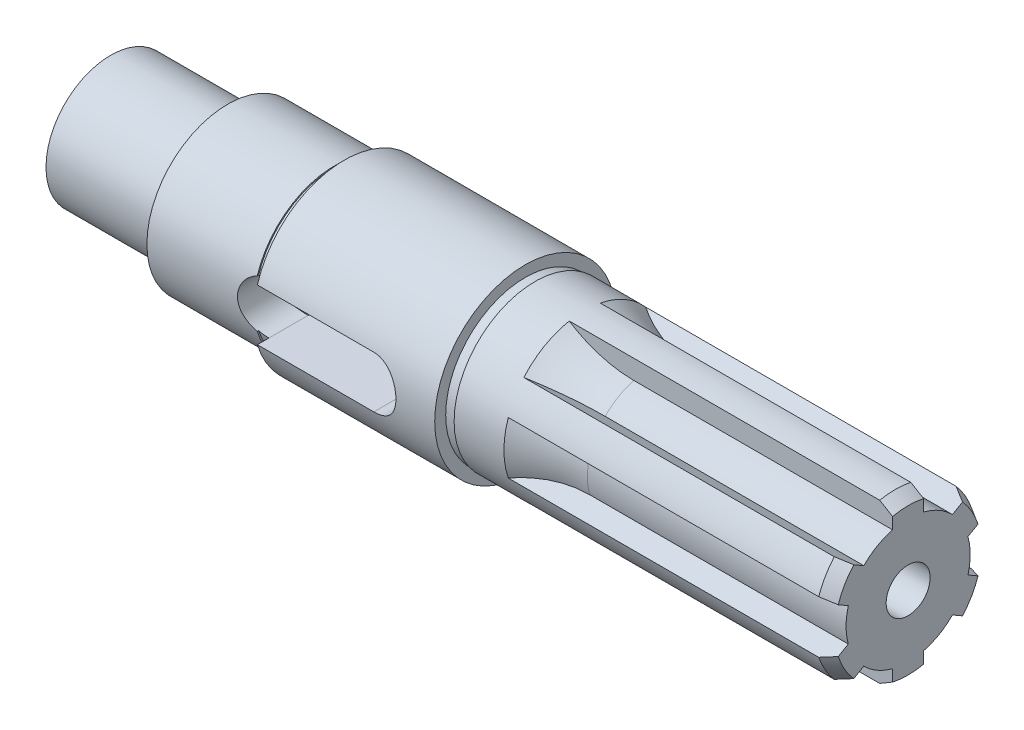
ISO-10303-21;
HEADER;
FILE_DESCRIPTION(('STEP AP214'),'2;1');
FILE_NAME('part.step','',(''),(''),'','','');
FILE_SCHEMA(('AUTOMOTIVE_DESIGN { 1 0 10303 214 1 1 1 1 }'));
ENDSEC;
DATA;
#1=APPLICATION_CONTEXT('core data for automotive mechanical design processes');
#2=APPLICATION_PROTOCOL_DEFINITION('international standard','automotive_design',2000,#1);
#3=PRODUCT_CONTEXT('',#1,'mechanical');
#4=PRODUCT('Part','Part','',(#3));
#5=PRODUCT_RELATED_PRODUCT_CATEGORY('part','',(#4));
#6=PRODUCT_DEFINITION_FORMATION('','',#4);
#7=PRODUCT_DEFINITION_CONTEXT('part definition',#1,'design');
#8=PRODUCT_DEFINITION('design','',#6,#7);
#9=PRODUCT_DEFINITION_SHAPE('','',#8);
#10=(LENGTH_UNIT() NAMED_UNIT(*) SI_UNIT(.MILLI.,.METRE.));
#11=(NAMED_UNIT(*) PLANE_ANGLE_UNIT() SI_UNIT($,.RADIAN.));
#12=(NAMED_UNIT(*) SI_UNIT($,.STERADIAN.) SOLID_ANGLE_UNIT());
#13=UNCERTAINTY_MEASURE_WITH_UNIT(LENGTH_MEASURE(1.E-05),#10,'distance_accuracy_value','');
#14=(GEOMETRIC_REPRESENTATION_CONTEXT(3) GLOBAL_UNCERTAINTY_ASSIGNED_CONTEXT((#13)) GLOBAL_UNIT_ASSIGNED_CONTEXT((#10,
#11,#12)) REPRESENTATION_CONTEXT('',''));
#15=CARTESIAN_POINT('',(0.,0.,0.));
#16=DIRECTION('',(0.,0.,1.));
#17=DIRECTION('',(1.,0.,0.));
#18=AXIS2_PLACEMENT_3D('',#15,#16,#17);
#19=CARTESIAN_POINT('',(0.,0.,0.));
#20=DIRECTION('',(-1.,0.,0.));
#21=DIRECTION('',(0.,0.,1.));
#22=AXIS2_PLACEMENT_3D('',#19,#20,#21);
#23=CYLINDRICAL_SURFACE('',#22,5.);
#24=CARTESIAN_POINT('',(74.,0.,0.));
#25=DIRECTION('',(-1.,0.,0.));
#26=DIRECTION('',(0.,0.,1.));
#27=AXIS2_PLACEMENT_3D('',#24,#25,#26);
#28=CIRCLE('',#27,5.);
#29=CARTESIAN_POINT('',(74.,0.,5.));
#30=VERTEX_POINT('',#29);
#31=EDGE_CURVE('E608',#30,#30,#28,.T.);
#32=ORIENTED_EDGE('',*,*,#31,.F.);
#33=EDGE_LOOP('',(#32));
#34=FACE_BOUND('',#33,.T.);
#35=CARTESIAN_POINT('',(36.1,0.,0.));
#36=DIRECTION('',(-1.,0.,0.));
#37=DIRECTION('',(0.,0.,1.));
#38=AXIS2_PLACEMENT_3D('',#35,#36,#37);
#39=CIRCLE('',#38,5.);
#40=CARTESIAN_POINT('',(36.1,-4.00000000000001,2.99999999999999));
#41=VERTEX_POINT('',#40);
#42=CARTESIAN_POINT('',(36.1,-4.00000000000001,-2.99999999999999));
#43=VERTEX_POINT('',#42);
#44=EDGE_CURVE('E368',#41,#43,#39,.F.);
#45=ORIENTED_EDGE('',*,*,#44,.F.);
#46=DIRECTION('',(-1.,0.,0.));
#47=VECTOR('',#46,1.);
#48=CARTESIAN_POINT('',(0.,-4.00000000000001,2.99999999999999));
#49=LINE('',#48,#47);
#50=CARTESIAN_POINT('',(54.1,-4.00000000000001,2.99999999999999));
#51=VERTEX_POINT('',#50);
#52=EDGE_CURVE('E406',#41,#51,#49,.F.);
#53=ORIENTED_EDGE('',*,*,#52,.T.);
#54=CARTESIAN_POINT('',(54.1,-4.00000000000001,2.99999999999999));
#55=CARTESIAN_POINT('',(54.175883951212,-4.00001724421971,2.99995182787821));
#56=CARTESIAN_POINT('',(54.2517370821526,-3.99784133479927,3.00287794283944));
#57=CARTESIAN_POINT('',(54.4026551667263,-3.98924372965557,3.01430346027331));
#58=CARTESIAN_POINT('',(54.4777212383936,-3.98282923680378,3.02279340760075));
#59=CARTESIAN_POINT('',(54.6256097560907,-3.96600676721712,3.04482610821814));
#60=CARTESIAN_POINT('',(54.6984487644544,-3.95565304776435,3.05830014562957));
#61=CARTESIAN_POINT('',(54.8425140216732,-3.93115992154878,3.08972240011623));
#62=CARTESIAN_POINT('',(54.9137394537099,-3.91701864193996,3.10767283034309));
#63=CARTESIAN_POINT('',(55.1746546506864,-3.85788645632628,3.18142036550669));
#64=CARTESIAN_POINT('',(55.358492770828,-3.80151495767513,3.24941719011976));
#65=CARTESIAN_POINT('',(55.6226873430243,-3.70006231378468,3.36335898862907));
#66=CARTESIAN_POINT('',(55.7091546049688,-3.66324320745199,3.40351971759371));
#67=CARTESIAN_POINT('',(55.8782087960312,-3.5842231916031,3.48663491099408));
#68=CARTESIAN_POINT('',(55.9607970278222,-3.54202410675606,3.52958842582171));
#69=CARTESIAN_POINT('',(56.1511450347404,-3.43635816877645,3.63300092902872));
#70=CARTESIAN_POINT('',(56.2572823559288,-3.37069881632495,3.6942026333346));
#71=CARTESIAN_POINT('',(56.4625817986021,-3.23012143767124,3.81773266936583));
#72=CARTESIAN_POINT('',(56.5617414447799,-3.15520015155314,3.88006139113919));
#73=CARTESIAN_POINT('',(56.752716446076,-2.9964110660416,4.00395278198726));
#74=CARTESIAN_POINT('',(56.8445467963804,-2.91256239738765,4.06551678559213));
#75=CARTESIAN_POINT('',(57.0207035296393,-2.73588329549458,4.18645638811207));
#76=CARTESIAN_POINT('',(57.1050289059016,-2.64305166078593,4.24583169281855));
#77=CARTESIAN_POINT('',(57.3141519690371,-2.3896017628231,4.3957561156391));
#78=CARTESIAN_POINT('',(57.4326182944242,-2.22191651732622,4.48346431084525));
#79=CARTESIAN_POINT('',(57.6447266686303,-1.8649070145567,4.64330256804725));
#80=CARTESIAN_POINT('',(57.7384027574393,-1.67561294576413,4.71545396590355));
#81=CARTESIAN_POINT('',(57.8834242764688,-1.31063563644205,4.82831089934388));
#82=CARTESIAN_POINT('',(57.9391659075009,-1.13770363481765,4.87221514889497));
#83=CARTESIAN_POINT('',(58.0269989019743,-0.782370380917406,4.94171963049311));
#84=CARTESIAN_POINT('',(58.0591038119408,-0.599974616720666,4.96733034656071));
#85=CARTESIAN_POINT('',(58.0977160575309,-0.230096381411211,4.99815922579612));
#86=CARTESIAN_POINT('',(58.1041343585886,-0.0425984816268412,5.00330645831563));
#87=CARTESIAN_POINT('',(58.0906714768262,0.330833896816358,4.99253869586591));
#88=CARTESIAN_POINT('',(58.070789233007,0.516768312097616,4.97662285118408));
#89=CARTESIAN_POINT('',(58.0078646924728,0.871363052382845,4.92656782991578));
#90=CARTESIAN_POINT('',(57.9661441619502,1.04041248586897,4.89346948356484));
#91=CARTESIAN_POINT('',(57.862612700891,1.36833589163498,4.81209238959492));
#92=CARTESIAN_POINT('',(57.8007957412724,1.527206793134,4.76380908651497));
#93=CARTESIAN_POINT('',(57.6527884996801,1.84707554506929,4.64971647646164));
#94=CARTESIAN_POINT('',(57.5648226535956,2.00680104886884,4.58266606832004));
#95=CARTESIAN_POINT('',(57.3709020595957,2.30944878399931,4.43786536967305));
#96=CARTESIAN_POINT('',(57.2649415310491,2.45236559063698,4.360111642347));
#97=CARTESIAN_POINT('',(57.0139396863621,2.74845365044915,4.18111155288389));
#98=CARTESIAN_POINT('',(56.8653422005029,2.89769469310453,4.07832137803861));
#99=CARTESIAN_POINT('',(56.6271862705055,3.10230804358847,3.9221298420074));
#100=CARTESIAN_POINT('',(56.5451250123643,3.16738635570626,3.86965254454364));
#101=CARTESIAN_POINT('',(56.3760025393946,3.29101550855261,3.76507373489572));
#102=CARTESIAN_POINT('',(56.2889411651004,3.3495661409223,3.71297223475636));
#103=CARTESIAN_POINT('',(56.0372263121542,3.50477834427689,3.56862015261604));
#104=CARTESIAN_POINT('',(55.8667946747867,3.59393900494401,3.47799806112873));
#105=CARTESIAN_POINT('',(55.5992332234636,3.70966941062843,3.35285010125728));
#106=CARTESIAN_POINT('',(55.5083385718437,3.74516801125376,3.3130307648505));
#107=CARTESIAN_POINT('',(55.3223380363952,3.80993229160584,3.23834004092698));
#108=CARTESIAN_POINT('',(55.2272327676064,3.83919887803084,3.20346793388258));
#109=CARTESIAN_POINT('',(55.0493456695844,3.88660905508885,3.14570017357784));
#110=CARTESIAN_POINT('',(54.9671770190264,3.90579524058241,3.12177671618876));
#111=CARTESIAN_POINT('',(54.8004270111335,3.93911505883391,3.07962493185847));
#112=CARTESIAN_POINT('',(54.715847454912,3.95325236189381,3.06139246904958));
#113=CARTESIAN_POINT('',(54.5434091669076,3.97631108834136,3.0313921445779));
#114=CARTESIAN_POINT('',(54.4555196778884,3.98514599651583,3.01973169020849));
#115=CARTESIAN_POINT('',(54.2784432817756,3.9970143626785,3.00398108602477));
#116=CARTESIAN_POINT('',(54.1892534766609,4.00003183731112,2.99991179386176));
#117=CARTESIAN_POINT('',(54.0999999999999,4.00000000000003,3.00000000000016));
#118=B_SPLINE_CURVE_WITH_KNOTS('',3,(#54,#55,#56,#57,#58,#59,#60,#61,#62,#63,#64,#65,#66,#67,
#68,#69,#70,#71,#72,#73,#74,#75,#76,#77,#78,#79,#80,#81,#82,#83,#84,#85,#86,#87,#88,#89,#90,#91,
#92,#93,#94,#95,#96,#97,#98,#99,#100,#101,#102,#103,#104,#105,#106,#107,#108,#109,#110,#111,
#112,#113,#114,#115,#116,#117),.UNSPECIFIED.,.F.,.F.,(4,2,2,2,2,2,2,2,2,2,2,2,2,2,2,2,2,2,2,2,2,
2,2,2,2,2,2,2,2,2,2,4),(0.,0.227514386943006,0.4546431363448,0.678750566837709,
0.902969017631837,1.51087923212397,1.81735094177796,2.12371898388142,2.54020752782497,
2.95684308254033,3.37260313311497,3.78841886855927,4.45547797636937,5.12161632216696,
5.68000290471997,6.23806921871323,6.79806822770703,7.35808982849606,7.88757946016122,
8.41722808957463,8.99795349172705,9.57886580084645,10.2791805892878,10.6303779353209,
10.9815864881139,11.6169995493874,11.9328954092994,12.248745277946,12.5115441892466,
12.774151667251,13.0409350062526,13.3084502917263),.UNSPECIFIED.);
#119=CARTESIAN_POINT('',(54.1,4.00000000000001,2.99999999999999));
#120=VERTEX_POINT('',#119);
#121=EDGE_CURVE('E475',#51,#120,#118,.T.);
#122=ORIENTED_EDGE('',*,*,#121,.T.);
#123=DIRECTION('',(-1.,0.,0.));
#124=VECTOR('',#123,1.);
#125=CARTESIAN_POINT('',(0.,4.00000000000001,2.99999999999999));
#126=LINE('',#125,#124);
#127=CARTESIAN_POINT('',(36.1,4.00000000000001,2.99999999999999));
#128=VERTEX_POINT('',#127);
#129=EDGE_CURVE('E1371',#120,#128,#126,.T.);
#130=ORIENTED_EDGE('',*,*,#129,.T.);
#131=CARTESIAN_POINT('',(36.1,4.00000000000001,-2.99999999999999));
#132=VERTEX_POINT('',#131);
#133=EDGE_CURVE('E343',#132,#128,#39,.F.);
#134=ORIENTED_EDGE('',*,*,#133,.F.);
#135=DIRECTION('',(-1.,0.,0.));
#136=VECTOR('',#135,1.);
#137=CARTESIAN_POINT('',(0.,4.00000000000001,-2.99999999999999));
#138=LINE('',#137,#136);
#139=CARTESIAN_POINT('',(54.1,4.00000000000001,-2.99999999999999));
#140=VERTEX_POINT('',#139);
#141=EDGE_CURVE('E1370',#132,#140,#138,.F.);
#142=ORIENTED_EDGE('',*,*,#141,.T.);
#143=CARTESIAN_POINT('',(54.1,4.00000000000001,-2.99999999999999));
#144=CARTESIAN_POINT('',(54.175883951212,4.00001724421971,-2.99995182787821));
#145=CARTESIAN_POINT('',(54.2517370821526,3.99784133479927,-3.00287794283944));
#146=CARTESIAN_POINT('',(54.4026551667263,3.98924372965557,-3.01430346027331));
#147=CARTESIAN_POINT('',(54.4777212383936,3.98282923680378,-3.02279340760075));
#148=CARTESIAN_POINT('',(54.6256097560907,3.96600676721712,-3.04482610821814));
#149=CARTESIAN_POINT('',(54.6984487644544,3.95565304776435,-3.05830014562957));
#150=CARTESIAN_POINT('',(54.8425140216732,3.93115992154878,-3.08972240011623));
#151=CARTESIAN_POINT('',(54.9137394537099,3.91701864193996,-3.10767283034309));
#152=CARTESIAN_POINT('',(55.1746546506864,3.85788645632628,-3.18142036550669));
#153=CARTESIAN_POINT('',(55.358492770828,3.80151495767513,-3.24941719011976));
#154=CARTESIAN_POINT('',(55.6226873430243,3.70006231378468,-3.36335898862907));
#155=CARTESIAN_POINT('',(55.7091546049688,3.66324320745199,-3.40351971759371));
#156=CARTESIAN_POINT('',(55.8782087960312,3.5842231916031,-3.48663491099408));
#157=CARTESIAN_POINT('',(55.9607970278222,3.54202410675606,-3.52958842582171));
#158=CARTESIAN_POINT('',(56.1511450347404,3.43635816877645,-3.63300092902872));
#159=CARTESIAN_POINT('',(56.2572823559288,3.37069881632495,-3.6942026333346));
#160=CARTESIAN_POINT('',(56.4625817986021,3.23012143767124,-3.81773266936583));
#161=CARTESIAN_POINT('',(56.5617414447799,3.15520015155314,-3.88006139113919));
#162=CARTESIAN_POINT('',(56.752716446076,2.9964110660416,-4.00395278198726));
#163=CARTESIAN_POINT('',(56.8445467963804,2.91256239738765,-4.06551678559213));
#164=CARTESIAN_POINT('',(57.0207035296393,2.73588329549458,-4.18645638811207));
#165=CARTESIAN_POINT('',(57.1050289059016,2.64305166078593,-4.24583169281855));
#166=CARTESIAN_POINT('',(57.3141519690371,2.3896017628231,-4.3957561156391));
#167=CARTESIAN_POINT('',(57.4326182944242,2.22191651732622,-4.48346431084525));
#168=CARTESIAN_POINT('',(57.6447266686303,1.8649070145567,-4.64330256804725));
#169=CARTESIAN_POINT('',(57.7384027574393,1.67561294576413,-4.71545396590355));
#170=CARTESIAN_POINT('',(57.8834242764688,1.31063563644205,-4.82831089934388));
#171=CARTESIAN_POINT('',(57.9391659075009,1.13770363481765,-4.87221514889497));
#172=CARTESIAN_POINT('',(58.0269989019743,0.782370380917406,-4.94171963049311));
#173=CARTESIAN_POINT('',(58.0591038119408,0.599974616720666,-4.96733034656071));
#174=CARTESIAN_POINT('',(58.0977160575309,0.230096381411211,-4.99815922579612));
#175=CARTESIAN_POINT('',(58.1041343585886,0.0425984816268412,-5.00330645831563));
#176=CARTESIAN_POINT('',(58.0906714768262,-0.330833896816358,-4.99253869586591));
#177=CARTESIAN_POINT('',(58.070789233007,-0.516768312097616,-4.97662285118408));
#178=CARTESIAN_POINT('',(58.0078646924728,-0.871363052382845,-4.92656782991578));
#179=CARTESIAN_POINT('',(57.9661441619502,-1.04041248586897,-4.89346948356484));
#180=CARTESIAN_POINT('',(57.862612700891,-1.36833589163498,-4.81209238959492));
#181=CARTESIAN_POINT('',(57.8007957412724,-1.527206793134,-4.76380908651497));
#182=CARTESIAN_POINT('',(57.6527884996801,-1.84707554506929,-4.64971647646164));
#183=CARTESIAN_POINT('',(57.5648226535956,-2.00680104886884,-4.58266606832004));
#184=CARTESIAN_POINT('',(57.3709020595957,-2.30944878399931,-4.43786536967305));
#185=CARTESIAN_POINT('',(57.2649415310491,-2.45236559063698,-4.360111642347));
#186=CARTESIAN_POINT('',(57.0139396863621,-2.74845365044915,-4.18111155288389));
#187=CARTESIAN_POINT('',(56.8653422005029,-2.89769469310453,-4.07832137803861));
#188=CARTESIAN_POINT('',(56.6271862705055,-3.10230804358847,-3.9221298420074));
#189=CARTESIAN_POINT('',(56.5451250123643,-3.16738635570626,-3.86965254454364));
#190=CARTESIAN_POINT('',(56.3760025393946,-3.29101550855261,-3.76507373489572));
#191=CARTESIAN_POINT('',(56.2889411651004,-3.3495661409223,-3.71297223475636));
#192=CARTESIAN_POINT('',(56.0372263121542,-3.50477834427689,-3.56862015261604));
#193=CARTESIAN_POINT('',(55.8667946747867,-3.59393900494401,-3.47799806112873));
#194=CARTESIAN_POINT('',(55.5992332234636,-3.70966941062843,-3.35285010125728));
#195=CARTESIAN_POINT('',(55.5083385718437,-3.74516801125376,-3.3130307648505));
#196=CARTESIAN_POINT('',(55.3223380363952,-3.80993229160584,-3.23834004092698));
#197=CARTESIAN_POINT('',(55.2272327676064,-3.83919887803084,-3.20346793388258));
#198=CARTESIAN_POINT('',(55.0493456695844,-3.88660905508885,-3.14570017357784));
#199=CARTESIAN_POINT('',(54.9671770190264,-3.90579524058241,-3.12177671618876));
#200=CARTESIAN_POINT('',(54.8004270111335,-3.93911505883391,-3.07962493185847));
#201=CARTESIAN_POINT('',(54.715847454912,-3.95325236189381,-3.06139246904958));
#202=CARTESIAN_POINT('',(54.5434091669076,-3.97631108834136,-3.0313921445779));
#203=CARTESIAN_POINT('',(54.4555196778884,-3.98514599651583,-3.01973169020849));
#204=CARTESIAN_POINT('',(54.2784432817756,-3.9970143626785,-3.00398108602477));
#205=CARTESIAN_POINT('',(54.1892534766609,-4.00003183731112,-2.99991179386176));
#206=CARTESIAN_POINT('',(54.0999999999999,-4.00000000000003,-3.00000000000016));
#207=B_SPLINE_CURVE_WITH_KNOTS('',3,(#143,#144,#145,#146,#147,#148,#149,#150,#151,#152,#153,
#154,#155,#156,#157,#158,#159,#160,#161,#162,#163,#164,#165,#166,#167,#168,#169,#170,#171,#172,
#173,#174,#175,#176,#177,#178,#179,#180,#181,#182,#183,#184,#185,#186,#187,#188,#189,#190,#191,
#192,#193,#194,#195,#196,#197,#198,#199,#200,#201,#202,#203,#204,#205,#206),.UNSPECIFIED.,.F.,
.F.,(4,2,2,2,2,2,2,2,2,2,2,2,2,2,2,2,2,2,2,2,2,2,2,2,2,2,2,2,2,2,2,4),(0.,0.227514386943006,
0.4546431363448,0.678750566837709,0.902969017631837,1.51087923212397,1.81735094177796,
2.12371898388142,2.54020752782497,2.95684308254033,3.37260313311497,3.78841886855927,
4.45547797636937,5.12161632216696,5.68000290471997,6.23806921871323,6.79806822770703,
7.35808982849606,7.88757946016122,8.41722808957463,8.99795349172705,9.57886580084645,
10.2791805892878,10.6303779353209,10.9815864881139,11.6169995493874,11.9328954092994,
12.248745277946,12.5115441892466,12.774151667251,13.0409350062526,13.3084502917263),.UNSPECIFIED.);
#208=CARTESIAN_POINT('',(54.1,-4.00000000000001,-2.99999999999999));
#209=VERTEX_POINT('',#208);
#210=EDGE_CURVE('E481',#140,#209,#207,.T.);
#211=ORIENTED_EDGE('',*,*,#210,.T.);
#212=DIRECTION('',(-1.,0.,0.));
#213=VECTOR('',#212,1.);
#214=CARTESIAN_POINT('',(0.,-4.00000000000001,-2.99999999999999));
#215=LINE('',#214,#213);
#216=EDGE_CURVE('E414',#209,#43,#215,.T.);
#217=ORIENTED_EDGE('',*,*,#216,.T.);
#218=EDGE_LOOP('',(#45,#53,#122,#130,#134,#142,#211,#217));
#219=FACE_BOUND('',#218,.T.);
#220=ADVANCED_FACE('F36',(#34,#219),#23,.F.);
#221=CARTESIAN_POINT('',(34.6,12.5,0.));
#222=DIRECTION('',(-1.,0.,0.));
#223=DIRECTION('',(0.,0.,1.));
#224=AXIS2_PLACEMENT_3D('',#221,#222,#223);
#225=PLANE('',#224);
#226=CARTESIAN_POINT('',(34.6,0.,0.));
#227=DIRECTION('',(-1.,0.,0.));
#228=DIRECTION('',(0.,0.,1.));
#229=AXIS2_PLACEMENT_3D('',#226,#227,#228);
#230=CIRCLE('',#229,12.5);
#231=CARTESIAN_POINT('',(34.6,-3.70809924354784,-11.9373363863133));
#232=VERTEX_POINT('',#231);
#233=CARTESIAN_POINT('',(34.6,-3.70809924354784,11.9373363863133));
#234=VERTEX_POINT('',#233);
#235=EDGE_CURVE('E585',#232,#234,#230,.T.);
#236=ORIENTED_EDGE('',*,*,#235,.F.);
#237=DIRECTION('',(0.,0.,1.));
#238=VECTOR('',#237,1.);
#239=CARTESIAN_POINT('',(34.6,-3.70809924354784,-23.5));
#240=LINE('',#239,#238);
#241=CARTESIAN_POINT('',(34.6,-3.70809924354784,-11.7277448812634));
#242=VERTEX_POINT('',#241);
#243=EDGE_CURVE('E550',#232,#242,#240,.T.);
#244=ORIENTED_EDGE('',*,*,#243,.T.);
#245=CARTESIAN_POINT('',(34.6,0.,0.));
#246=DIRECTION('',(-1.,0.,0.));
#247=DIRECTION('',(0.,0.,1.));
#248=AXIS2_PLACEMENT_3D('',#245,#246,#247);
#249=CIRCLE('',#248,12.3);
#250=CARTESIAN_POINT('',(34.6,-3.70809924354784,11.7277448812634));
#251=VERTEX_POINT('',#250);
#252=EDGE_CURVE('E584',#242,#251,#249,.T.);
#253=ORIENTED_EDGE('',*,*,#252,.T.);
#254=EDGE_CURVE('E575',#251,#234,#240,.T.);
#255=ORIENTED_EDGE('',*,*,#254,.T.);
#256=EDGE_LOOP('',(#236,#244,#253,#255));
#257=FACE_BOUND('',#256,.T.);
#258=ADVANCED_FACE('F455',(#257),#225,.F.);
#259=CARTESIAN_POINT('',(0.,0.,0.));
#260=DIRECTION('',(-1.,0.,0.));
#261=DIRECTION('',(0.,0.,1.));
#262=AXIS2_PLACEMENT_3D('',#259,#260,#261);
#263=CYLINDRICAL_SURFACE('',#262,12.3);
#264=CARTESIAN_POINT('',(36.1,0.,0.));
#265=DIRECTION('',(-1.,0.,0.));
#266=DIRECTION('',(0.,0.,1.));
#267=AXIS2_PLACEMENT_3D('',#264,#265,#266);
#268=CIRCLE('',#267,12.3);
#269=CARTESIAN_POINT('',(36.1,4.00000000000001,11.6314229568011));
#270=VERTEX_POINT('',#269);
#271=CARTESIAN_POINT('',(36.1,4.00000000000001,-11.6314229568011));
#272=VERTEX_POINT('',#271);
#273=EDGE_CURVE('E589',#270,#272,#268,.T.);
#274=ORIENTED_EDGE('',*,*,#273,.T.);
#275=CARTESIAN_POINT('',(36.1,4.00000000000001,-11.6314229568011));
#276=CARTESIAN_POINT('',(35.9911158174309,4.00001573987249,-11.6314056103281));
#277=CARTESIAN_POINT('',(35.8822353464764,3.99555494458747,-11.6329512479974));
#278=CARTESIAN_POINT('',(35.6652391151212,3.97778879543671,-11.6390445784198));
#279=CARTESIAN_POINT('',(35.5571236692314,3.9644799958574,-11.6435934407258));
#280=CARTESIAN_POINT('',(35.3442597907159,3.92941624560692,-11.6554709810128));
#281=CARTESIAN_POINT('',(35.239485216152,3.90780330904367,-11.6627528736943));
#282=CARTESIAN_POINT('',(35.0322526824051,3.8563325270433,-11.6798732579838));
#283=CARTESIAN_POINT('',(34.9297932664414,3.82648003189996,-11.6897100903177));
#284=CARTESIAN_POINT('',(34.790297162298,3.77972646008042,-11.7048643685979));
#285=CARTESIAN_POINT('',(34.7519844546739,3.7662319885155,-11.7092149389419));
#286=CARTESIAN_POINT('',(34.6756985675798,3.73805069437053,-11.7182420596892));
#287=CARTESIAN_POINT('',(34.6377268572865,3.72336021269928,-11.7229196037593));
#288=CARTESIAN_POINT('',(34.6,3.70809924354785,-11.7277448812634));
#289=B_SPLINE_CURVE_WITH_KNOTS('',3,(#275,#276,#277,#278,#279,#280,#281,#282,#283,#284,#285,
#286,#287,#288),.UNSPECIFIED.,.F.,.F.,(4,2,2,2,2,2,4),(0.,0.326545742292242,0.653218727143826,
0.974537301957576,1.29564771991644,1.41818862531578,1.54111964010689),.UNSPECIFIED.);
#290=CARTESIAN_POINT('',(34.6,3.70809924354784,-11.7277448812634));
#291=VERTEX_POINT('',#290);
#292=EDGE_CURVE('E557',#272,#291,#289,.T.);
#293=ORIENTED_EDGE('',*,*,#292,.T.);
#294=CARTESIAN_POINT('',(34.6,3.70809924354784,11.7277448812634));
#295=VERTEX_POINT('',#294);
#296=EDGE_CURVE('E588',#295,#291,#249,.T.);
#297=ORIENTED_EDGE('',*,*,#296,.F.);
#298=CARTESIAN_POINT('',(34.6,3.70809924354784,11.7277448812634));
#299=CARTESIAN_POINT('',(34.7002108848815,3.74865049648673,11.7149150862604));
#300=CARTESIAN_POINT('',(34.8022025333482,3.78516730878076,11.7031454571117));
#301=CARTESIAN_POINT('',(35.00911976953,3.84989777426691,11.6820161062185));
#302=CARTESIAN_POINT('',(35.1140476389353,3.87810476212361,11.6726583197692));
#303=CARTESIAN_POINT('',(35.3242672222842,3.92551417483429,11.65679799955));
#304=CARTESIAN_POINT('',(35.4295232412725,3.94485984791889,11.6502501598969));
#305=CARTESIAN_POINT('',(35.6413186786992,3.9750518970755,11.6399838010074));
#306=CARTESIAN_POINT('',(35.7478570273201,3.98590491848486,11.6362630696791));
#307=CARTESIAN_POINT('',(35.8954273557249,3.99497447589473,11.6331501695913));
#308=CARTESIAN_POINT('',(35.9362354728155,3.99685512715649,11.6325040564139));
#309=CARTESIAN_POINT('',(36.0180273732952,3.99936981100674,11.6316397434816));
#310=CARTESIAN_POINT('',(36.0590112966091,3.99999977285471,11.6314229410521));
#311=CARTESIAN_POINT('',(36.1,4.00000000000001,11.6314229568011));
#312=B_SPLINE_CURVE_WITH_KNOTS('',3,(#298,#299,#300,#301,#302,#303,#304,#305,#306,#307,#308,
#309,#310,#311),.UNSPECIFIED.,.F.,.F.,(4,2,2,2,2,2,4),(0.,0.326515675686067,0.653292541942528,
0.974582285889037,1.29562037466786,1.41817329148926,1.54112444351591),.UNSPECIFIED.);
#313=EDGE_CURVE('E486',#295,#270,#312,.T.);
#314=ORIENTED_EDGE('',*,*,#313,.T.);
#315=EDGE_LOOP('',(#274,#293,#297,#314));
#316=FACE_BOUND('',#315,.T.);
#317=ADVANCED_FACE('F461',(#316),#263,.T.);
#318=CARTESIAN_POINT('',(36.1,12.3,0.));
#319=DIRECTION('',(1.,0.,0.));
#320=DIRECTION('',(0.,0.,-1.));
#321=AXIS2_PLACEMENT_3D('',#318,#319,#320);
#322=PLANE('',#321);
#323=CARTESIAN_POINT('',(36.1,0.,0.));
#324=DIRECTION('',(-1.,0.,0.));
#325=DIRECTION('',(0.,0.,1.));
#326=AXIS2_PLACEMENT_3D('',#323,#324,#325);
#327=CIRCLE('',#326,14.);
#328=CARTESIAN_POINT('',(36.1,-4.00000000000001,-13.4164078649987));
#329=VERTEX_POINT('',#328);
#330=CARTESIAN_POINT('',(36.1,-4.00000000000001,13.4164078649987));
#331=VERTEX_POINT('',#330);
#332=EDGE_CURVE('E746',#329,#331,#327,.T.);
#333=ORIENTED_EDGE('',*,*,#332,.T.);
#334=DIRECTION('',(0.,0.,1.));
#335=VECTOR('',#334,1.);
#336=CARTESIAN_POINT('',(36.1,-4.00000000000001,-23.5));
#337=LINE('',#336,#335);
#338=CARTESIAN_POINT('',(36.1,-4.00000000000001,11.6314229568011));
#339=VERTEX_POINT('',#338);
#340=EDGE_CURVE('E381',#339,#331,#337,.T.);
#341=ORIENTED_EDGE('',*,*,#340,.F.);
#342=CARTESIAN_POINT('',(36.1,-4.00000000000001,-11.6314229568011));
#343=VERTEX_POINT('',#342);
#344=EDGE_CURVE('E592',#343,#339,#268,.T.);
#345=ORIENTED_EDGE('',*,*,#344,.F.);
#346=EDGE_CURVE('E386',#329,#343,#337,.T.);
#347=ORIENTED_EDGE('',*,*,#346,.F.);
#348=EDGE_LOOP('',(#333,#341,#345,#347));
#349=FACE_BOUND('',#348,.T.);
#350=ADVANCED_FACE('F529',(#349),#322,.F.);
#351=CARTESIAN_POINT('',(83.3,0.,0.));
#352=DIRECTION('',(-1.,0.,0.));
#353=DIRECTION('',(0.,0.,1.));
#354=AXIS2_PLACEMENT_3D('',#351,#352,#353);
#355=TOROIDAL_SURFACE('',#354,28.2913793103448,18.6913793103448);
#356=CARTESIAN_POINT('',(83.3002,-6.72604098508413,6.84984471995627));
#357=CARTESIAN_POINT('',(83.0412632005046,-6.72603900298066,6.84984128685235));
#358=CARTESIAN_POINT('',(82.7823598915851,-6.72881725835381,6.85465336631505));
#359=CARTESIAN_POINT('',(82.2650307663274,-6.73992070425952,6.87388509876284));
#360=CARTESIAN_POINT('',(82.0066049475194,-6.74824586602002,6.88830470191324));
#361=CARTESIAN_POINT('',(81.2327799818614,-6.78151609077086,6.94593042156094));
#362=CARTESIAN_POINT('',(80.7187079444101,-6.81475590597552,7.0035034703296));
#363=CARTESIAN_POINT('',(79.7099867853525,-6.90196210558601,7.15454903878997));
#364=CARTESIAN_POINT('',(79.2151634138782,-6.95543142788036,7.24716062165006));
#365=CARTESIAN_POINT('',(78.2360851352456,-7.08259125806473,7.46740790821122));
#366=CARTESIAN_POINT('',(77.7518279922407,-7.15627744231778,7.59503612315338));
#367=CARTESIAN_POINT('',(76.9284927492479,-7.30020727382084,7.84432990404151));
#368=CARTESIAN_POINT('',(76.5861373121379,-7.36581746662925,7.95797009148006));
#369=CARTESIAN_POINT('',(75.909787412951,-7.50700317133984,8.20251090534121));
#370=CARTESIAN_POINT('',(75.5757917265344,-7.58257721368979,8.33340898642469));
#371=CARTESIAN_POINT('',(74.9116308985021,-7.74475149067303,8.61430307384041));
#372=CARTESIAN_POINT('',(74.5816278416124,-7.83151757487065,8.76458634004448));
#373=CARTESIAN_POINT('',(73.9323488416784,-8.01472071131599,9.08190348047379));
#374=CARTESIAN_POINT('',(73.6130776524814,-8.11116197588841,9.2489446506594));
#375=CARTESIAN_POINT('',(73.2998,-8.21224378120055,9.42402347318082));
#376=B_SPLINE_CURVE_WITH_KNOTS('',3,(#356,#357,#358,#359,#360,#361,#362,#363,#364,#365,#366,
#367,#368,#369,#370,#371,#372,#373,#374,#375),.UNSPECIFIED.,.F.,.F.,(4,2,2,2,2,2,2,2,2,4),(0.,
0.776683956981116,1.55336388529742,3.10634884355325,4.62342209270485,6.14017114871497,
7.23950209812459,8.33867108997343,9.45655783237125,10.5749334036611),.UNSPECIFIED.);
#377=CARTESIAN_POINT('',(83.3,-6.72604098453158,6.84984471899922));
#378=VERTEX_POINT('',#377);
#379=CARTESIAN_POINT('',(73.3,-8.21217925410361,9.42391170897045));
#380=VERTEX_POINT('',#379);
#381=EDGE_CURVE('E824',#378,#380,#376,.T.);
#382=ORIENTED_EDGE('',*,*,#381,.T.);
#383=CARTESIAN_POINT('',(73.3,0.,0.));
#384=DIRECTION('',(-1.,0.,0.));
#385=DIRECTION('',(0.,0.,1.));
#386=AXIS2_PLACEMENT_3D('',#383,#384,#385);
#387=CIRCLE('',#386,12.5);
#388=CARTESIAN_POINT('',(73.3,-12.2674365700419,2.39999999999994));
#389=VERTEX_POINT('',#388);
#390=EDGE_CURVE('E1119',#389,#380,#387,.T.);
#391=ORIENTED_EDGE('',*,*,#390,.F.);
#392=CARTESIAN_POINT('',(74.8540966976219,-11.3663981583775,2.3999970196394));
#393=CARTESIAN_POINT('',(74.3823679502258,-11.6106077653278,2.3999972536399));
#394=CARTESIAN_POINT('',(73.9210152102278,-11.8748356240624,2.39999949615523));
#395=CARTESIAN_POINT('',(73.2469556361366,-12.2995624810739,2.40000025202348));
#396=CARTESIAN_POINT('',(73.0252213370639,-12.4459011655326,2.40000006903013));
#397=CARTESIAN_POINT('',(72.5880456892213,-12.7478124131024,2.39999993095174));
#398=CARTESIAN_POINT('',(72.3726059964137,-12.903387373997,2.39999997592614));
#399=CARTESIAN_POINT('',(71.7359186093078,-13.3838315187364,2.40000004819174));
#400=CARTESIAN_POINT('',(71.3247166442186,-13.7221589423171,2.40000001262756));
#401=CARTESIAN_POINT('',(70.5321284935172,-14.4320984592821,2.39999998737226));
#402=CARTESIAN_POINT('',(70.1507424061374,-14.8037106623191,2.39999999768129));
#403=CARTESIAN_POINT('',(69.6027935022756,-15.3843121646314,2.4000000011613));
#404=CARTESIAN_POINT('',(69.4240178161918,-15.5818953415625,2.40000000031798));
#405=CARTESIAN_POINT('',(69.0749602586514,-15.9843366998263,2.39999999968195));
#406=CARTESIAN_POINT('',(68.9046762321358,-16.1891930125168,2.39999999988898));
#407=CARTESIAN_POINT('',(68.4069190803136,-16.814263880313,2.40000000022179));
#408=CARTESIAN_POINT('',(68.0925137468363,-17.2450091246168,2.40000000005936));
#409=CARTESIAN_POINT('',(67.501112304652,-18.1311729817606,2.39999999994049));
#410=CARTESIAN_POINT('',(67.2241039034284,-18.5865834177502,2.39999999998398));
#411=CARTESIAN_POINT('',(66.7093229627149,-19.519084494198,2.40000000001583));
#412=CARTESIAN_POINT('',(66.4715502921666,-19.9961750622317,2.40000000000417));
#413=CARTESIAN_POINT('',(66.036198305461,-20.9704633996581,2.39999999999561));
#414=CARTESIAN_POINT('',(65.8387702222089,-21.4677287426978,2.39999999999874));
#415=CARTESIAN_POINT('',(65.4866858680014,-22.4771833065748,2.40000000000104));
#416=CARTESIAN_POINT('',(65.3320297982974,-22.9893725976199,2.40000000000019));
#417=CARTESIAN_POINT('',(65.0666634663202,-24.0250405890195,2.39999999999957));
#418=CARTESIAN_POINT('',(64.9559554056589,-24.5485198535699,2.39999999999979));
#419=CARTESIAN_POINT('',(64.7793606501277,-25.6029846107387,2.39999999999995));
#420=CARTESIAN_POINT('',(64.7134737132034,-26.1339700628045,2.39999999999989));
#421=CARTESIAN_POINT('',(64.62729733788,-27.1966843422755,2.39999999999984));
#422=CARTESIAN_POINT('',(64.6067588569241,-27.728392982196,2.39999999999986));
#423=CARTESIAN_POINT('',(64.6107474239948,-28.7916420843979,2.39999999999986));
#424=CARTESIAN_POINT('',(64.6352743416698,-29.3231825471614,2.39999999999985));
#425=CARTESIAN_POINT('',(64.7292683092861,-30.3822613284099,2.39999999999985));
#426=CARTESIAN_POINT('',(64.7987341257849,-30.9097997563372,2.39999999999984));
#427=CARTESIAN_POINT('',(64.9821513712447,-31.9570859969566,2.39999999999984));
#428=CARTESIAN_POINT('',(65.0961026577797,-32.4768338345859,2.39999999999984));
#429=CARTESIAN_POINT('',(65.366986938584,-33.5020479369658,2.39999999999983));
#430=CARTESIAN_POINT('',(65.5236882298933,-34.0075754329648,2.39999999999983));
#431=CARTESIAN_POINT('',(65.8792461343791,-35.0035816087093,2.39999999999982));
#432=CARTESIAN_POINT('',(66.0781026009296,-35.4940603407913,2.39999999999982));
#433=CARTESIAN_POINT('',(66.5165739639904,-36.4564386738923,2.39999999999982));
#434=CARTESIAN_POINT('',(66.7561881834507,-36.9283385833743,2.39999999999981));
#435=CARTESIAN_POINT('',(67.274485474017,-37.8501725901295,2.39999999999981));
#436=CARTESIAN_POINT('',(67.5531684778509,-38.3001067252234,2.39999999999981));
#437=CARTESIAN_POINT('',(68.1465637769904,-39.1732067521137,2.3999999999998));
#438=CARTESIAN_POINT('',(68.4611440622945,-39.5964623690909,2.3999999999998));
#439=CARTESIAN_POINT('',(69.1249038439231,-40.4149135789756,2.3999999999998));
#440=CARTESIAN_POINT('',(69.4740832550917,-40.8101092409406,2.39999999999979));
#441=CARTESIAN_POINT('',(70.2045599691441,-41.5696041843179,2.39999999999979));
#442=CARTESIAN_POINT('',(70.5858570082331,-41.933903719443,2.39999999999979));
#443=CARTESIAN_POINT('',(71.3778586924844,-42.6289955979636,2.39999999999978));
#444=CARTESIAN_POINT('',(71.7885633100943,-42.9597879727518,2.39999999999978));
#445=CARTESIAN_POINT('',(72.6355377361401,-43.5848148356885,2.39999999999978));
#446=CARTESIAN_POINT('',(73.0717505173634,-43.8791266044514,2.39999999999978));
#447=CARTESIAN_POINT('',(73.9674413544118,-44.4299159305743,2.39999999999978));
#448=CARTESIAN_POINT('',(74.4269193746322,-44.6863935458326,2.39999999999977));
#449=CARTESIAN_POINT('',(75.3658687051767,-45.1596772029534,2.39999999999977));
#450=CARTESIAN_POINT('',(75.845339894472,-45.3764834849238,2.39999999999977));
#451=CARTESIAN_POINT('',(76.8208635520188,-45.768873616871,2.39999999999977));
#452=CARTESIAN_POINT('',(77.3169160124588,-45.9444574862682,2.39999999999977));
#453=CARTESIAN_POINT('',(78.3214648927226,-46.2529600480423,2.39999999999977));
#454=CARTESIAN_POINT('',(78.8299457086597,-46.3859295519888,2.39999999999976));
#455=CARTESIAN_POINT('',(79.8563049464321,-46.6085393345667,2.39999999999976));
#456=CARTESIAN_POINT('',(80.3741833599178,-46.6981796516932,2.39999999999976));
#457=CARTESIAN_POINT('',(81.4156514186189,-46.8334899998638,2.39999999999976));
#458=CARTESIAN_POINT('',(81.9392410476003,-46.8791601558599,2.39999999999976));
#459=CARTESIAN_POINT('',(82.9884065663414,-46.926204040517,2.39999999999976));
#460=CARTESIAN_POINT('',(83.5139824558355,-46.9275777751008,2.39999999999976));
#461=CARTESIAN_POINT('',(84.5631080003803,-46.8860297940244,2.39999999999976));
#462=CARTESIAN_POINT('',(85.0866585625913,-46.8431309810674,2.39999999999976));
#463=CARTESIAN_POINT('',(86.1282842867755,-46.713379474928,2.39999999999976));
#464=CARTESIAN_POINT('',(86.6463594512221,-46.626526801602,2.39999999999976));
#465=CARTESIAN_POINT('',(87.6733511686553,-46.4094880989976,2.39999999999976));
#466=CARTESIAN_POINT('',(88.1822677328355,-46.2793021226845,2.39999999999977));
#467=CARTESIAN_POINT('',(89.1873266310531,-45.9765265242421,2.39999999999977));
#468=CARTESIAN_POINT('',(89.6834689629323,-45.8039368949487,2.39999999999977));
#469=CARTESIAN_POINT('',(90.6594761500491,-45.4175781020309,2.39999999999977));
#470=CARTESIAN_POINT('',(91.139340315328,-45.2038071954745,2.39999999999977));
#471=CARTESIAN_POINT('',(92.0793628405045,-44.7366165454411,2.39999999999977));
#472=CARTESIAN_POINT('',(92.5395212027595,-44.4831968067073,2.39999999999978));
#473=CARTESIAN_POINT('',(93.4368689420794,-43.9385165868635,2.39999999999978));
#474=CARTESIAN_POINT('',(93.874058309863,-43.6472560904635,2.39999999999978));
#475=CARTESIAN_POINT('',(94.7223709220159,-43.0289715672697,2.39999999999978));
#476=CARTESIAN_POINT('',(95.1334941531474,-42.7019475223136,2.39999999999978));
#477=CARTESIAN_POINT('',(95.9270084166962,-42.0142566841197,2.39999999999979));
#478=CARTESIAN_POINT('',(96.3093817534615,-41.6535694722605,2.39999999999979));
#479=CARTESIAN_POINT('',(97.0424150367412,-40.9012935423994,2.39999999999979));
#480=CARTESIAN_POINT('',(97.3930749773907,-40.5097048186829,2.3999999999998));
#481=CARTESIAN_POINT('',(98.0602087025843,-39.6984149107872,2.3999999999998));
#482=CARTESIAN_POINT('',(98.3766824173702,-39.2787136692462,2.3999999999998));
#483=CARTESIAN_POINT('',(98.9732172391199,-38.4141864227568,2.39999999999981));
#484=CARTESIAN_POINT('',(99.2532783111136,-37.9693603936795,2.39999999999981));
#485=CARTESIAN_POINT('',(99.7753698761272,-37.0571439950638,2.39999999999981));
#486=CARTESIAN_POINT('',(100.017349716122,-36.5897246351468,2.39999999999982));
#487=CARTESIAN_POINT('',(100.461142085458,-35.6361921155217,2.39999999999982));
#488=CARTESIAN_POINT('',(100.662954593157,-35.1500789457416,2.39999999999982));
#489=CARTESIAN_POINT('',(101.025013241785,-34.1626107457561,2.39999999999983));
#490=CARTESIAN_POINT('',(101.185259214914,-33.6612556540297,2.39999999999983));
#491=CARTESIAN_POINT('',(101.463084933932,-32.6468604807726,2.39999999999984));
#492=CARTESIAN_POINT('',(101.580664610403,-32.1338203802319,2.39999999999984));
#493=CARTESIAN_POINT('',(101.772589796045,-31.0984810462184,2.39999999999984));
#494=CARTESIAN_POINT('',(101.846834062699,-30.576163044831,2.39999999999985));
#495=CARTESIAN_POINT('',(101.951181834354,-29.5271374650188,2.39999999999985));
#496=CARTESIAN_POINT('',(101.981285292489,-29.000429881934,2.39999999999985));
#497=CARTESIAN_POINT('',(101.997189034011,-27.9463423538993,2.39999999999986));
#498=CARTESIAN_POINT('',(101.982988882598,-27.4189624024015,2.39999999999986));
#499=CARTESIAN_POINT('',(101.910439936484,-26.3672487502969,2.39999999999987));
#500=CARTESIAN_POINT('',(101.852091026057,-25.8429150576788,2.39999999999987));
#501=CARTESIAN_POINT('',(101.69140928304,-24.7989920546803,2.39999999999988));
#502=CARTESIAN_POINT('',(101.588910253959,-24.2794283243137,2.39999999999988));
#503=CARTESIAN_POINT('',(101.340688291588,-23.2507321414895,2.39999999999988));
#504=CARTESIAN_POINT('',(101.194965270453,-22.7415997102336,2.39999999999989));
#505=CARTESIAN_POINT('',(100.861384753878,-21.7373245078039,2.39999999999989));
#506=CARTESIAN_POINT('',(100.673526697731,-21.2421819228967,2.39999999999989));
#507=CARTESIAN_POINT('',(100.257060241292,-20.2693425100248,2.3999999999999));
#508=CARTESIAN_POINT('',(100.028451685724,-19.7916457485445,2.3999999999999));
#509=CARTESIAN_POINT('',(99.5307748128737,-18.854434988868,2.39999999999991));
#510=CARTESIAN_POINT('',(99.2614905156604,-18.3950356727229,2.39999999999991));
#511=CARTESIAN_POINT('',(98.685347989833,-17.5004356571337,2.39999999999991));
#512=CARTESIAN_POINT('',(98.3784896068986,-17.0652350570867,2.39999999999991));
#513=CARTESIAN_POINT('',(97.7293678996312,-16.2220388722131,2.39999999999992));
#514=CARTESIAN_POINT('',(97.3871018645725,-15.8140453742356,2.39999999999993));
#515=CARTESIAN_POINT('',(96.6695998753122,-15.0281576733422,2.39999999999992));
#516=CARTESIAN_POINT('',(96.2943638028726,-14.6502635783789,2.3999999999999));
#517=CARTESIAN_POINT('',(95.5115145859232,-13.9253780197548,2.39999999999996));
#518=CARTESIAN_POINT('',(95.1037437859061,-13.5785567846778,2.40000000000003));
#519=CARTESIAN_POINT('',(94.2603767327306,-12.920568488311,2.39999999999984));
#520=CARTESIAN_POINT('',(93.8247802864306,-12.6094016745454,2.39999999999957));
#521=CARTESIAN_POINT('',(92.928784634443,-12.0250882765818,2.4000000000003));
#522=CARTESIAN_POINT('',(92.4683853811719,-11.7519417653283,2.4000000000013));
#523=CARTESIAN_POINT('',(91.5259839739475,-11.2458668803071,2.39999999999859));
#524=CARTESIAN_POINT('',(91.0439820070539,-11.0129381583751,2.39999999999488));
#525=CARTESIAN_POINT('',(90.0646994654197,-10.590583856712,2.40000000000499));
#526=CARTESIAN_POINT('',(89.5675278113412,-10.4009058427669,2.4000000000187));
#527=CARTESIAN_POINT('',(88.5586892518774,-10.0650482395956,2.3999999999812));
#528=CARTESIAN_POINT('',(88.0470223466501,-9.91886864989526,2.39999999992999));
#529=CARTESIAN_POINT('',(87.0129300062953,-9.67150872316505,2.40000000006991));
#530=CARTESIAN_POINT('',(86.4905048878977,-9.57032706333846,2.40000000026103));
#531=CARTESIAN_POINT('',(85.4388138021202,-9.41408535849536,2.39999999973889));
#532=CARTESIAN_POINT('',(84.9095481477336,-9.3590232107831,2.39999999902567));
#533=CARTESIAN_POINT('',(83.8631494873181,-9.29655141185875,2.40000000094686));
#534=CARTESIAN_POINT('',(83.346093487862,-9.28784615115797,2.40000000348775));
#535=CARTESIAN_POINT('',(82.3131051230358,-9.31470228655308,2.39999999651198));
#536=CARTESIAN_POINT('',(81.7971728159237,-9.35026592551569,2.3999999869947));
#537=CARTESIAN_POINT('',(80.770778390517,-9.46520349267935,2.40000001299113));
#538=CARTESIAN_POINT('',(80.2603109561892,-9.54452996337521,2.40000004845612));
#539=CARTESIAN_POINT('',(79.2480886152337,-9.746065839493,2.39999995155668));
#540=CARTESIAN_POINT('',(78.7463314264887,-9.86826382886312,2.3999998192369));
#541=CARTESIAN_POINT('',(77.6640506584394,-10.1805414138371,2.40000021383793));
#542=CARTESIAN_POINT('',(77.0859134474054,-10.3789504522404,2.40000086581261));
#543=CARTESIAN_POINT('',(75.9519827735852,-10.8315617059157,2.39999913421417));
#544=CARTESIAN_POINT('',(75.3961886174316,-11.0857621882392,2.39999675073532));
#545=CARTESIAN_POINT('',(74.8540966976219,-11.3663981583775,2.3999970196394));
#546=B_SPLINE_CURVE_WITH_KNOTS('',3,(#392,#393,#394,#395,#396,#397,#398,#399,#400,#401,#402,
#403,#404,#405,#406,#407,#408,#409,#410,#411,#412,#413,#414,#415,#416,#417,#418,#419,#420,#421,
#422,#423,#424,#425,#426,#427,#428,#429,#430,#431,#432,#433,#434,#435,#436,#437,#438,#439,#440,
#441,#442,#443,#444,#445,#446,#447,#448,#449,#450,#451,#452,#453,#454,#455,#456,#457,#458,#459,
#460,#461,#462,#463,#464,#465,#466,#467,#468,#469,#470,#471,#472,#473,#474,#475,#476,#477,#478,
#479,#480,#481,#482,#483,#484,#485,#486,#487,#488,#489,#490,#491,#492,#493,#494,#495,#496,#497,
#498,#499,#500,#501,#502,#503,#504,#505,#506,#507,#508,#509,#510,#511,#512,#513,#514,#515,#516,
#517,#518,#519,#520,#521,#522,#523,#524,#525,#526,#527,#528,#529,#530,#531,#532,#533,#534,#535,
#536,#537,#538,#539,#540,#541,#542,#543,#544,#545),.UNSPECIFIED.,.T.,.F.,(4,2,2,2,2,2,2,2,2,2,2,
2,2,2,2,2,2,2,2,2,2,2,2,2,2,2,2,2,2,2,2,2,2,2,2,2,2,2,2,2,2,2,2,2,2,2,2,2,2,2,2,2,2,2,2,2,2,2,2,
2,2,2,2,2,2,2,2,2,2,2,2,2,2,2,2,2,4),(0.,1.59297423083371,2.38978124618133,3.1867960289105,
4.78228919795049,6.37778762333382,7.17695507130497,7.97591865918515,9.57372759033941,
11.1710100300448,12.7682871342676,14.3714460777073,15.9746125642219,17.5778593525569,
19.1810974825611,20.7755088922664,22.3699156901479,23.9642787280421,25.5586366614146,
27.1445192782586,28.7303963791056,30.3162471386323,31.9020951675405,33.4822886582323,
35.0624782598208,36.6426548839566,38.2228300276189,39.799598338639,41.3763642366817,
42.9531205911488,44.5298762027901,46.1047447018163,47.679611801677,49.2544744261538,
50.8293368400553,52.4033849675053,53.9774323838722,55.5514778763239,57.1255236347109,
58.699636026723,60.2737482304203,61.8478610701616,63.4219747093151,64.9970494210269,
66.5721244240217,68.1472026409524,69.7222823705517,71.2994397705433,72.8765980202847,
74.4537626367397,76.0309298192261,77.6117670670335,79.1926059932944,80.7734604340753,
82.3543190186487,83.9411812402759,85.5280466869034,87.1149332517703,88.7018258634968,
90.297461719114,91.8931041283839,93.4888687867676,95.0846391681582,96.6886762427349,
98.2927244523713,99.8967757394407,101.500813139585,103.095234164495,104.689655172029,
106.284029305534,107.878330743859,109.427830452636,110.977408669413,112.525309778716,
114.072799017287,115.903438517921,117.734021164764),.UNSPECIFIED.);
#547=CARTESIAN_POINT('',(83.3,-9.29516003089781,2.39999999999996));
#548=VERTEX_POINT('',#547);
#549=EDGE_CURVE('E847',#548,#389,#546,.T.);
#550=ORIENTED_EDGE('',*,*,#549,.F.);
#551=CARTESIAN_POINT('',(83.3,0.,0.));
#552=DIRECTION('',(-1.,0.,0.));
#553=DIRECTION('',(0.,0.,1.));
#554=AXIS2_PLACEMENT_3D('',#551,#552,#553);
#555=CIRCLE('',#554,9.6);
#556=EDGE_CURVE('E1108',#548,#378,#555,.T.);
#557=ORIENTED_EDGE('',*,*,#556,.T.);
#558=EDGE_LOOP('',(#382,#391,#550,#557));
#559=FACE_BOUND('',#558,.T.);
#560=ADVANCED_FACE('F1054',(#559),#355,.F.);
#561=CARTESIAN_POINT('',(0.,0.,0.));
#562=DIRECTION('',(-1.,0.,0.));
#563=DIRECTION('',(0.,0.,1.));
#564=AXIS2_PLACEMENT_3D('',#561,#562,#563);
#565=CYLINDRICAL_SURFACE('',#564,9.6);
#566=DIRECTION('',(1.,0.,0.));
#567=VECTOR('',#566,1.);
#568=CARTESIAN_POINT('',(-500000.,-6.72604098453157,6.84984471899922));
#569=LINE('',#568,#567);
#570=CARTESIAN_POINT('',(123.3,-6.72604098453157,6.84984471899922));
#571=VERTEX_POINT('',#570);
#572=EDGE_CURVE('E833',#378,#571,#569,.T.);
#573=ORIENTED_EDGE('',*,*,#572,.F.);
#574=ORIENTED_EDGE('',*,*,#556,.F.);
#575=DIRECTION('',(1.,0.,0.));
#576=VECTOR('',#575,1.);
#577=CARTESIAN_POINT('',(-500000.,-9.29516003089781,2.39999999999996));
#578=LINE('',#577,#576);
#579=CARTESIAN_POINT('',(123.3,-9.29516003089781,2.39999999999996));
#580=VERTEX_POINT('',#579);
#581=EDGE_CURVE('E1126',#548,#580,#578,.T.);
#582=ORIENTED_EDGE('',*,*,#581,.T.);
#583=CARTESIAN_POINT('',(123.3,0.,0.));
#584=DIRECTION('',(-1.,0.,0.));
#585=DIRECTION('',(0.,0.,1.));
#586=AXIS2_PLACEMENT_3D('',#583,#584,#585);
#587=CIRCLE('',#586,9.6);
#588=EDGE_CURVE('E1095',#580,#571,#587,.T.);
#589=ORIENTED_EDGE('',*,*,#588,.T.);
#590=EDGE_LOOP('',(#573,#574,#582,#589));
#591=FACE_BOUND('',#590,.T.);
#592=ADVANCED_FACE('F1051',(#591),#565,.T.);
#593=CARTESIAN_POINT('',(74.854097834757,-11.3664003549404,-2.40000000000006));
#594=CARTESIAN_POINT('',(74.3823688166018,-11.6106098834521,-2.40000000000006));
#595=CARTESIAN_POINT('',(73.9210150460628,-11.8748362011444,-2.40000000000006));
#596=CARTESIAN_POINT('',(73.246955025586,-12.2995626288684,-2.40000000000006));
#597=CARTESIAN_POINT('',(73.0252207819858,-12.445901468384,-2.40000000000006));
#598=CARTESIAN_POINT('',(72.5880451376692,-12.7478128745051,-2.40000000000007));
#599=CARTESIAN_POINT('',(72.3726053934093,-12.903387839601,-2.40000000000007));
#600=CARTESIAN_POINT('',(71.7359179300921,-13.3838320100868,-2.40000000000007));
#601=CARTESIAN_POINT('',(71.3247159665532,-13.722159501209,-2.40000000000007));
#602=CARTESIAN_POINT('',(70.5321278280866,-14.4320991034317,-2.40000000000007));
#603=CARTESIAN_POINT('',(70.1507417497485,-14.803711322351,-2.40000000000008));
#604=CARTESIAN_POINT('',(69.6027928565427,-15.3843128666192,-2.40000000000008));
#605=CARTESIAN_POINT('',(69.4240171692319,-15.5818960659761,-2.40000000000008));
#606=CARTESIAN_POINT('',(69.0749596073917,-15.9843374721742,-2.40000000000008));
#607=CARTESIAN_POINT('',(68.9046755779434,-16.189193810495,-2.40000000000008));
#608=CARTESIAN_POINT('',(68.4069184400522,-16.8142647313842,-2.40000000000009));
#609=CARTESIAN_POINT('',(68.0925131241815,-17.2450100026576,-2.40000000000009));
#610=CARTESIAN_POINT('',(67.5011116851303,-18.131173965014,-2.40000000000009));
#611=CARTESIAN_POINT('',(67.2241032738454,-18.5865844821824,-2.4000000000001));
#612=CARTESIAN_POINT('',(66.7093223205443,-19.5190857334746,-2.4000000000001));
#613=CARTESIAN_POINT('',(66.4715496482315,-19.9961763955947,-2.4000000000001));
#614=CARTESIAN_POINT('',(66.036197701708,-20.9704648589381,-2.40000000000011));
#615=CARTESIAN_POINT('',(65.838769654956,-21.4677302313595,-2.40000000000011));
#616=CARTESIAN_POINT('',(65.4866853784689,-22.4771848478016,-2.40000000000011));
#617=CARTESIAN_POINT('',(65.3320293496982,-22.9893741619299,-2.40000000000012));
#618=CARTESIAN_POINT('',(65.0666631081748,-24.0250421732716,-2.40000000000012));
#619=CARTESIAN_POINT('',(64.9559550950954,-24.5485214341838,-2.40000000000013));
#620=CARTESIAN_POINT('',(64.7793604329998,-25.6029861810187,-2.40000000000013));
#621=CARTESIAN_POINT('',(64.7134735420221,-26.1339716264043,-2.40000000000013));
#622=CARTESIAN_POINT('',(64.6272972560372,-27.1966858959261,-2.40000000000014));
#623=CARTESIAN_POINT('',(64.6067588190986,-27.7283945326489,-2.40000000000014));
#624=CARTESIAN_POINT('',(64.6107474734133,-28.7916436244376,-2.40000000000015));
#625=CARTESIAN_POINT('',(64.6352744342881,-29.3231840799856,-2.40000000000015));
#626=CARTESIAN_POINT('',(64.7292684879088,-30.3822628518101,-2.40000000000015));
#627=CARTESIAN_POINT('',(64.7987343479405,-30.9098012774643,-2.40000000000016));
#628=CARTESIAN_POINT('',(64.9821516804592,-31.9570875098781,-2.40000000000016));
#629=CARTESIAN_POINT('',(65.0961030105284,-32.4768353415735,-2.40000000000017));
#630=CARTESIAN_POINT('',(65.3669873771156,-33.5020494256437,-2.40000000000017));
#631=CARTESIAN_POINT('',(65.5236887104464,-34.0075769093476,-2.40000000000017));
#632=CARTESIAN_POINT('',(65.8792466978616,-35.0035830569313,-2.40000000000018));
#633=CARTESIAN_POINT('',(66.0781032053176,-35.4940617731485,-2.40000000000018));
#634=CARTESIAN_POINT('',(66.5165746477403,-36.456440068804,-2.40000000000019));
#635=CARTESIAN_POINT('',(66.7561889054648,-36.9283399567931,-2.40000000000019));
#636=CARTESIAN_POINT('',(67.274486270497,-37.8501739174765,-2.40000000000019));
#637=CARTESIAN_POINT('',(67.5531693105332,-38.3001080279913,-2.4000000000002));
#638=CARTESIAN_POINT('',(68.1465646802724,-39.1732080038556,-2.4000000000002));
#639=CARTESIAN_POINT('',(68.4611450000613,-39.5964635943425,-2.4000000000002));
#640=CARTESIAN_POINT('',(69.1249048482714,-40.4149147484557,-2.40000000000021));
#641=CARTESIAN_POINT('',(69.4740842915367,-40.8101103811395,-2.40000000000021));
#642=CARTESIAN_POINT('',(70.2045610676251,-41.5696052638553,-2.40000000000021));
#643=CARTESIAN_POINT('',(70.5858581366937,-41.9339047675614,-2.40000000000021));
#644=CARTESIAN_POINT('',(71.3778598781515,-42.6289965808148,-2.40000000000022));
#645=CARTESIAN_POINT('',(71.7885645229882,-42.9597889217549,-2.40000000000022));
#646=CARTESIAN_POINT('',(72.6355390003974,-43.5848157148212,-2.40000000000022));
#647=CARTESIAN_POINT('',(73.0717518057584,-43.8791274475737,-2.40000000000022));
#648=CARTESIAN_POINT('',(73.9674426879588,-44.429916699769,-2.40000000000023));
#649=CARTESIAN_POINT('',(74.4269207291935,-44.6863942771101,-2.40000000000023));
#650=CARTESIAN_POINT('',(75.3658700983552,-45.1596778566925,-2.40000000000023));
#651=CARTESIAN_POINT('',(75.8453413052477,-45.3764840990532,-2.40000000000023));
#652=CARTESIAN_POINT('',(76.8208649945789,-45.7688741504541,-2.40000000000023));
#653=CARTESIAN_POINT('',(77.316917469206,-45.9444579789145,-2.40000000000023));
#654=CARTESIAN_POINT('',(78.3214663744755,-46.2529604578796,-2.40000000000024));
#655=CARTESIAN_POINT('',(78.8299472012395,-46.385929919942,-2.40000000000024));
#656=CARTESIAN_POINT('',(79.8563064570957,-46.6085396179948,-2.40000000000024));
#657=CARTESIAN_POINT('',(80.3741848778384,-46.6981798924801,-2.40000000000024));
#658=CARTESIAN_POINT('',(81.4156529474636,-46.8334901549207,-2.40000000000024));
#659=CARTESIAN_POINT('',(81.9392425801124,-46.8791602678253,-2.40000000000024));
#660=CARTESIAN_POINT('',(82.9884081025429,-46.9262040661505,-2.40000000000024));
#661=CARTESIAN_POINT('',(83.513983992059,-46.9275777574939,-2.40000000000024));
#662=CARTESIAN_POINT('',(84.563109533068,-46.8860296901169,-2.40000000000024));
#663=CARTESIAN_POINT('',(85.0866600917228,-46.8431308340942,-2.40000000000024));
#664=CARTESIAN_POINT('',(86.1282858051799,-46.7133792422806,-2.40000000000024));
#665=CARTESIAN_POINT('',(86.6463609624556,-46.626526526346,-2.40000000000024));
#666=CARTESIAN_POINT('',(87.6733526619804,-46.4094877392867,-2.40000000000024));
#667=CARTESIAN_POINT('',(88.182269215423,-46.2793017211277,-2.40000000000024));
#668=CARTESIAN_POINT('',(89.1873280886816,-45.9765260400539,-2.40000000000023));
#669=CARTESIAN_POINT('',(89.6834704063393,-45.8039363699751,-2.40000000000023));
#670=CARTESIAN_POINT('',(90.659477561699,-45.4175774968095,-2.40000000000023));
#671=CARTESIAN_POINT('',(91.1393417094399,-45.2038065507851,-2.40000000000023));
#672=CARTESIAN_POINT('',(92.0793641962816,-44.7366158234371,-2.40000000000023));
#673=CARTESIAN_POINT('',(92.5395225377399,-44.4831960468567,-2.40000000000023));
#674=CARTESIAN_POINT('',(93.436870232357,-43.9385157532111,-2.40000000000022));
#675=CARTESIAN_POINT('',(93.8740595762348,-43.6472552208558,-2.40000000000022));
#676=CARTESIAN_POINT('',(94.7223721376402,-43.0289706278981,-2.40000000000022));
#677=CARTESIAN_POINT('',(95.1334953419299,-42.7019465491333,-2.40000000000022));
#678=CARTESIAN_POINT('',(95.9270095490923,-42.0142556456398,-2.40000000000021));
#679=CARTESIAN_POINT('',(96.3093828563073,-41.6535684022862,-2.40000000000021));
#680=CARTESIAN_POINT('',(97.0424160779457,-40.9012924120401,-2.40000000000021));
#681=CARTESIAN_POINT('',(97.3930759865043,-40.5097036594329,-2.40000000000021));
#682=CARTESIAN_POINT('',(98.0602096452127,-39.6984136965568,-2.4000000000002));
#683=CARTESIAN_POINT('',(98.3766833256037,-39.2787124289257,-2.4000000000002));
#684=CARTESIAN_POINT('',(98.9732180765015,-38.4141851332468,-2.4000000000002));
#685=CARTESIAN_POINT('',(99.2532791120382,-37.9693590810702,-2.40000000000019));
#686=CARTESIAN_POINT('',(99.7753706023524,-37.0571426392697,-2.40000000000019));
#687=CARTESIAN_POINT('',(100.017350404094,-36.5897232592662,-2.40000000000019));
#688=CARTESIAN_POINT('',(100.461142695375,-35.6361907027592,-2.40000000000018));
#689=CARTESIAN_POINT('',(100.662955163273,-35.1500775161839,-2.40000000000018));
#690=CARTESIAN_POINT('',(101.025013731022,-34.1626092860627,-2.40000000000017));
#691=CARTESIAN_POINT('',(101.185259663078,-33.6612541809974,-2.40000000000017));
#692=CARTESIAN_POINT('',(101.463085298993,-32.6468589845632,-2.40000000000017));
#693=CARTESIAN_POINT('',(101.580664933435,-32.1338188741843,-2.40000000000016));
#694=CARTESIAN_POINT('',(101.772590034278,-31.0984795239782,-2.40000000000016));
#695=CARTESIAN_POINT('',(101.846834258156,-30.5761615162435,-2.40000000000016));
#696=CARTESIAN_POINT('',(101.951181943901,-29.5271359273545,-2.40000000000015));
#697=CARTESIAN_POINT('',(101.981285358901,-29.00042834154,-2.40000000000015));
#698=CARTESIAN_POINT('',(101.997189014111,-27.9463408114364,-2.40000000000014));
#699=CARTESIAN_POINT('',(101.9829888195,-27.4189608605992,-2.40000000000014));
#700=CARTESIAN_POINT('',(101.91043978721,-26.3672472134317,-2.40000000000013));
#701=CARTESIAN_POINT('',(101.852090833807,-25.8429135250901,-2.40000000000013));
#702=CARTESIAN_POINT('',(101.691409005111,-24.7989905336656,-2.40000000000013));
#703=CARTESIAN_POINT('',(101.588909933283,-24.2794268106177,-2.40000000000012));
#704=CARTESIAN_POINT('',(101.340687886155,-23.2507306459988,-2.40000000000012));
#705=CARTESIAN_POINT('',(101.194964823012,-22.7415982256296,-2.40000000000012));
#706=CARTESIAN_POINT('',(100.861384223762,-21.7373230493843,-2.40000000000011));
#707=CARTESIAN_POINT('',(100.673526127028,-21.2421804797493,-2.40000000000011));
#708=CARTESIAN_POINT('',(100.257059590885,-20.2693411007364,-2.4000000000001));
#709=CARTESIAN_POINT('',(100.028450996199,-19.7916443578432,-2.4000000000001));
#710=CARTESIAN_POINT('',(99.5307740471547,-18.854433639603,-2.4000000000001));
#711=CARTESIAN_POINT('',(99.2614897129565,-18.3950343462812,-2.40000000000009));
#712=CARTESIAN_POINT('',(98.6853471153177,-17.5004343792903,-2.40000000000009));
#713=CARTESIAN_POINT('',(98.3784886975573,-17.065233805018,-2.40000000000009));
#714=CARTESIAN_POINT('',(97.7293669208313,-16.2220376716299,-2.40000000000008));
#715=CARTESIAN_POINT('',(97.3871008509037,-15.8140441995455,-2.40000000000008));
#716=CARTESIAN_POINT('',(96.669598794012,-15.0281565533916,-2.40000000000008));
#717=CARTESIAN_POINT('',(96.294362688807,-14.650262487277,-2.40000000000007));
#718=CARTESIAN_POINT('',(95.5115134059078,-13.9253769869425,-2.40000000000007));
#719=CARTESIAN_POINT('',(95.1037425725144,-13.5785557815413,-2.40000000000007));
#720=CARTESIAN_POINT('',(94.2603754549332,-12.9205675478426,-2.40000000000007));
#721=CARTESIAN_POINT('',(93.8247789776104,-12.6094007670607,-2.40000000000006));
#722=CARTESIAN_POINT('',(92.9287832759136,-12.0250874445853,-2.40000000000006));
#723=CARTESIAN_POINT('',(92.4683840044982,-11.7519409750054,-2.40000000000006));
#724=CARTESIAN_POINT('',(91.5259825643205,-11.2458661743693,-2.40000000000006));
#725=CARTESIAN_POINT('',(91.0439805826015,-11.0129374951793,-2.40000000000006));
#726=CARTESIAN_POINT('',(90.0646980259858,-10.5905832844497,-2.40000000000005));
#727=CARTESIAN_POINT('',(89.5675263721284,-10.4009053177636,-2.40000000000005));
#728=CARTESIAN_POINT('',(88.5586878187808,-10.0650478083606,-2.40000000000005));
#729=CARTESIAN_POINT('',(88.0470209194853,-9.9188682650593,-2.40000000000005));
#730=CARTESIAN_POINT('',(87.0129285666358,-9.67150842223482,-2.40000000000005));
#731=CARTESIAN_POINT('',(86.4905034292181,-9.57032680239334,-2.40000000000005));
#732=CARTESIAN_POINT('',(85.4388123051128,-9.41408518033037,-2.40000000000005));
#733=CARTESIAN_POINT('',(84.9095466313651,-9.35902307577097,-2.40000000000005));
#734=CARTESIAN_POINT('',(83.8631479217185,-9.29655136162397,-2.40000000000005));
#735=CARTESIAN_POINT('',(83.3460918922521,-9.2878461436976,-2.40000000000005));
#736=CARTESIAN_POINT('',(82.3131034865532,-9.31470237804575,-2.40000000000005));
#737=CARTESIAN_POINT('',(81.7971711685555,-9.35026607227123,-2.40000000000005));
#738=CARTESIAN_POINT('',(80.7707767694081,-9.46520371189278,-2.40000000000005));
#739=CARTESIAN_POINT('',(80.2603093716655,-9.54453019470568,-2.40000000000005));
#740=CARTESIAN_POINT('',(79.2480871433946,-9.74606621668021,-2.40000000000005));
#741=CARTESIAN_POINT('',(78.7463300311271,-9.868264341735,-2.40000000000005));
#742=CARTESIAN_POINT('',(77.6640494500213,-10.1805416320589,-2.40000000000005));
#743=CARTESIAN_POINT('',(77.0859122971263,-10.3789501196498,-2.40000000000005));
#744=CARTESIAN_POINT('',(75.9519827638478,-10.8315625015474,-2.40000000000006));
#745=CARTESIAN_POINT('',(75.3961896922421,-11.0857646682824,-2.40000000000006));
#746=CARTESIAN_POINT('',(74.854097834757,-11.3664003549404,-2.40000000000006));
#747=B_SPLINE_CURVE_WITH_KNOTS('',3,(#593,#594,#595,#596,#597,#598,#599,#600,#601,#602,#603,
#604,#605,#606,#607,#608,#609,#610,#611,#612,#613,#614,#615,#616,#617,#618,#619,#620,#621,#622,
#623,#624,#625,#626,#627,#628,#629,#630,#631,#632,#633,#634,#635,#636,#637,#638,#639,#640,#641,
#642,#643,#644,#645,#646,#647,#648,#649,#650,#651,#652,#653,#654,#655,#656,#657,#658,#659,#660,
#661,#662,#663,#664,#665,#666,#667,#668,#669,#670,#671,#672,#673,#674,#675,#676,#677,#678,#679,
#680,#681,#682,#683,#684,#685,#686,#687,#688,#689,#690,#691,#692,#693,#694,#695,#696,#697,#698,
#699,#700,#701,#702,#703,#704,#705,#706,#707,#708,#709,#710,#711,#712,#713,#714,#715,#716,#717,
#718,#719,#720,#721,#722,#723,#724,#725,#726,#727,#728,#729,#730,#731,#732,#733,#734,#735,#736,
#737,#738,#739,#740,#741,#742,#743,#744,#745,#746),.UNSPECIFIED.,.T.,.F.,(4,2,2,2,2,2,2,2,2,2,2,
2,2,2,2,2,2,2,2,2,2,2,2,2,2,2,2,2,2,2,2,2,2,2,2,2,2,2,2,2,2,2,2,2,2,2,2,2,2,2,2,2,2,2,2,2,2,2,2,
2,2,2,2,2,2,2,2,2,2,2,2,2,2,2,2,2,4),(0.,1.59297470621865,2.38978180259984,3.18679673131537,
4.78229000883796,6.37778845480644,7.17695595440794,7.97591960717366,9.57372857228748,
11.1710112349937,12.7682885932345,14.3714475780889,15.9746140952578,17.5778608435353,
19.1810989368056,20.7755103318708,22.369917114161,23.9642801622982,25.5586381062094,
27.1445207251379,28.7303978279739,30.3162485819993,31.9020966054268,33.4822900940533,
35.0624796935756,36.642656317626,38.2228314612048,39.7995997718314,41.3763656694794,
42.9531220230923,44.5298776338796,46.1047461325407,47.6796132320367,49.2544758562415,
50.829338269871,52.4033863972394,53.9774338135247,55.5514793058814,57.1255250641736,
58.6996374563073,60.2737496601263,61.8478624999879,63.4219761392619,64.9970508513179,
66.5721258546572,68.1472040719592,69.7222838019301,71.2994412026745,72.8765994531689,
74.4537640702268,76.0309312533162,77.6117685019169,79.1926074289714,80.7734618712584,
82.3543204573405,83.9411826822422,85.528048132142,87.1149346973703,88.7018273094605,
90.2974631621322,91.8931055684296,93.4888702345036,95.0846406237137,96.6886777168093,
98.292725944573,99.8967772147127,101.500814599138,103.095235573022,104.689656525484,
106.284030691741,107.878332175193,109.427831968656,110.977410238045,112.525311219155,
114.072800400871,115.903439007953,117.734020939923),.UNSPECIFIED.);
#748=CARTESIAN_POINT('',(83.3,-9.29516003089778,-2.40000000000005));
#749=VERTEX_POINT('',#748);
#750=CARTESIAN_POINT('',(73.3,-12.2674365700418,-2.40000000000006));
#751=VERTEX_POINT('',#750);
#752=EDGE_CURVE('E832',#749,#751,#747,.T.);
#753=ORIENTED_EDGE('',*,*,#752,.T.);
#754=CARTESIAN_POINT('',(73.3,-8.21217925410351,-9.42391170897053));
#755=VERTEX_POINT('',#754);
#756=EDGE_CURVE('E1115',#755,#751,#387,.T.);
#757=ORIENTED_EDGE('',*,*,#756,.F.);
#758=CARTESIAN_POINT('',(83.3002,-6.72604098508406,-6.84984471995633));
#759=CARTESIAN_POINT('',(83.0412632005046,-6.72603900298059,-6.84984128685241));
#760=CARTESIAN_POINT('',(82.7823598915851,-6.72881725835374,-6.85465336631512));
#761=CARTESIAN_POINT('',(82.2650307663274,-6.73992070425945,-6.8738850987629));
#762=CARTESIAN_POINT('',(82.0066049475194,-6.74824586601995,-6.88830470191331));
#763=CARTESIAN_POINT('',(81.2327799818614,-6.78151609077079,-6.94593042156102));
#764=CARTESIAN_POINT('',(80.7187079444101,-6.81475590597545,-7.00350347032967));
#765=CARTESIAN_POINT('',(79.7099867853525,-6.90196210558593,-7.15454903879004));
#766=CARTESIAN_POINT('',(79.2151634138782,-6.95543142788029,-7.24716062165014));
#767=CARTESIAN_POINT('',(78.2360851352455,-7.08259125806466,-7.4674079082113));
#768=CARTESIAN_POINT('',(77.7518279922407,-7.15627744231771,-7.59503612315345));
#769=CARTESIAN_POINT('',(76.9284927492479,-7.30020727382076,-7.84432990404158));
#770=CARTESIAN_POINT('',(76.5861373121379,-7.36581746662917,-7.95797009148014));
#771=CARTESIAN_POINT('',(75.909787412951,-7.50700317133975,-8.20251090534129));
#772=CARTESIAN_POINT('',(75.5757917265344,-7.5825772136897,-8.33340898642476));
#773=CARTESIAN_POINT('',(74.9116308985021,-7.74475149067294,-8.61430307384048));
#774=CARTESIAN_POINT('',(74.5816278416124,-7.83151757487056,-8.76458634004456));
#775=CARTESIAN_POINT('',(73.9323488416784,-8.0147207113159,-9.08190348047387));
#776=CARTESIAN_POINT('',(73.6130776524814,-8.11116197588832,-9.24894465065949));
#777=CARTESIAN_POINT('',(73.2998,-8.21224378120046,-9.42402347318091));
#778=B_SPLINE_CURVE_WITH_KNOTS('',3,(#758,#759,#760,#761,#762,#763,#764,#765,#766,#767,#768,
#769,#770,#771,#772,#773,#774,#775,#776,#777),.UNSPECIFIED.,.F.,.F.,(4,2,2,2,2,2,2,2,2,4),(0.,
0.776683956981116,1.55336388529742,3.10634884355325,4.62342209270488,6.14017114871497,
7.23950209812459,8.33867108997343,9.45655783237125,10.5749334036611),.UNSPECIFIED.);
#779=CARTESIAN_POINT('',(83.3,-6.72604098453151,-6.84984471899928));
#780=VERTEX_POINT('',#779);
#781=EDGE_CURVE('E932',#780,#755,#778,.T.);
#782=ORIENTED_EDGE('',*,*,#781,.F.);
#783=EDGE_CURVE('E1111',#780,#749,#555,.T.);
#784=ORIENTED_EDGE('',*,*,#783,.T.);
#785=EDGE_LOOP('',(#753,#757,#782,#784));
#786=FACE_BOUND('',#785,.T.);
#787=ADVANCED_FACE('F1046',(#786),#355,.F.);
#788=DIRECTION('',(1.,0.,0.));
#789=VECTOR('',#788,1.);
#790=CARTESIAN_POINT('',(-500000.,-9.29516003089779,-2.40000000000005));
#791=LINE('',#790,#789);
#792=CARTESIAN_POINT('',(123.3,-9.29516003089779,-2.40000000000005));
#793=VERTEX_POINT('',#792);
#794=EDGE_CURVE('E1124',#749,#793,#791,.T.);
#795=ORIENTED_EDGE('',*,*,#794,.F.);
#796=ORIENTED_EDGE('',*,*,#783,.F.);
#797=DIRECTION('',(1.,0.,0.));
#798=VECTOR('',#797,1.);
#799=CARTESIAN_POINT('',(-500000.,-6.72604098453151,-6.84984471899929));
#800=LINE('',#799,#798);
#801=CARTESIAN_POINT('',(123.3,-6.72604098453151,-6.84984471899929));
#802=VERTEX_POINT('',#801);
#803=EDGE_CURVE('E920',#780,#802,#800,.T.);
#804=ORIENTED_EDGE('',*,*,#803,.T.);
#805=EDGE_CURVE('E916',#802,#793,#587,.T.);
#806=ORIENTED_EDGE('',*,*,#805,.T.);
#807=EDGE_LOOP('',(#795,#796,#804,#806));
#808=FACE_BOUND('',#807,.T.);
#809=ADVANCED_FACE('F1040',(#808),#565,.T.);
#810=CARTESIAN_POINT('',(83.3002,-2.56911904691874,-9.24984471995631));
#811=CARTESIAN_POINT('',(83.0412632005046,-2.56911706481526,-9.24984128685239));
#812=CARTESIAN_POINT('',(82.7823598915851,-2.57189532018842,-9.25465336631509));
#813=CARTESIAN_POINT('',(82.2650307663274,-2.58299876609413,-9.27388509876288));
#814=CARTESIAN_POINT('',(82.0066049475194,-2.59132392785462,-9.28830470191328));
#815=CARTESIAN_POINT('',(81.2327799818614,-2.62459415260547,-9.34593042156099));
#816=CARTESIAN_POINT('',(80.7187079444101,-2.65783396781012,-9.40350347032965));
#817=CARTESIAN_POINT('',(79.7099867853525,-2.74504016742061,-9.55454903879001));
#818=CARTESIAN_POINT('',(79.2151634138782,-2.79850948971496,-9.64716062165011));
#819=CARTESIAN_POINT('',(78.2360851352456,-2.92566931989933,-9.86740790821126));
#820=CARTESIAN_POINT('',(77.7518279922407,-2.99935550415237,-9.99503612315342));
#821=CARTESIAN_POINT('',(76.9284927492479,-3.14328533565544,-10.2443299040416));
#822=CARTESIAN_POINT('',(76.5861373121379,-3.20889552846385,-10.3579700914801));
#823=CARTESIAN_POINT('',(75.909787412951,-3.35008123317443,-10.6025109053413));
#824=CARTESIAN_POINT('',(75.5757917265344,-3.42565527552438,-10.7334089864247));
#825=CARTESIAN_POINT('',(74.9116308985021,-3.58782955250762,-11.0143030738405));
#826=CARTESIAN_POINT('',(74.5816278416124,-3.67459563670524,-11.1645863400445));
#827=CARTESIAN_POINT('',(73.9323488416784,-3.85779877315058,-11.4819034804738));
#828=CARTESIAN_POINT('',(73.6130776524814,-3.95424003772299,-11.6489446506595));
#829=CARTESIAN_POINT('',(73.2998,-4.05532184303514,-11.8240234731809));
#830=B_SPLINE_CURVE_WITH_KNOTS('',3,(#810,#811,#812,#813,#814,#815,#816,#817,#818,#819,#820,
#821,#822,#823,#824,#825,#826,#827,#828,#829),.UNSPECIFIED.,.F.,.F.,(4,2,2,2,2,2,2,2,2,4),(0.,
0.776683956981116,1.55336388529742,3.10634884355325,4.62342209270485,6.14017114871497,
7.2395020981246,8.33867108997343,9.45655783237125,10.5749334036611),.UNSPECIFIED.);
#831=CARTESIAN_POINT('',(83.3,-2.56911904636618,-9.24984471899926));
#832=VERTEX_POINT('',#831);
#833=CARTESIAN_POINT('',(73.3,-4.05525731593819,-11.8239117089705));
#834=VERTEX_POINT('',#833);
#835=EDGE_CURVE('E933',#832,#834,#830,.T.);
#836=ORIENTED_EDGE('',*,*,#835,.T.);
#837=CARTESIAN_POINT('',(73.3,4.05525731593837,-11.8239117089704));
#838=VERTEX_POINT('',#837);
#839=EDGE_CURVE('E734',#838,#834,#387,.T.);
#840=ORIENTED_EDGE('',*,*,#839,.F.);
#841=CARTESIAN_POINT('',(83.3002,2.56911904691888,-9.24984471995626));
#842=CARTESIAN_POINT('',(83.0412632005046,2.56911706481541,-9.24984128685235));
#843=CARTESIAN_POINT('',(82.7823598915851,2.57189532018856,-9.25465336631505));
#844=CARTESIAN_POINT('',(82.2650307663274,2.58299876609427,-9.27388509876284));
#845=CARTESIAN_POINT('',(82.0066049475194,2.59132392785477,-9.28830470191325));
#846=CARTESIAN_POINT('',(81.2327799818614,2.62459415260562,-9.34593042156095));
#847=CARTESIAN_POINT('',(80.7187079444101,2.65783396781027,-9.40350347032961));
#848=CARTESIAN_POINT('',(79.7099867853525,2.74504016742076,-9.55454903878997));
#849=CARTESIAN_POINT('',(79.2151634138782,2.79850948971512,-9.64716062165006));
#850=CARTESIAN_POINT('',(78.2360851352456,2.92566931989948,-9.86740790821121));
#851=CARTESIAN_POINT('',(77.7518279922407,2.99935550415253,-9.99503612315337));
#852=CARTESIAN_POINT('',(76.9284927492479,3.1432853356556,-10.2443299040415));
#853=CARTESIAN_POINT('',(76.5861373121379,3.20889552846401,-10.3579700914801));
#854=CARTESIAN_POINT('',(75.909787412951,3.3500812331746,-10.6025109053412));
#855=CARTESIAN_POINT('',(75.5757917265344,3.42565527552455,-10.7334089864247));
#856=CARTESIAN_POINT('',(74.9116308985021,3.58782955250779,-11.0143030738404));
#857=CARTESIAN_POINT('',(74.5816278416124,3.67459563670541,-11.1645863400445));
#858=CARTESIAN_POINT('',(73.9323488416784,3.85779877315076,-11.4819034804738));
#859=CARTESIAN_POINT('',(73.6130776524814,3.95424003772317,-11.6489446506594));
#860=CARTESIAN_POINT('',(73.2998,4.05532184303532,-11.8240234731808));
#861=B_SPLINE_CURVE_WITH_KNOTS('',3,(#841,#842,#843,#844,#845,#846,#847,#848,#849,#850,#851,
#852,#853,#854,#855,#856,#857,#858,#859,#860),.UNSPECIFIED.,.F.,.F.,(4,2,2,2,2,2,2,2,2,4),(0.,
0.776683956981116,1.55336388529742,3.10634884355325,4.62342209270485,6.14017114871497,
7.2395020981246,8.33867108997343,9.45655783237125,10.5749334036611),.UNSPECIFIED.);
#862=CARTESIAN_POINT('',(83.3,2.56911904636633,-9.24984471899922));
#863=VERTEX_POINT('',#862);
#864=EDGE_CURVE('E661',#863,#838,#861,.T.);
#865=ORIENTED_EDGE('',*,*,#864,.F.);
#866=EDGE_CURVE('E728',#863,#832,#555,.T.);
#867=ORIENTED_EDGE('',*,*,#866,.T.);
#868=EDGE_LOOP('',(#836,#840,#865,#867));
#869=FACE_BOUND('',#868,.T.);
#870=ADVANCED_FACE('F1033',(#869),#355,.F.);
#871=DIRECTION('',(1.,0.,0.));
#872=VECTOR('',#871,1.);
#873=CARTESIAN_POINT('',(-500000.,-2.56911904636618,-9.24984471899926));
#874=LINE('',#873,#872);
#875=CARTESIAN_POINT('',(123.3,-2.56911904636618,-9.24984471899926));
#876=VERTEX_POINT('',#875);
#877=EDGE_CURVE('E924',#832,#876,#874,.T.);
#878=ORIENTED_EDGE('',*,*,#877,.F.);
#879=ORIENTED_EDGE('',*,*,#866,.F.);
#880=DIRECTION('',(1.,0.,0.));
#881=VECTOR('',#880,1.);
#882=CARTESIAN_POINT('',(-500000.,2.56911904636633,-9.24984471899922));
#883=LINE('',#882,#881);
#884=CARTESIAN_POINT('',(123.3,2.56911904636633,-9.24984471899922));
#885=VERTEX_POINT('',#884);
#886=EDGE_CURVE('E960',#863,#885,#883,.T.);
#887=ORIENTED_EDGE('',*,*,#886,.T.);
#888=EDGE_CURVE('E721',#885,#876,#587,.T.);
#889=ORIENTED_EDGE('',*,*,#888,.T.);
#890=EDGE_LOOP('',(#878,#879,#887,#889));
#891=FACE_BOUND('',#890,.T.);
#892=ADVANCED_FACE('F961',(#891),#565,.T.);
#893=CARTESIAN_POINT('',(83.3002,6.72604098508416,-6.84984471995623));
#894=CARTESIAN_POINT('',(83.0412632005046,6.72603900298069,-6.84984128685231));
#895=CARTESIAN_POINT('',(82.7823598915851,6.72881725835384,-6.85465336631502));
#896=CARTESIAN_POINT('',(82.2650307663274,6.73992070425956,-6.8738850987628));
#897=CARTESIAN_POINT('',(82.0066049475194,6.74824586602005,-6.88830470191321));
#898=CARTESIAN_POINT('',(81.2327799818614,6.7815160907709,-6.94593042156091));
#899=CARTESIAN_POINT('',(80.7187079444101,6.81475590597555,-7.00350347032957));
#900=CARTESIAN_POINT('',(79.7099867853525,6.90196210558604,-7.15454903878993));
#901=CARTESIAN_POINT('',(79.2151634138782,6.9554314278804,-7.24716062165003));
#902=CARTESIAN_POINT('',(78.2360851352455,7.08259125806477,-7.46740790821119));
#903=CARTESIAN_POINT('',(77.7518279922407,7.15627744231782,-7.59503612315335));
#904=CARTESIAN_POINT('',(76.9284927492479,7.30020727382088,-7.84432990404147));
#905=CARTESIAN_POINT('',(76.5861373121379,7.36581746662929,-7.95797009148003));
#906=CARTESIAN_POINT('',(75.909787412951,7.50700317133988,-8.20251090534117));
#907=CARTESIAN_POINT('',(75.5757917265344,7.58257721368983,-8.33340898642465));
#908=CARTESIAN_POINT('',(74.9116308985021,7.74475149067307,-8.61430307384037));
#909=CARTESIAN_POINT('',(74.5816278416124,7.83151757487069,-8.76458634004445));
#910=CARTESIAN_POINT('',(73.9323488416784,8.01472071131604,-9.08190348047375));
#911=CARTESIAN_POINT('',(73.6130776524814,8.11116197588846,-9.24894465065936));
#912=CARTESIAN_POINT('',(73.2998,8.2122437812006,-9.42402347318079));
#913=B_SPLINE_CURVE_WITH_KNOTS('',3,(#893,#894,#895,#896,#897,#898,#899,#900,#901,#902,#903,
#904,#905,#906,#907,#908,#909,#910,#911,#912),.UNSPECIFIED.,.F.,.F.,(4,2,2,2,2,2,2,2,2,4),(0.,
0.776683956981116,1.55336388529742,3.10634884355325,4.62342209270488,6.14017114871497,
7.2395020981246,8.33867108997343,9.45655783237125,10.5749334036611),.UNSPECIFIED.);
#914=CARTESIAN_POINT('',(83.3,6.72604098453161,-6.84984471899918));
#915=VERTEX_POINT('',#914);
#916=CARTESIAN_POINT('',(73.3,8.21217925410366,-9.42391170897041));
#917=VERTEX_POINT('',#916);
#918=EDGE_CURVE('E655',#915,#917,#913,.T.);
#919=ORIENTED_EDGE('',*,*,#918,.T.);
#920=CARTESIAN_POINT('',(73.3,12.2674365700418,-2.4));
#921=VERTEX_POINT('',#920);
#922=EDGE_CURVE('E730',#921,#917,#387,.T.);
#923=ORIENTED_EDGE('',*,*,#922,.F.);
#924=CARTESIAN_POINT('',(74.854097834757,11.3664003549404,-2.4));
#925=CARTESIAN_POINT('',(74.3823688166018,11.6106098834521,-2.4));
#926=CARTESIAN_POINT('',(73.9210150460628,11.8748362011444,-2.4));
#927=CARTESIAN_POINT('',(73.246955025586,12.2995626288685,-2.4));
#928=CARTESIAN_POINT('',(73.0252207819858,12.445901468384,-2.4));
#929=CARTESIAN_POINT('',(72.5880451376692,12.7478128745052,-2.4));
#930=CARTESIAN_POINT('',(72.3726053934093,12.9033878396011,-2.4));
#931=CARTESIAN_POINT('',(71.7359179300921,13.3838320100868,-2.4));
#932=CARTESIAN_POINT('',(71.3247159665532,13.722159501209,-2.4));
#933=CARTESIAN_POINT('',(70.5321278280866,14.4320991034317,-2.4));
#934=CARTESIAN_POINT('',(70.1507417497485,14.803711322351,-2.4));
#935=CARTESIAN_POINT('',(69.6027928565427,15.3843128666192,-2.4));
#936=CARTESIAN_POINT('',(69.4240171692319,15.5818960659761,-2.4));
#937=CARTESIAN_POINT('',(69.0749596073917,15.9843374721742,-2.4));
#938=CARTESIAN_POINT('',(68.9046755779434,16.1891938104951,-2.4));
#939=CARTESIAN_POINT('',(68.4069184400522,16.8142647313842,-2.4));
#940=CARTESIAN_POINT('',(68.0925131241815,17.2450100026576,-2.4));
#941=CARTESIAN_POINT('',(67.5011116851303,18.131173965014,-2.4));
#942=CARTESIAN_POINT('',(67.2241032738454,18.5865844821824,-2.4));
#943=CARTESIAN_POINT('',(66.7093223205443,19.5190857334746,-2.4));
#944=CARTESIAN_POINT('',(66.4715496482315,19.9961763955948,-2.4));
#945=CARTESIAN_POINT('',(66.036197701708,20.9704648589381,-2.4));
#946=CARTESIAN_POINT('',(65.838769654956,21.4677302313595,-2.4));
#947=CARTESIAN_POINT('',(65.4866853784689,22.4771848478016,-2.4));
#948=CARTESIAN_POINT('',(65.3320293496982,22.9893741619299,-2.4));
#949=CARTESIAN_POINT('',(65.0666631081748,24.0250421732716,-2.4));
#950=CARTESIAN_POINT('',(64.9559550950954,24.5485214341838,-2.4));
#951=CARTESIAN_POINT('',(64.7793604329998,25.6029861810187,-2.4));
#952=CARTESIAN_POINT('',(64.7134735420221,26.1339716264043,-2.4));
#953=CARTESIAN_POINT('',(64.6272972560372,27.1966858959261,-2.4));
#954=CARTESIAN_POINT('',(64.6067588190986,27.7283945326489,-2.4));
#955=CARTESIAN_POINT('',(64.6107474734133,28.7916436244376,-2.4));
#956=CARTESIAN_POINT('',(64.6352744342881,29.3231840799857,-2.4));
#957=CARTESIAN_POINT('',(64.7292684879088,30.3822628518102,-2.4));
#958=CARTESIAN_POINT('',(64.7987343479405,30.9098012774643,-2.4));
#959=CARTESIAN_POINT('',(64.9821516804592,31.9570875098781,-2.4));
#960=CARTESIAN_POINT('',(65.0961030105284,32.4768353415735,-2.4));
#961=CARTESIAN_POINT('',(65.3669873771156,33.5020494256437,-2.4));
#962=CARTESIAN_POINT('',(65.5236887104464,34.0075769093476,-2.4));
#963=CARTESIAN_POINT('',(65.8792466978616,35.0035830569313,-2.4));
#964=CARTESIAN_POINT('',(66.0781032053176,35.4940617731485,-2.4));
#965=CARTESIAN_POINT('',(66.5165746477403,36.4564400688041,-2.4));
#966=CARTESIAN_POINT('',(66.7561889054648,36.9283399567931,-2.4));
#967=CARTESIAN_POINT('',(67.274486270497,37.8501739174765,-2.4));
#968=CARTESIAN_POINT('',(67.5531693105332,38.3001080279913,-2.4));
#969=CARTESIAN_POINT('',(68.1465646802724,39.1732080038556,-2.4));
#970=CARTESIAN_POINT('',(68.4611450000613,39.5964635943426,-2.4));
#971=CARTESIAN_POINT('',(69.1249048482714,40.4149147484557,-2.4));
#972=CARTESIAN_POINT('',(69.4740842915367,40.8101103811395,-2.4));
#973=CARTESIAN_POINT('',(70.2045610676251,41.5696052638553,-2.4));
#974=CARTESIAN_POINT('',(70.5858581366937,41.9339047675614,-2.4));
#975=CARTESIAN_POINT('',(71.3778598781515,42.6289965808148,-2.4));
#976=CARTESIAN_POINT('',(71.7885645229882,42.9597889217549,-2.4));
#977=CARTESIAN_POINT('',(72.6355390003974,43.5848157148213,-2.4));
#978=CARTESIAN_POINT('',(73.0717518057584,43.8791274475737,-2.4));
#979=CARTESIAN_POINT('',(73.9674426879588,44.429916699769,-2.4));
#980=CARTESIAN_POINT('',(74.4269207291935,44.6863942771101,-2.4));
#981=CARTESIAN_POINT('',(75.3658700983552,45.1596778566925,-2.4));
#982=CARTESIAN_POINT('',(75.8453413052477,45.3764840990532,-2.4));
#983=CARTESIAN_POINT('',(76.820864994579,45.7688741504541,-2.4));
#984=CARTESIAN_POINT('',(77.316917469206,45.9444579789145,-2.4));
#985=CARTESIAN_POINT('',(78.3214663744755,46.2529604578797,-2.4));
#986=CARTESIAN_POINT('',(78.8299472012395,46.385929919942,-2.4));
#987=CARTESIAN_POINT('',(79.8563064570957,46.6085396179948,-2.4));
#988=CARTESIAN_POINT('',(80.3741848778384,46.6981798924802,-2.4));
#989=CARTESIAN_POINT('',(81.4156529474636,46.8334901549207,-2.4));
#990=CARTESIAN_POINT('',(81.9392425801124,46.8791602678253,-2.4));
#991=CARTESIAN_POINT('',(82.9884081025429,46.9262040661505,-2.4));
#992=CARTESIAN_POINT('',(83.513983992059,46.9275777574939,-2.4));
#993=CARTESIAN_POINT('',(84.563109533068,46.8860296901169,-2.4));
#994=CARTESIAN_POINT('',(85.0866600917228,46.8431308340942,-2.4));
#995=CARTESIAN_POINT('',(86.1282858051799,46.7133792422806,-2.4));
#996=CARTESIAN_POINT('',(86.6463609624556,46.626526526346,-2.4));
#997=CARTESIAN_POINT('',(87.6733526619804,46.4094877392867,-2.4));
#998=CARTESIAN_POINT('',(88.182269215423,46.2793017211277,-2.4));
#999=CARTESIAN_POINT('',(89.1873280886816,45.9765260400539,-2.4));
#1000=CARTESIAN_POINT('',(89.6834704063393,45.8039363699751,-2.4));
#1001=CARTESIAN_POINT('',(90.659477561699,45.4175774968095,-2.4));
#1002=CARTESIAN_POINT('',(91.1393417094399,45.2038065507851,-2.4));
#1003=CARTESIAN_POINT('',(92.0793641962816,44.7366158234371,-2.4));
#1004=CARTESIAN_POINT('',(92.5395225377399,44.4831960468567,-2.4));
#1005=CARTESIAN_POINT('',(93.436870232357,43.9385157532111,-2.4));
#1006=CARTESIAN_POINT('',(93.8740595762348,43.6472552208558,-2.4));
#1007=CARTESIAN_POINT('',(94.7223721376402,43.0289706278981,-2.4));
#1008=CARTESIAN_POINT('',(95.1334953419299,42.7019465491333,-2.4));
#1009=CARTESIAN_POINT('',(95.9270095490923,42.0142556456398,-2.4));
#1010=CARTESIAN_POINT('',(96.3093828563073,41.6535684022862,-2.4));
#1011=CARTESIAN_POINT('',(97.0424160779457,40.9012924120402,-2.4));
#1012=CARTESIAN_POINT('',(97.3930759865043,40.5097036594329,-2.4));
#1013=CARTESIAN_POINT('',(98.0602096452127,39.6984136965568,-2.4));
#1014=CARTESIAN_POINT('',(98.3766833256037,39.2787124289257,-2.4));
#1015=CARTESIAN_POINT('',(98.9732180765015,38.4141851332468,-2.4));
#1016=CARTESIAN_POINT('',(99.2532791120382,37.9693590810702,-2.4));
#1017=CARTESIAN_POINT('',(99.7753706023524,37.0571426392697,-2.4));
#1018=CARTESIAN_POINT('',(100.017350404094,36.5897232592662,-2.4));
#1019=CARTESIAN_POINT('',(100.461142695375,35.6361907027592,-2.4));
#1020=CARTESIAN_POINT('',(100.662955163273,35.150077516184,-2.4));
#1021=CARTESIAN_POINT('',(101.025013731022,34.1626092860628,-2.4));
#1022=CARTESIAN_POINT('',(101.185259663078,33.6612541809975,-2.4));
#1023=CARTESIAN_POINT('',(101.463085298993,32.6468589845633,-2.4));
#1024=CARTESIAN_POINT('',(101.580664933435,32.1338188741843,-2.4));
#1025=CARTESIAN_POINT('',(101.772590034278,31.0984795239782,-2.4));
#1026=CARTESIAN_POINT('',(101.846834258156,30.5761615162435,-2.4));
#1027=CARTESIAN_POINT('',(101.951181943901,29.5271359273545,-2.4));
#1028=CARTESIAN_POINT('',(101.981285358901,29.00042834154,-2.4));
#1029=CARTESIAN_POINT('',(101.997189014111,27.9463408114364,-2.4));
#1030=CARTESIAN_POINT('',(101.9829888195,27.4189608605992,-2.4));
#1031=CARTESIAN_POINT('',(101.91043978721,26.3672472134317,-2.4));
#1032=CARTESIAN_POINT('',(101.852090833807,25.8429135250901,-2.4));
#1033=CARTESIAN_POINT('',(101.691409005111,24.7989905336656,-2.4));
#1034=CARTESIAN_POINT('',(101.588909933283,24.2794268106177,-2.4));
#1035=CARTESIAN_POINT('',(101.340687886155,23.2507306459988,-2.4));
#1036=CARTESIAN_POINT('',(101.194964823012,22.7415982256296,-2.4));
#1037=CARTESIAN_POINT('',(100.861384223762,21.7373230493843,-2.4));
#1038=CARTESIAN_POINT('',(100.673526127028,21.2421804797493,-2.4));
#1039=CARTESIAN_POINT('',(100.257059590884,20.2693411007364,-2.4));
#1040=CARTESIAN_POINT('',(100.028450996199,19.7916443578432,-2.4));
#1041=CARTESIAN_POINT('',(99.5307740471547,18.854433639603,-2.4));
#1042=CARTESIAN_POINT('',(99.2614897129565,18.3950343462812,-2.4));
#1043=CARTESIAN_POINT('',(98.6853471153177,17.5004343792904,-2.4));
#1044=CARTESIAN_POINT('',(98.3784886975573,17.065233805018,-2.4));
#1045=CARTESIAN_POINT('',(97.7293669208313,16.2220376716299,-2.4));
#1046=CARTESIAN_POINT('',(97.3871008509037,15.8140441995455,-2.4));
#1047=CARTESIAN_POINT('',(96.669598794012,15.0281565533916,-2.4));
#1048=CARTESIAN_POINT('',(96.2943626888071,14.650262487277,-2.4));
#1049=CARTESIAN_POINT('',(95.5115134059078,13.9253769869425,-2.4));
#1050=CARTESIAN_POINT('',(95.1037425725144,13.5785557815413,-2.4));
#1051=CARTESIAN_POINT('',(94.2603754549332,12.9205675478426,-2.4));
#1052=CARTESIAN_POINT('',(93.8247789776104,12.6094007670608,-2.4));
#1053=CARTESIAN_POINT('',(92.9287832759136,12.0250874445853,-2.4));
#1054=CARTESIAN_POINT('',(92.4683840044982,11.7519409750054,-2.4));
#1055=CARTESIAN_POINT('',(91.5259825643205,11.2458661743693,-2.4));
#1056=CARTESIAN_POINT('',(91.0439805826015,11.0129374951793,-2.4));
#1057=CARTESIAN_POINT('',(90.0646980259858,10.5905832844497,-2.4));
#1058=CARTESIAN_POINT('',(89.5675263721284,10.4009053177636,-2.4));
#1059=CARTESIAN_POINT('',(88.5586878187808,10.0650478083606,-2.4));
#1060=CARTESIAN_POINT('',(88.0470209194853,9.91886826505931,-2.4));
#1061=CARTESIAN_POINT('',(87.0129285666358,9.67150842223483,-2.4));
#1062=CARTESIAN_POINT('',(86.4905034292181,9.57032680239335,-2.4));
#1063=CARTESIAN_POINT('',(85.4388123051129,9.41408518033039,-2.4));
#1064=CARTESIAN_POINT('',(84.9095466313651,9.35902307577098,-2.4));
#1065=CARTESIAN_POINT('',(83.8631479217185,9.29655136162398,-2.4));
#1066=CARTESIAN_POINT('',(83.3460918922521,9.28784614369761,-2.4));
#1067=CARTESIAN_POINT('',(82.3131034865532,9.31470237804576,-2.4));
#1068=CARTESIAN_POINT('',(81.7971711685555,9.35026607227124,-2.4));
#1069=CARTESIAN_POINT('',(80.7707767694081,9.46520371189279,-2.4));
#1070=CARTESIAN_POINT('',(80.2603093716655,9.54453019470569,-2.4));
#1071=CARTESIAN_POINT('',(79.2480871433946,9.74606621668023,-2.4));
#1072=CARTESIAN_POINT('',(78.746330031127,9.86826434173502,-2.4));
#1073=CARTESIAN_POINT('',(77.6640494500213,10.1805416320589,-2.4));
#1074=CARTESIAN_POINT('',(77.0859122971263,10.3789501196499,-2.4));
#1075=CARTESIAN_POINT('',(75.9519827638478,10.8315625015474,-2.4));
#1076=CARTESIAN_POINT('',(75.3961896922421,11.0857646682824,-2.4));
#1077=CARTESIAN_POINT('',(74.854097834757,11.3664003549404,-2.4));
#1078=B_SPLINE_CURVE_WITH_KNOTS('',3,(#924,#925,#926,#927,#928,#929,#930,#931,#932,#933,#934,
#935,#936,#937,#938,#939,#940,#941,#942,#943,#944,#945,#946,#947,#948,#949,#950,#951,#952,#953,
#954,#955,#956,#957,#958,#959,#960,#961,#962,#963,#964,#965,#966,#967,#968,#969,#970,#971,#972,
#973,#974,#975,#976,#977,#978,#979,#980,#981,#982,#983,#984,#985,#986,#987,#988,#989,#990,#991,
#992,#993,#994,#995,#996,#997,#998,#999,#1000,#1001,#1002,#1003,#1004,#1005,#1006,#1007,#1008,
#1009,#1010,#1011,#1012,#1013,#1014,#1015,#1016,#1017,#1018,#1019,#1020,#1021,#1022,#1023,#1024,
#1025,#1026,#1027,#1028,#1029,#1030,#1031,#1032,#1033,#1034,#1035,#1036,#1037,#1038,#1039,#1040,
#1041,#1042,#1043,#1044,#1045,#1046,#1047,#1048,#1049,#1050,#1051,#1052,#1053,#1054,#1055,#1056,
#1057,#1058,#1059,#1060,#1061,#1062,#1063,#1064,#1065,#1066,#1067,#1068,#1069,#1070,#1071,#1072,
#1073,#1074,#1075,#1076,#1077),.UNSPECIFIED.,.T.,.F.,(4,2,2,2,2,2,2,2,2,2,2,2,2,2,2,2,2,2,2,2,2,
2,2,2,2,2,2,2,2,2,2,2,2,2,2,2,2,2,2,2,2,2,2,2,2,2,2,2,2,2,2,2,2,2,2,2,2,2,2,2,2,2,2,2,2,2,2,2,2,
2,2,2,2,2,2,2,4),(0.,1.59297470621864,2.38978180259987,3.18679673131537,4.78229000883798,
6.37778845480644,7.17695595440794,7.97591960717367,9.57372857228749,11.1710112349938,
12.7682885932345,14.3714475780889,15.9746140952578,17.5778608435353,19.1810989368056,
20.7755103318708,22.369917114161,23.9642801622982,25.5586381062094,27.1445207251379,
28.7303978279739,30.3162485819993,31.9020966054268,33.4822900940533,35.0624796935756,
36.642656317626,38.2228314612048,39.7995997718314,41.3763656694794,42.9531220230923,
44.5298776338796,46.1047461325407,47.6796132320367,49.2544758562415,50.829338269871,
52.4033863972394,53.9774338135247,55.5514793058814,57.1255250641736,58.6996374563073,
60.2737496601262,61.8478624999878,63.4219761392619,64.9970508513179,66.5721258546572,
68.1472040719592,69.7222838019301,71.2994412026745,72.8765994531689,74.4537640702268,
76.0309312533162,77.6117685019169,79.1926074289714,80.7734618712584,82.3543204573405,
83.9411826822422,85.528048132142,87.1149346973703,88.7018273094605,90.2974631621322,
91.8931055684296,93.4888702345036,95.0846406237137,96.6886777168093,98.292725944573,
99.8967772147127,101.500814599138,103.095235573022,104.689656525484,106.284030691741,
107.878332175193,109.427831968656,110.977410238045,112.525311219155,114.072800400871,
115.903439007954,117.734020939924),.UNSPECIFIED.);
#1079=CARTESIAN_POINT('',(83.3,9.2951600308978,-2.4));
#1080=VERTEX_POINT('',#1079);
#1081=EDGE_CURVE('E692',#1080,#921,#1078,.T.);
#1082=ORIENTED_EDGE('',*,*,#1081,.F.);
#1083=EDGE_CURVE('E724',#1080,#915,#555,.T.);
#1084=ORIENTED_EDGE('',*,*,#1083,.T.);
#1085=EDGE_LOOP('',(#919,#923,#1082,#1084));
#1086=FACE_BOUND('',#1085,.T.);
#1087=ADVANCED_FACE('F1028',(#1086),#355,.F.);
#1088=DIRECTION('',(1.,0.,0.));
#1089=VECTOR('',#1088,1.);
#1090=CARTESIAN_POINT('',(-500000.,6.72604098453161,-6.84984471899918));
#1091=LINE('',#1090,#1089);
#1092=CARTESIAN_POINT('',(123.3,6.72604098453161,-6.84984471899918));
#1093=VERTEX_POINT('',#1092);
#1094=EDGE_CURVE('E965',#915,#1093,#1091,.T.);
#1095=ORIENTED_EDGE('',*,*,#1094,.F.);
#1096=ORIENTED_EDGE('',*,*,#1083,.F.);
#1097=DIRECTION('',(1.,0.,0.));
#1098=VECTOR('',#1097,1.);
#1099=CARTESIAN_POINT('',(-500000.,9.2951600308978,-2.4));
#1100=LINE('',#1099,#1098);
#1101=CARTESIAN_POINT('',(123.3,9.2951600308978,-2.4));
#1102=VERTEX_POINT('',#1101);
#1103=EDGE_CURVE('E1019',#1080,#1102,#1100,.T.);
#1104=ORIENTED_EDGE('',*,*,#1103,.T.);
#1105=EDGE_CURVE('E718',#1102,#1093,#587,.T.);
#1106=ORIENTED_EDGE('',*,*,#1105,.T.);
#1107=EDGE_LOOP('',(#1095,#1096,#1104,#1106));
#1108=FACE_BOUND('',#1107,.T.);
#1109=ADVANCED_FACE('F1025',(#1108),#565,.T.);
#1110=CARTESIAN_POINT('',(73.3,-4.05525731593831,11.8239117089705));
#1111=VERTEX_POINT('',#1110);
#1112=CARTESIAN_POINT('',(73.3,4.05525731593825,11.8239117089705));
#1113=VERTEX_POINT('',#1112);
#1114=EDGE_CURVE('E735',#1111,#1113,#387,.T.);
#1115=ORIENTED_EDGE('',*,*,#1114,.F.);
#1116=CARTESIAN_POINT('',(83.3002,-2.56911904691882,9.24984471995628));
#1117=CARTESIAN_POINT('',(83.0412632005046,-2.56911706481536,9.24984128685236));
#1118=CARTESIAN_POINT('',(82.7823598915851,-2.57189532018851,9.25465336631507));
#1119=CARTESIAN_POINT('',(82.2650307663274,-2.58299876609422,9.27388509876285));
#1120=CARTESIAN_POINT('',(82.0066049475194,-2.59132392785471,9.28830470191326));
#1121=CARTESIAN_POINT('',(81.2327799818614,-2.62459415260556,9.34593042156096));
#1122=CARTESIAN_POINT('',(80.7187079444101,-2.65783396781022,9.40350347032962));
#1123=CARTESIAN_POINT('',(79.7099867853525,-2.74504016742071,9.55454903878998));
#1124=CARTESIAN_POINT('',(79.2151634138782,-2.79850948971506,9.64716062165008));
#1125=CARTESIAN_POINT('',(78.2360851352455,-2.92566931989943,9.86740790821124));
#1126=CARTESIAN_POINT('',(77.7518279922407,-2.99935550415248,9.9950361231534));
#1127=CARTESIAN_POINT('',(76.9284927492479,-3.14328533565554,10.2443299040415));
#1128=CARTESIAN_POINT('',(76.5861373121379,-3.20889552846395,10.3579700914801));
#1129=CARTESIAN_POINT('',(75.909787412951,-3.35008123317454,10.6025109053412));
#1130=CARTESIAN_POINT('',(75.5757917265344,-3.42565527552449,10.7334089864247));
#1131=CARTESIAN_POINT('',(74.9116308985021,-3.58782955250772,11.0143030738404));
#1132=CARTESIAN_POINT('',(74.5816278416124,-3.67459563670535,11.1645863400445));
#1133=CARTESIAN_POINT('',(73.9323488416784,-3.85779877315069,11.4819034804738));
#1134=CARTESIAN_POINT('',(73.6130776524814,-3.95424003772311,11.6489446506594));
#1135=CARTESIAN_POINT('',(73.2998,-4.05532184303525,11.8240234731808));
#1136=B_SPLINE_CURVE_WITH_KNOTS('',3,(#1116,#1117,#1118,#1119,#1120,#1121,#1122,#1123,#1124,
#1125,#1126,#1127,#1128,#1129,#1130,#1131,#1132,#1133,#1134,#1135),.UNSPECIFIED.,.F.,.F.,(4,2,2,
2,2,2,2,2,2,4),(0.,0.776683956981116,1.55336388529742,3.10634884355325,4.62342209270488,
6.14017114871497,7.2395020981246,8.33867108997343,9.45655783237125,10.5749334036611),.UNSPECIFIED.);
#1137=CARTESIAN_POINT('',(83.3,-2.56911904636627,9.24984471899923));
#1138=VERTEX_POINT('',#1137);
#1139=EDGE_CURVE('E817',#1138,#1111,#1136,.T.);
#1140=ORIENTED_EDGE('',*,*,#1139,.F.);
#1141=CARTESIAN_POINT('',(83.3,2.56911904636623,9.24984471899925));
#1142=VERTEX_POINT('',#1141);
#1143=EDGE_CURVE('E729',#1138,#1142,#555,.T.);
#1144=ORIENTED_EDGE('',*,*,#1143,.T.);
#1145=CARTESIAN_POINT('',(83.3002,2.56911904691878,9.24984471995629));
#1146=CARTESIAN_POINT('',(83.0412632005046,2.56911706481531,9.24984128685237));
#1147=CARTESIAN_POINT('',(82.7823598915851,2.57189532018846,9.25465336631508));
#1148=CARTESIAN_POINT('',(82.2650307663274,2.58299876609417,9.27388509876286));
#1149=CARTESIAN_POINT('',(82.0066049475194,2.59132392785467,9.28830470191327));
#1150=CARTESIAN_POINT('',(81.2327799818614,2.62459415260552,9.34593042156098));
#1151=CARTESIAN_POINT('',(80.7187079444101,2.65783396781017,9.40350347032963));
#1152=CARTESIAN_POINT('',(79.7099867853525,2.74504016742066,9.55454903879));
#1153=CARTESIAN_POINT('',(79.2151634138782,2.79850948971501,9.64716062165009));
#1154=CARTESIAN_POINT('',(78.2360851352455,2.92566931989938,9.86740790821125));
#1155=CARTESIAN_POINT('',(77.7518279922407,2.99935550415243,9.99503612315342));
#1156=CARTESIAN_POINT('',(76.9284927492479,3.14328533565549,10.2443299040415));
#1157=CARTESIAN_POINT('',(76.5861373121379,3.2088955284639,10.3579700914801));
#1158=CARTESIAN_POINT('',(75.909787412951,3.35008123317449,10.6025109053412));
#1159=CARTESIAN_POINT('',(75.5757917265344,3.42565527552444,10.7334089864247));
#1160=CARTESIAN_POINT('',(74.9116308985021,3.58782955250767,11.0143030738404));
#1161=CARTESIAN_POINT('',(74.5816278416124,3.67459563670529,11.1645863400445));
#1162=CARTESIAN_POINT('',(73.9323488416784,3.85779877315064,11.4819034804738));
#1163=CARTESIAN_POINT('',(73.6130776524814,3.95424003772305,11.6489446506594));
#1164=CARTESIAN_POINT('',(73.2998,4.0553218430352,11.8240234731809));
#1165=B_SPLINE_CURVE_WITH_KNOTS('',3,(#1145,#1146,#1147,#1148,#1149,#1150,#1151,#1152,#1153,
#1154,#1155,#1156,#1157,#1158,#1159,#1160,#1161,#1162,#1163,#1164),.UNSPECIFIED.,.F.,.F.,(4,2,2,
2,2,2,2,2,2,4),(0.,0.776683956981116,1.55336388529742,3.10634884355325,4.62342209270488,
6.14017114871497,7.2395020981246,8.33867108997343,9.45655783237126,10.5749334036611),.UNSPECIFIED.);
#1166=EDGE_CURVE('E673',#1142,#1113,#1165,.T.);
#1167=ORIENTED_EDGE('',*,*,#1166,.T.);
#1168=EDGE_LOOP('',(#1115,#1140,#1144,#1167));
#1169=FACE_BOUND('',#1168,.T.);
#1170=ADVANCED_FACE('F1032',(#1169),#355,.F.);
#1171=ORIENTED_EDGE('',*,*,#1143,.F.);
#1172=DIRECTION('',(1.,0.,0.));
#1173=VECTOR('',#1172,1.);
#1174=CARTESIAN_POINT('',(-500000.,-2.56911904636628,9.24984471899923));
#1175=LINE('',#1174,#1173);
#1176=CARTESIAN_POINT('',(123.3,-2.56911904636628,9.24984471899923));
#1177=VERTEX_POINT('',#1176);
#1178=EDGE_CURVE('E829',#1138,#1177,#1175,.T.);
#1179=ORIENTED_EDGE('',*,*,#1178,.T.);
#1180=CARTESIAN_POINT('',(123.3,2.56911904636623,9.24984471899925));
#1181=VERTEX_POINT('',#1180);
#1182=EDGE_CURVE('E722',#1177,#1181,#587,.T.);
#1183=ORIENTED_EDGE('',*,*,#1182,.T.);
#1184=DIRECTION('',(1.,0.,0.));
#1185=VECTOR('',#1184,1.);
#1186=CARTESIAN_POINT('',(-500000.,2.56911904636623,9.24984471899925));
#1187=LINE('',#1186,#1185);
#1188=EDGE_CURVE('E1081',#1142,#1181,#1187,.T.);
#1189=ORIENTED_EDGE('',*,*,#1188,.F.);
#1190=EDGE_LOOP('',(#1171,#1179,#1183,#1189));
#1191=FACE_BOUND('',#1190,.T.);
#1192=ADVANCED_FACE('F1039',(#1191),#565,.T.);
#1193=CARTESIAN_POINT('',(73.3,8.21217925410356,9.42391170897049));
#1194=VERTEX_POINT('',#1193);
#1195=CARTESIAN_POINT('',(73.3,12.2674365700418,2.4));
#1196=VERTEX_POINT('',#1195);
#1197=EDGE_CURVE('E727',#1194,#1196,#387,.T.);
#1198=ORIENTED_EDGE('',*,*,#1197,.F.);
#1199=CARTESIAN_POINT('',(83.3002,6.72604098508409,6.8498447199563));
#1200=CARTESIAN_POINT('',(83.0412632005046,6.72603900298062,6.84984128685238));
#1201=CARTESIAN_POINT('',(82.7823598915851,6.72881725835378,6.85465336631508));
#1202=CARTESIAN_POINT('',(82.2650307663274,6.73992070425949,6.87388509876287));
#1203=CARTESIAN_POINT('',(82.0066049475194,6.74824586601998,6.88830470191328));
#1204=CARTESIAN_POINT('',(81.2327799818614,6.78151609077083,6.94593042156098));
#1205=CARTESIAN_POINT('',(80.7187079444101,6.81475590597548,7.00350347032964));
#1206=CARTESIAN_POINT('',(79.7099867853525,6.90196210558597,7.15454903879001));
#1207=CARTESIAN_POINT('',(79.2151634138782,6.95543142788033,7.2471606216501));
#1208=CARTESIAN_POINT('',(78.2360851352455,7.08259125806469,7.46740790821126));
#1209=CARTESIAN_POINT('',(77.7518279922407,7.15627744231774,7.59503612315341));
#1210=CARTESIAN_POINT('',(76.9284927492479,7.3002072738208,7.84432990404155));
#1211=CARTESIAN_POINT('',(76.5861373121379,7.36581746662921,7.9579700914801));
#1212=CARTESIAN_POINT('',(75.909787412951,7.5070031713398,8.20251090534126));
#1213=CARTESIAN_POINT('',(75.5757917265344,7.58257721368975,8.33340898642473));
#1214=CARTESIAN_POINT('',(74.9116308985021,7.74475149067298,8.61430307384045));
#1215=CARTESIAN_POINT('',(74.5816278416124,7.8315175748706,8.76458634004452));
#1216=CARTESIAN_POINT('',(73.9323488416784,8.01472071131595,9.08190348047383));
#1217=CARTESIAN_POINT('',(73.6130776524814,8.11116197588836,9.24894465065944));
#1218=CARTESIAN_POINT('',(73.2998,8.21224378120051,9.42402347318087));
#1219=B_SPLINE_CURVE_WITH_KNOTS('',3,(#1199,#1200,#1201,#1202,#1203,#1204,#1205,#1206,#1207,
#1208,#1209,#1210,#1211,#1212,#1213,#1214,#1215,#1216,#1217,#1218),.UNSPECIFIED.,.F.,.F.,(4,2,2,
2,2,2,2,2,2,4),(0.,0.776683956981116,1.55336388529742,3.10634884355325,4.62342209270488,
6.14017114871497,7.2395020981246,8.33867108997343,9.45655783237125,10.5749334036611),.UNSPECIFIED.);
#1220=CARTESIAN_POINT('',(83.3,6.72604098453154,6.84984471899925));
#1221=VERTEX_POINT('',#1220);
#1222=EDGE_CURVE('E665',#1221,#1194,#1219,.T.);
#1223=ORIENTED_EDGE('',*,*,#1222,.F.);
#1224=CARTESIAN_POINT('',(83.3,9.2951600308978,2.4));
#1225=VERTEX_POINT('',#1224);
#1226=EDGE_CURVE('E720',#1221,#1225,#555,.T.);
#1227=ORIENTED_EDGE('',*,*,#1226,.T.);
#1228=CARTESIAN_POINT('',(74.854097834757,11.3664003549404,2.4));
#1229=CARTESIAN_POINT('',(74.3823688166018,11.6106098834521,2.4));
#1230=CARTESIAN_POINT('',(73.9210150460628,11.8748362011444,2.4));
#1231=CARTESIAN_POINT('',(73.246955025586,12.2995626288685,2.4));
#1232=CARTESIAN_POINT('',(73.0252207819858,12.445901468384,2.4));
#1233=CARTESIAN_POINT('',(72.5880451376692,12.7478128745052,2.4));
#1234=CARTESIAN_POINT('',(72.3726053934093,12.9033878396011,2.4));
#1235=CARTESIAN_POINT('',(71.7359179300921,13.3838320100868,2.4));
#1236=CARTESIAN_POINT('',(71.3247159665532,13.722159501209,2.4));
#1237=CARTESIAN_POINT('',(70.5321278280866,14.4320991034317,2.4));
#1238=CARTESIAN_POINT('',(70.1507417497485,14.803711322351,2.4));
#1239=CARTESIAN_POINT('',(69.6027928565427,15.3843128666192,2.4));
#1240=CARTESIAN_POINT('',(69.4240171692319,15.5818960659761,2.4));
#1241=CARTESIAN_POINT('',(69.0749596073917,15.9843374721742,2.4));
#1242=CARTESIAN_POINT('',(68.9046755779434,16.1891938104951,2.4));
#1243=CARTESIAN_POINT('',(68.4069184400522,16.8142647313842,2.4));
#1244=CARTESIAN_POINT('',(68.0925131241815,17.2450100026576,2.4));
#1245=CARTESIAN_POINT('',(67.5011116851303,18.131173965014,2.4));
#1246=CARTESIAN_POINT('',(67.2241032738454,18.5865844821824,2.4));
#1247=CARTESIAN_POINT('',(66.7093223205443,19.5190857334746,2.4));
#1248=CARTESIAN_POINT('',(66.4715496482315,19.9961763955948,2.4));
#1249=CARTESIAN_POINT('',(66.036197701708,20.9704648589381,2.4));
#1250=CARTESIAN_POINT('',(65.838769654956,21.4677302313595,2.4));
#1251=CARTESIAN_POINT('',(65.4866853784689,22.4771848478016,2.4));
#1252=CARTESIAN_POINT('',(65.3320293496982,22.9893741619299,2.4));
#1253=CARTESIAN_POINT('',(65.0666631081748,24.0250421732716,2.4));
#1254=CARTESIAN_POINT('',(64.9559550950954,24.5485214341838,2.4));
#1255=CARTESIAN_POINT('',(64.7793604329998,25.6029861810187,2.4));
#1256=CARTESIAN_POINT('',(64.7134735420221,26.1339716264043,2.4));
#1257=CARTESIAN_POINT('',(64.6272972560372,27.1966858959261,2.4));
#1258=CARTESIAN_POINT('',(64.6067588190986,27.7283945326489,2.4));
#1259=CARTESIAN_POINT('',(64.6107474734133,28.7916436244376,2.4));
#1260=CARTESIAN_POINT('',(64.6352744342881,29.3231840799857,2.4));
#1261=CARTESIAN_POINT('',(64.7292684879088,30.3822628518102,2.4));
#1262=CARTESIAN_POINT('',(64.7987343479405,30.9098012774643,2.4));
#1263=CARTESIAN_POINT('',(64.9821516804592,31.9570875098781,2.4));
#1264=CARTESIAN_POINT('',(65.0961030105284,32.4768353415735,2.4));
#1265=CARTESIAN_POINT('',(65.3669873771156,33.5020494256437,2.4));
#1266=CARTESIAN_POINT('',(65.5236887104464,34.0075769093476,2.4));
#1267=CARTESIAN_POINT('',(65.8792466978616,35.0035830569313,2.4));
#1268=CARTESIAN_POINT('',(66.0781032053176,35.4940617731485,2.4));
#1269=CARTESIAN_POINT('',(66.5165746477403,36.4564400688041,2.4));
#1270=CARTESIAN_POINT('',(66.7561889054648,36.9283399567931,2.4));
#1271=CARTESIAN_POINT('',(67.274486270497,37.8501739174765,2.4));
#1272=CARTESIAN_POINT('',(67.5531693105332,38.3001080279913,2.4));
#1273=CARTESIAN_POINT('',(68.1465646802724,39.1732080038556,2.4));
#1274=CARTESIAN_POINT('',(68.4611450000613,39.5964635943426,2.4));
#1275=CARTESIAN_POINT('',(69.1249048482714,40.4149147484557,2.4));
#1276=CARTESIAN_POINT('',(69.4740842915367,40.8101103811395,2.4));
#1277=CARTESIAN_POINT('',(70.2045610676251,41.5696052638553,2.4));
#1278=CARTESIAN_POINT('',(70.5858581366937,41.9339047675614,2.4));
#1279=CARTESIAN_POINT('',(71.3778598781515,42.6289965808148,2.4));
#1280=CARTESIAN_POINT('',(71.7885645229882,42.9597889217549,2.4));
#1281=CARTESIAN_POINT('',(72.6355390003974,43.5848157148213,2.4));
#1282=CARTESIAN_POINT('',(73.0717518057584,43.8791274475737,2.4));
#1283=CARTESIAN_POINT('',(73.9674426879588,44.429916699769,2.4));
#1284=CARTESIAN_POINT('',(74.4269207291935,44.6863942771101,2.4));
#1285=CARTESIAN_POINT('',(75.3658700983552,45.1596778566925,2.4));
#1286=CARTESIAN_POINT('',(75.8453413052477,45.3764840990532,2.4));
#1287=CARTESIAN_POINT('',(76.820864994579,45.7688741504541,2.4));
#1288=CARTESIAN_POINT('',(77.316917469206,45.9444579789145,2.4));
#1289=CARTESIAN_POINT('',(78.3214663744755,46.2529604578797,2.4));
#1290=CARTESIAN_POINT('',(78.8299472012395,46.385929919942,2.4));
#1291=CARTESIAN_POINT('',(79.8563064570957,46.6085396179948,2.4));
#1292=CARTESIAN_POINT('',(80.3741848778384,46.6981798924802,2.4));
#1293=CARTESIAN_POINT('',(81.4156529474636,46.8334901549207,2.4));
#1294=CARTESIAN_POINT('',(81.9392425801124,46.8791602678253,2.4));
#1295=CARTESIAN_POINT('',(82.9884081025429,46.9262040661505,2.4));
#1296=CARTESIAN_POINT('',(83.513983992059,46.9275777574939,2.4));
#1297=CARTESIAN_POINT('',(84.563109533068,46.8860296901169,2.4));
#1298=CARTESIAN_POINT('',(85.0866600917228,46.8431308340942,2.4));
#1299=CARTESIAN_POINT('',(86.1282858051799,46.7133792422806,2.4));
#1300=CARTESIAN_POINT('',(86.6463609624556,46.626526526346,2.4));
#1301=CARTESIAN_POINT('',(87.6733526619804,46.4094877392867,2.4));
#1302=CARTESIAN_POINT('',(88.182269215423,46.2793017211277,2.4));
#1303=CARTESIAN_POINT('',(89.1873280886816,45.9765260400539,2.4));
#1304=CARTESIAN_POINT('',(89.6834704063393,45.8039363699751,2.4));
#1305=CARTESIAN_POINT('',(90.659477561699,45.4175774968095,2.4));
#1306=CARTESIAN_POINT('',(91.1393417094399,45.2038065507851,2.4));
#1307=CARTESIAN_POINT('',(92.0793641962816,44.7366158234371,2.4));
#1308=CARTESIAN_POINT('',(92.5395225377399,44.4831960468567,2.4));
#1309=CARTESIAN_POINT('',(93.436870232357,43.9385157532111,2.4));
#1310=CARTESIAN_POINT('',(93.8740595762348,43.6472552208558,2.4));
#1311=CARTESIAN_POINT('',(94.7223721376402,43.0289706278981,2.4));
#1312=CARTESIAN_POINT('',(95.1334953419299,42.7019465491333,2.4));
#1313=CARTESIAN_POINT('',(95.9270095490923,42.0142556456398,2.4));
#1314=CARTESIAN_POINT('',(96.3093828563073,41.6535684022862,2.4));
#1315=CARTESIAN_POINT('',(97.0424160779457,40.9012924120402,2.4));
#1316=CARTESIAN_POINT('',(97.3930759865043,40.5097036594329,2.4));
#1317=CARTESIAN_POINT('',(98.0602096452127,39.6984136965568,2.4));
#1318=CARTESIAN_POINT('',(98.3766833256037,39.2787124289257,2.4));
#1319=CARTESIAN_POINT('',(98.9732180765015,38.4141851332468,2.4));
#1320=CARTESIAN_POINT('',(99.2532791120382,37.9693590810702,2.4));
#1321=CARTESIAN_POINT('',(99.7753706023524,37.0571426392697,2.4));
#1322=CARTESIAN_POINT('',(100.017350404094,36.5897232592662,2.4));
#1323=CARTESIAN_POINT('',(100.461142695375,35.6361907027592,2.4));
#1324=CARTESIAN_POINT('',(100.662955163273,35.150077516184,2.4));
#1325=CARTESIAN_POINT('',(101.025013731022,34.1626092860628,2.4));
#1326=CARTESIAN_POINT('',(101.185259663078,33.6612541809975,2.4));
#1327=CARTESIAN_POINT('',(101.463085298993,32.6468589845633,2.4));
#1328=CARTESIAN_POINT('',(101.580664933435,32.1338188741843,2.4));
#1329=CARTESIAN_POINT('',(101.772590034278,31.0984795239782,2.4));
#1330=CARTESIAN_POINT('',(101.846834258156,30.5761615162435,2.4));
#1331=CARTESIAN_POINT('',(101.951181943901,29.5271359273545,2.4));
#1332=CARTESIAN_POINT('',(101.981285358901,29.00042834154,2.4));
#1333=CARTESIAN_POINT('',(101.997189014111,27.9463408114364,2.4));
#1334=CARTESIAN_POINT('',(101.9829888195,27.4189608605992,2.4));
#1335=CARTESIAN_POINT('',(101.91043978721,26.3672472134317,2.4));
#1336=CARTESIAN_POINT('',(101.852090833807,25.8429135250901,2.4));
#1337=CARTESIAN_POINT('',(101.691409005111,24.7989905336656,2.4));
#1338=CARTESIAN_POINT('',(101.588909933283,24.2794268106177,2.4));
#1339=CARTESIAN_POINT('',(101.340687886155,23.2507306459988,2.4));
#1340=CARTESIAN_POINT('',(101.194964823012,22.7415982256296,2.4));
#1341=CARTESIAN_POINT('',(100.861384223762,21.7373230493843,2.4));
#1342=CARTESIAN_POINT('',(100.673526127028,21.2421804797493,2.4));
#1343=CARTESIAN_POINT('',(100.257059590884,20.2693411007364,2.4));
#1344=CARTESIAN_POINT('',(100.028450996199,19.7916443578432,2.4));
#1345=CARTESIAN_POINT('',(99.5307740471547,18.854433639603,2.4));
#1346=CARTESIAN_POINT('',(99.2614897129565,18.3950343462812,2.4));
#1347=CARTESIAN_POINT('',(98.6853471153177,17.5004343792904,2.4));
#1348=CARTESIAN_POINT('',(98.3784886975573,17.065233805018,2.4));
#1349=CARTESIAN_POINT('',(97.7293669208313,16.2220376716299,2.4));
#1350=CARTESIAN_POINT('',(97.3871008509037,15.8140441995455,2.4));
#1351=CARTESIAN_POINT('',(96.669598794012,15.0281565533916,2.4));
#1352=CARTESIAN_POINT('',(96.2943626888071,14.650262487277,2.4));
#1353=CARTESIAN_POINT('',(95.5115134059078,13.9253769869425,2.4));
#1354=CARTESIAN_POINT('',(95.1037425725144,13.5785557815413,2.4));
#1355=CARTESIAN_POINT('',(94.2603754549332,12.9205675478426,2.4));
#1356=CARTESIAN_POINT('',(93.8247789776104,12.6094007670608,2.4));
#1357=CARTESIAN_POINT('',(92.9287832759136,12.0250874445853,2.4));
#1358=CARTESIAN_POINT('',(92.4683840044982,11.7519409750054,2.4));
#1359=CARTESIAN_POINT('',(91.5259825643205,11.2458661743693,2.4));
#1360=CARTESIAN_POINT('',(91.0439805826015,11.0129374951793,2.4));
#1361=CARTESIAN_POINT('',(90.0646980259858,10.5905832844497,2.4));
#1362=CARTESIAN_POINT('',(89.5675263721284,10.4009053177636,2.4));
#1363=CARTESIAN_POINT('',(88.5586878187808,10.0650478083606,2.4));
#1364=CARTESIAN_POINT('',(88.0470209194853,9.91886826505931,2.4));
#1365=CARTESIAN_POINT('',(87.0129285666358,9.67150842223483,2.4));
#1366=CARTESIAN_POINT('',(86.4905034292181,9.57032680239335,2.4));
#1367=CARTESIAN_POINT('',(85.4388123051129,9.41408518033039,2.4));
#1368=CARTESIAN_POINT('',(84.9095466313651,9.35902307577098,2.4));
#1369=CARTESIAN_POINT('',(83.8631479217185,9.29655136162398,2.4));
#1370=CARTESIAN_POINT('',(83.3460918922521,9.28784614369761,2.4));
#1371=CARTESIAN_POINT('',(82.3131034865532,9.31470237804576,2.4));
#1372=CARTESIAN_POINT('',(81.7971711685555,9.35026607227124,2.4));
#1373=CARTESIAN_POINT('',(80.7707767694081,9.46520371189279,2.4));
#1374=CARTESIAN_POINT('',(80.2603093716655,9.54453019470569,2.4));
#1375=CARTESIAN_POINT('',(79.2480871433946,9.74606621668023,2.4));
#1376=CARTESIAN_POINT('',(78.746330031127,9.86826434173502,2.4));
#1377=CARTESIAN_POINT('',(77.6640494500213,10.1805416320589,2.4));
#1378=CARTESIAN_POINT('',(77.0859122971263,10.3789501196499,2.4));
#1379=CARTESIAN_POINT('',(75.9519827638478,10.8315625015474,2.4));
#1380=CARTESIAN_POINT('',(75.3961896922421,11.0857646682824,2.4));
#1381=CARTESIAN_POINT('',(74.854097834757,11.3664003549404,2.4));
#1382=B_SPLINE_CURVE_WITH_KNOTS('',3,(#1228,#1229,#1230,#1231,#1232,#1233,#1234,#1235,#1236,
#1237,#1238,#1239,#1240,#1241,#1242,#1243,#1244,#1245,#1246,#1247,#1248,#1249,#1250,#1251,#1252,
#1253,#1254,#1255,#1256,#1257,#1258,#1259,#1260,#1261,#1262,#1263,#1264,#1265,#1266,#1267,#1268,
#1269,#1270,#1271,#1272,#1273,#1274,#1275,#1276,#1277,#1278,#1279,#1280,#1281,#1282,#1283,#1284,
#1285,#1286,#1287,#1288,#1289,#1290,#1291,#1292,#1293,#1294,#1295,#1296,#1297,#1298,#1299,#1300,
#1301,#1302,#1303,#1304,#1305,#1306,#1307,#1308,#1309,#1310,#1311,#1312,#1313,#1314,#1315,#1316,
#1317,#1318,#1319,#1320,#1321,#1322,#1323,#1324,#1325,#1326,#1327,#1328,#1329,#1330,#1331,#1332,
#1333,#1334,#1335,#1336,#1337,#1338,#1339,#1340,#1341,#1342,#1343,#1344,#1345,#1346,#1347,#1348,
#1349,#1350,#1351,#1352,#1353,#1354,#1355,#1356,#1357,#1358,#1359,#1360,#1361,#1362,#1363,#1364,
#1365,#1366,#1367,#1368,#1369,#1370,#1371,#1372,#1373,#1374,#1375,#1376,#1377,#1378,#1379,#1380,
#1381),.UNSPECIFIED.,.T.,.F.,(4,2,2,2,2,2,2,2,2,2,2,2,2,2,2,2,2,2,2,2,2,2,2,2,2,2,2,2,2,2,2,2,2,
2,2,2,2,2,2,2,2,2,2,2,2,2,2,2,2,2,2,2,2,2,2,2,2,2,2,2,2,2,2,2,2,2,2,2,2,2,2,2,2,2,2,2,4),(0.,
1.59297470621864,2.38978180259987,3.18679673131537,4.78229000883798,6.37778845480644,
7.17695595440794,7.97591960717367,9.57372857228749,11.1710112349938,12.7682885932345,
14.3714475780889,15.9746140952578,17.5778608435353,19.1810989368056,20.7755103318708,
22.369917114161,23.9642801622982,25.5586381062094,27.1445207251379,28.7303978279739,
30.3162485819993,31.9020966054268,33.4822900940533,35.0624796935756,36.642656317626,
38.2228314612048,39.7995997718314,41.3763656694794,42.9531220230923,44.5298776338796,
46.1047461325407,47.6796132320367,49.2544758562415,50.829338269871,52.4033863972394,
53.9774338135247,55.5514793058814,57.1255250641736,58.6996374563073,60.2737496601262,
61.8478624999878,63.4219761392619,64.9970508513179,66.5721258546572,68.1472040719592,
69.7222838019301,71.2994412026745,72.8765994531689,74.4537640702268,76.0309312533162,
77.6117685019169,79.1926074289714,80.7734618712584,82.3543204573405,83.9411826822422,
85.528048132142,87.1149346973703,88.7018273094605,90.2974631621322,91.8931055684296,
93.4888702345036,95.0846406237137,96.6886777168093,98.292725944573,99.8967772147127,
101.500814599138,103.095235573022,104.689656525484,106.284030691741,107.878332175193,
109.427831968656,110.977410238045,112.525311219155,114.072800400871,115.903439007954,
117.734020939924),.UNSPECIFIED.);
#1383=EDGE_CURVE('E699',#1225,#1196,#1382,.T.);
#1384=ORIENTED_EDGE('',*,*,#1383,.T.);
#1385=EDGE_LOOP('',(#1198,#1223,#1227,#1384));
#1386=FACE_BOUND('',#1385,.T.);
#1387=ADVANCED_FACE('F1041',(#1386),#355,.F.);
#1388=ORIENTED_EDGE('',*,*,#1226,.F.);
#1389=DIRECTION('',(1.,0.,0.));
#1390=VECTOR('',#1389,1.);
#1391=CARTESIAN_POINT('',(-500000.,6.72604098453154,6.84984471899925));
#1392=LINE('',#1391,#1390);
#1393=CARTESIAN_POINT('',(123.3,6.72604098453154,6.84984471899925));
#1394=VERTEX_POINT('',#1393);
#1395=EDGE_CURVE('E1079',#1221,#1394,#1392,.T.);
#1396=ORIENTED_EDGE('',*,*,#1395,.T.);
#1397=CARTESIAN_POINT('',(123.3,9.2951600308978,2.4));
#1398=VERTEX_POINT('',#1397);
#1399=EDGE_CURVE('E723',#1394,#1398,#587,.T.);
#1400=ORIENTED_EDGE('',*,*,#1399,.T.);
#1401=DIRECTION('',(1.,0.,0.));
#1402=VECTOR('',#1401,1.);
#1403=CARTESIAN_POINT('',(-500000.,9.2951600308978,2.4));
#1404=LINE('',#1403,#1402);
#1405=EDGE_CURVE('E1018',#1225,#1398,#1404,.T.);
#1406=ORIENTED_EDGE('',*,*,#1405,.F.);
#1407=EDGE_LOOP('',(#1388,#1396,#1400,#1406));
#1408=FACE_BOUND('',#1407,.T.);
#1409=ADVANCED_FACE('F1059',(#1408),#565,.T.);
#1410=CARTESIAN_POINT('',(74.,0.,0.));
#1411=DIRECTION('',(-1.,0.,0.));
#1412=DIRECTION('',(0.,0.,1.));
#1413=AXIS2_PLACEMENT_3D('',#1410,#1411,#1412);
#1414=CONICAL_SURFACE('',#1413,5.,1.04719755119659);
#1415=CARTESIAN_POINT('',(76.8867513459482,0.,0.));
#1416=VERTEX_POINT('',#1415);
#1417=VERTEX_LOOP('',#1416);
#1418=FACE_BOUND('',#1417,.T.);
#1419=ORIENTED_EDGE('',*,*,#31,.T.);
#1420=EDGE_LOOP('',(#1419));
#1421=FACE_BOUND('',#1420,.T.);
#1422=ADVANCED_FACE('F471',(#1418,#1421),#1414,.F.);
#1423=CARTESIAN_POINT('',(0.,5.99999999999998,0.));
#1424=DIRECTION('',(1.,0.,0.));
#1425=DIRECTION('',(0.,0.,-1.));
#1426=AXIS2_PLACEMENT_3D('',#1423,#1424,#1425);
#1427=PLANE('',#1426);
#1428=CARTESIAN_POINT('',(0.,0.,0.));
#1429=DIRECTION('',(-1.,0.,0.));
#1430=DIRECTION('',(0.,0.,1.));
#1431=AXIS2_PLACEMENT_3D('',#1428,#1429,#1430);
#1432=CIRCLE('',#1431,6.85);
#1433=CARTESIAN_POINT('',(0.,0.,6.85000000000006));
#1434=VERTEX_POINT('',#1433);
#1435=EDGE_CURVE('E419',#1434,#1434,#1432,.T.);
#1436=ORIENTED_EDGE('',*,*,#1435,.F.);
#1437=EDGE_LOOP('',(#1436));
#1438=FACE_BOUND('',#1437,.T.);
#1439=CARTESIAN_POINT('',(0.,0.,0.));
#1440=DIRECTION('',(-1.,0.,0.));
#1441=DIRECTION('',(0.,0.,1.));
#1442=AXIS2_PLACEMENT_3D('',#1439,#1440,#1441);
#1443=CIRCLE('',#1442,10.);
#1444=CARTESIAN_POINT('',(0.,0.,10.));
#1445=VERTEX_POINT('',#1444);
#1446=EDGE_CURVE('E605',#1445,#1445,#1443,.T.);
#1447=ORIENTED_EDGE('',*,*,#1446,.T.);
#1448=EDGE_LOOP('',(#1447));
#1449=FACE_BOUND('',#1448,.T.);
#1450=ADVANCED_FACE('F469',(#1438,#1449),#1427,.F.);
#1451=CARTESIAN_POINT('',(0.,0.,0.));
#1452=DIRECTION('',(-1.,0.,0.));
#1453=DIRECTION('',(0.,0.,1.));
#1454=AXIS2_PLACEMENT_3D('',#1451,#1452,#1453);
#1455=CYLINDRICAL_SURFACE('',#1454,10.);
#1456=ORIENTED_EDGE('',*,*,#1446,.F.);
#1457=EDGE_LOOP('',(#1456));
#1458=FACE_BOUND('',#1457,.T.);
#1459=CARTESIAN_POINT('',(18.1,0.,0.));
#1460=DIRECTION('',(-1.,0.,0.));
#1461=DIRECTION('',(0.,0.,1.));
#1462=AXIS2_PLACEMENT_3D('',#1459,#1460,#1461);
#1463=CIRCLE('',#1462,10.);
#1464=CARTESIAN_POINT('',(18.1,0.,10.));
#1465=VERTEX_POINT('',#1464);
#1466=EDGE_CURVE('E602',#1465,#1465,#1463,.T.);
#1467=ORIENTED_EDGE('',*,*,#1466,.T.);
#1468=EDGE_LOOP('',(#1467));
#1469=FACE_BOUND('',#1468,.T.);
#1470=ADVANCED_FACE('F1311',(#1458,#1469),#1455,.T.);
#1471=CARTESIAN_POINT('',(18.1,10.,0.));
#1472=DIRECTION('',(1.,0.,0.));
#1473=DIRECTION('',(0.,0.,-1.));
#1474=AXIS2_PLACEMENT_3D('',#1471,#1472,#1473);
#1475=PLANE('',#1474);
#1476=ORIENTED_EDGE('',*,*,#1466,.F.);
#1477=EDGE_LOOP('',(#1476));
#1478=FACE_BOUND('',#1477,.T.);
#1479=CARTESIAN_POINT('',(18.1,0.,0.));
#1480=DIRECTION('',(-1.,0.,0.));
#1481=DIRECTION('',(0.,0.,1.));
#1482=AXIS2_PLACEMENT_3D('',#1479,#1480,#1481);
#1483=CIRCLE('',#1482,12.5);
#1484=CARTESIAN_POINT('',(18.1,0.,12.5));
#1485=VERTEX_POINT('',#1484);
#1486=EDGE_CURVE('E599',#1485,#1485,#1483,.T.);
#1487=ORIENTED_EDGE('',*,*,#1486,.T.);
#1488=EDGE_LOOP('',(#1487));
#1489=FACE_BOUND('',#1488,.T.);
#1490=ADVANCED_FACE('F566',(#1478,#1489),#1475,.F.);
#1491=CARTESIAN_POINT('',(0.,0.,0.));
#1492=DIRECTION('',(-1.,0.,0.));
#1493=DIRECTION('',(0.,0.,1.));
#1494=AXIS2_PLACEMENT_3D('',#1491,#1492,#1493);
#1495=CYLINDRICAL_SURFACE('',#1494,12.5);
#1496=ORIENTED_EDGE('',*,*,#1486,.F.);
#1497=EDGE_LOOP('',(#1496));
#1498=FACE_BOUND('',#1497,.T.);
#1499=ORIENTED_EDGE('',*,*,#235,.T.);
#1500=CARTESIAN_POINT('',(34.6,-3.70809924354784,11.9373363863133));
#1501=CARTESIAN_POINT('',(34.494603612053,-3.66547367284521,11.9505718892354));
#1502=CARTESIAN_POINT('',(34.3911711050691,-3.61839543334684,11.964950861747));
#1503=CARTESIAN_POINT('',(34.1889097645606,-3.51576082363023,11.9955127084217));
#1504=CARTESIAN_POINT('',(34.0900798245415,-3.46020650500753,12.0116951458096));
#1505=CARTESIAN_POINT('',(33.8977125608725,-3.34106595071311,12.0453764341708));
#1506=CARTESIAN_POINT('',(33.8041717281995,-3.27748513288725,12.0628743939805));
#1507=CARTESIAN_POINT('',(33.6229182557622,-3.14274305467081,12.098679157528));
#1508=CARTESIAN_POINT('',(33.5352058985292,-3.07158142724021,12.1169860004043));
#1509=CARTESIAN_POINT('',(33.2817085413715,-2.84745499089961,12.1723295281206));
#1510=CARTESIAN_POINT('',(33.1253303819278,-2.68370395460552,12.2098319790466));
#1511=CARTESIAN_POINT('',(32.8421926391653,-2.33189478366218,12.2818761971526));
#1512=CARTESIAN_POINT('',(32.7154319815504,-2.14383753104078,12.3164180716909));
#1513=CARTESIAN_POINT('',(32.4944695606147,-1.74698816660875,12.3789555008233));
#1514=CARTESIAN_POINT('',(32.4004532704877,-1.53808629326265,12.4069134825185));
#1515=CARTESIAN_POINT('',(32.2492412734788,-1.10632054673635,12.4528353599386));
#1516=CARTESIAN_POINT('',(32.192036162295,-0.883460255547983,12.4708018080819));
#1517=CARTESIAN_POINT('',(32.1181227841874,-0.439600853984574,12.494165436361));
#1518=CARTESIAN_POINT('',(32.099897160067,-0.218879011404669,12.5000332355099));
#1519=CARTESIAN_POINT('',(32.1001036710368,0.222526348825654,12.4999664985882));
#1520=CARTESIAN_POINT('',(32.1185300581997,0.44320986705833,12.4940338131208));
#1521=CARTESIAN_POINT('',(32.1903069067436,0.871925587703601,12.4713512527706));
#1522=CARTESIAN_POINT('',(32.242681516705,1.08013883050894,12.4549038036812));
#1523=CARTESIAN_POINT('',(32.3796231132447,1.48472624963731,12.4131774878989));
#1524=CARTESIAN_POINT('',(32.4641911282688,1.68110004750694,12.3878983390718));
#1525=CARTESIAN_POINT('',(32.6653128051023,2.0616412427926,12.3303522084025));
#1526=CARTESIAN_POINT('',(32.782578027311,2.24540827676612,12.2979336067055));
#1527=CARTESIAN_POINT('',(33.045081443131,2.59125132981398,12.2297390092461));
#1528=CARTESIAN_POINT('',(33.1903323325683,2.75331744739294,12.1939614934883));
#1529=CARTESIAN_POINT('',(33.437903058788,2.98810309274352,12.1379168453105));
#1530=CARTESIAN_POINT('',(33.5321545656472,3.06947471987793,12.1175345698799));
#1531=CARTESIAN_POINT('',(33.72796411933,3.22318549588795,12.0775564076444));
#1532=CARTESIAN_POINT('',(33.829522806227,3.29552385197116,12.0579605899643));
#1533=CARTESIAN_POINT('',(34.0393198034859,3.43062480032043,12.0202229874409));
#1534=CARTESIAN_POINT('',(34.1475689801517,3.49337120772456,12.0020836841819));
#1535=CARTESIAN_POINT('',(34.3697458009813,3.6085883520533,11.9679428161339));
#1536=CARTESIAN_POINT('',(34.4836744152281,3.66105732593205,11.9519416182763));
#1537=CARTESIAN_POINT('',(34.6,3.70809924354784,11.9373363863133));
#1538=B_SPLINE_CURVE_WITH_KNOTS('',3,(#1500,#1501,#1502,#1503,#1504,#1505,#1506,#1507,#1508,
#1509,#1510,#1511,#1512,#1513,#1514,#1515,#1516,#1517,#1518,#1519,#1520,#1521,#1522,#1523,#1524,
#1525,#1526,#1527,#1528,#1529,#1530,#1531,#1532,#1533,#1534,#1535,#1536,#1537),.UNSPECIFIED.,
.F.,.F.,(4,2,2,2,2,2,2,2,2,2,2,2,2,2,2,2,2,2,4),(0.,0.343236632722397,0.686390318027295,
1.02931360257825,1.37225349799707,2.05731117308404,2.74234399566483,3.43119623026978,
4.11987241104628,4.78121211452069,5.44244811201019,6.08547243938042,6.72851731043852,
7.38682536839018,8.04543277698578,8.42349455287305,8.80158948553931,9.18031551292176,
9.55910645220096),.UNSPECIFIED.);
#1539=CARTESIAN_POINT('',(34.6,3.70809924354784,11.9373363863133));
#1540=VERTEX_POINT('',#1539);
#1541=EDGE_CURVE('E570',#234,#1540,#1538,.T.);
#1542=ORIENTED_EDGE('',*,*,#1541,.T.);
#1543=CARTESIAN_POINT('',(34.6,3.70809924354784,-11.9373363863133));
#1544=VERTEX_POINT('',#1543);
#1545=EDGE_CURVE('E596',#1540,#1544,#230,.T.);
#1546=ORIENTED_EDGE('',*,*,#1545,.T.);
#1547=CARTESIAN_POINT('',(34.6,3.70809924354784,-11.9373363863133));
#1548=CARTESIAN_POINT('',(34.494603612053,3.66547367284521,-11.9505718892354));
#1549=CARTESIAN_POINT('',(34.3911711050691,3.61839543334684,-11.964950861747));
#1550=CARTESIAN_POINT('',(34.1889097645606,3.51576082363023,-11.9955127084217));
#1551=CARTESIAN_POINT('',(34.0900798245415,3.46020650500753,-12.0116951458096));
#1552=CARTESIAN_POINT('',(33.8977125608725,3.34106595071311,-12.0453764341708));
#1553=CARTESIAN_POINT('',(33.8041717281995,3.27748513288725,-12.0628743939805));
#1554=CARTESIAN_POINT('',(33.6229182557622,3.14274305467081,-12.098679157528));
#1555=CARTESIAN_POINT('',(33.5352058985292,3.07158142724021,-12.1169860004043));
#1556=CARTESIAN_POINT('',(33.2817085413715,2.84745499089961,-12.1723295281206));
#1557=CARTESIAN_POINT('',(33.1253303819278,2.68370395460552,-12.2098319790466));
#1558=CARTESIAN_POINT('',(32.8421926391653,2.33189478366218,-12.2818761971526));
#1559=CARTESIAN_POINT('',(32.7154319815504,2.14383753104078,-12.3164180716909));
#1560=CARTESIAN_POINT('',(32.4944695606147,1.74698816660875,-12.3789555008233));
#1561=CARTESIAN_POINT('',(32.4004532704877,1.53808629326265,-12.4069134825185));
#1562=CARTESIAN_POINT('',(32.2492412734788,1.10632054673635,-12.4528353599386));
#1563=CARTESIAN_POINT('',(32.192036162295,0.883460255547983,-12.4708018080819));
#1564=CARTESIAN_POINT('',(32.1181227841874,0.439600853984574,-12.494165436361));
#1565=CARTESIAN_POINT('',(32.099897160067,0.218879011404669,-12.5000332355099));
#1566=CARTESIAN_POINT('',(32.1001036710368,-0.222526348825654,-12.4999664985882));
#1567=CARTESIAN_POINT('',(32.1185300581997,-0.44320986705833,-12.4940338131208));
#1568=CARTESIAN_POINT('',(32.1903069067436,-0.871925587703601,-12.4713512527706));
#1569=CARTESIAN_POINT('',(32.242681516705,-1.08013883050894,-12.4549038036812));
#1570=CARTESIAN_POINT('',(32.3796231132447,-1.48472624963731,-12.4131774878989));
#1571=CARTESIAN_POINT('',(32.4641911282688,-1.68110004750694,-12.3878983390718));
#1572=CARTESIAN_POINT('',(32.6653128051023,-2.0616412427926,-12.3303522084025));
#1573=CARTESIAN_POINT('',(32.782578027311,-2.24540827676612,-12.2979336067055));
#1574=CARTESIAN_POINT('',(33.045081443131,-2.59125132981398,-12.2297390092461));
#1575=CARTESIAN_POINT('',(33.1903323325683,-2.75331744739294,-12.1939614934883));
#1576=CARTESIAN_POINT('',(33.437903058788,-2.98810309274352,-12.1379168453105));
#1577=CARTESIAN_POINT('',(33.5321545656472,-3.06947471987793,-12.1175345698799));
#1578=CARTESIAN_POINT('',(33.72796411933,-3.22318549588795,-12.0775564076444));
#1579=CARTESIAN_POINT('',(33.829522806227,-3.29552385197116,-12.0579605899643));
#1580=CARTESIAN_POINT('',(34.0393198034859,-3.43062480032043,-12.0202229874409));
#1581=CARTESIAN_POINT('',(34.1475689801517,-3.49337120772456,-12.0020836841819));
#1582=CARTESIAN_POINT('',(34.3697458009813,-3.6085883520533,-11.9679428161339));
#1583=CARTESIAN_POINT('',(34.4836744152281,-3.66105732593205,-11.9519416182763));
#1584=CARTESIAN_POINT('',(34.6,-3.70809924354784,-11.9373363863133));
#1585=B_SPLINE_CURVE_WITH_KNOTS('',3,(#1547,#1548,#1549,#1550,#1551,#1552,#1553,#1554,#1555,
#1556,#1557,#1558,#1559,#1560,#1561,#1562,#1563,#1564,#1565,#1566,#1567,#1568,#1569,#1570,#1571,
#1572,#1573,#1574,#1575,#1576,#1577,#1578,#1579,#1580,#1581,#1582,#1583,#1584),.UNSPECIFIED.,
.F.,.F.,(4,2,2,2,2,2,2,2,2,2,2,2,2,2,2,2,2,2,4),(0.,0.343236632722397,0.686390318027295,
1.02931360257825,1.37225349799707,2.05731117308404,2.74234399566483,3.43119623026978,
4.11987241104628,4.78121211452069,5.44244811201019,6.08547243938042,6.72851731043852,
7.38682536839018,8.04543277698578,8.42349455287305,8.80158948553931,9.18031551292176,
9.55910645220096),.UNSPECIFIED.);
#1586=EDGE_CURVE('E551',#1544,#232,#1585,.T.);
#1587=ORIENTED_EDGE('',*,*,#1586,.T.);
#1588=EDGE_LOOP('',(#1499,#1542,#1546,#1587));
#1589=FACE_BOUND('',#1588,.T.);
#1590=ADVANCED_FACE('F562',(#1498,#1589),#1495,.T.);
#1591=ORIENTED_EDGE('',*,*,#1545,.F.);
#1592=DIRECTION('',(0.,0.,1.));
#1593=VECTOR('',#1592,1.);
#1594=CARTESIAN_POINT('',(34.6,3.70809924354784,-23.5));
#1595=LINE('',#1594,#1593);
#1596=EDGE_CURVE('E576',#1540,#295,#1595,.F.);
#1597=ORIENTED_EDGE('',*,*,#1596,.T.);
#1598=ORIENTED_EDGE('',*,*,#296,.T.);
#1599=EDGE_CURVE('E556',#291,#1544,#1595,.F.);
#1600=ORIENTED_EDGE('',*,*,#1599,.T.);
#1601=EDGE_LOOP('',(#1591,#1597,#1598,#1600));
#1602=FACE_BOUND('',#1601,.T.);
#1603=ADVANCED_FACE('F464',(#1602),#225,.F.);
#1604=ORIENTED_EDGE('',*,*,#344,.T.);
#1605=CARTESIAN_POINT('',(36.1,-4.00000000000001,11.6314229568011));
#1606=CARTESIAN_POINT('',(35.9911158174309,-4.00001573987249,11.6314056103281));
#1607=CARTESIAN_POINT('',(35.8822353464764,-3.99555494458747,11.6329512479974));
#1608=CARTESIAN_POINT('',(35.6652391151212,-3.97778879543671,11.6390445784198));
#1609=CARTESIAN_POINT('',(35.5571236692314,-3.9644799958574,11.6435934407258));
#1610=CARTESIAN_POINT('',(35.3442597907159,-3.92941624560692,11.6554709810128));
#1611=CARTESIAN_POINT('',(35.239485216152,-3.90780330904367,11.6627528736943));
#1612=CARTESIAN_POINT('',(35.0322526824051,-3.8563325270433,11.6798732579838));
#1613=CARTESIAN_POINT('',(34.9297932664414,-3.82648003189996,11.6897100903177));
#1614=CARTESIAN_POINT('',(34.790297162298,-3.77972646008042,11.7048643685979));
#1615=CARTESIAN_POINT('',(34.7519844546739,-3.7662319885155,11.7092149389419));
#1616=CARTESIAN_POINT('',(34.6756985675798,-3.73805069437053,11.7182420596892));
#1617=CARTESIAN_POINT('',(34.6377268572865,-3.72336021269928,11.7229196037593));
#1618=CARTESIAN_POINT('',(34.6,-3.70809924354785,11.7277448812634));
#1619=B_SPLINE_CURVE_WITH_KNOTS('',3,(#1605,#1606,#1607,#1608,#1609,#1610,#1611,#1612,#1613,
#1614,#1615,#1616,#1617,#1618),.UNSPECIFIED.,.F.,.F.,(4,2,2,2,2,2,4),(0.,0.326545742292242,
0.653218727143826,0.974537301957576,1.29564771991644,1.41818862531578,1.54111964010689),.UNSPECIFIED.);
#1620=EDGE_CURVE('E539',#339,#251,#1619,.T.);
#1621=ORIENTED_EDGE('',*,*,#1620,.T.);
#1622=ORIENTED_EDGE('',*,*,#252,.F.);
#1623=CARTESIAN_POINT('',(34.6,-3.70809924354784,-11.7277448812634));
#1624=CARTESIAN_POINT('',(34.7002108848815,-3.74865049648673,-11.7149150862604));
#1625=CARTESIAN_POINT('',(34.8022025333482,-3.78516730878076,-11.7031454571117));
#1626=CARTESIAN_POINT('',(35.00911976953,-3.84989777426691,-11.6820161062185));
#1627=CARTESIAN_POINT('',(35.1140476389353,-3.87810476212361,-11.6726583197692));
#1628=CARTESIAN_POINT('',(35.3242672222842,-3.92551417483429,-11.65679799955));
#1629=CARTESIAN_POINT('',(35.4295232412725,-3.94485984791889,-11.6502501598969));
#1630=CARTESIAN_POINT('',(35.6413186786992,-3.9750518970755,-11.6399838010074));
#1631=CARTESIAN_POINT('',(35.7478570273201,-3.98590491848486,-11.6362630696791));
#1632=CARTESIAN_POINT('',(35.8954273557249,-3.99497447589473,-11.6331501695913));
#1633=CARTESIAN_POINT('',(35.9362354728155,-3.99685512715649,-11.6325040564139));
#1634=CARTESIAN_POINT('',(36.0180273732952,-3.99936981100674,-11.6316397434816));
#1635=CARTESIAN_POINT('',(36.0590112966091,-3.99999977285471,-11.6314229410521));
#1636=CARTESIAN_POINT('',(36.1,-4.00000000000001,-11.6314229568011));
#1637=B_SPLINE_CURVE_WITH_KNOTS('',3,(#1623,#1624,#1625,#1626,#1627,#1628,#1629,#1630,#1631,
#1632,#1633,#1634,#1635,#1636),.UNSPECIFIED.,.F.,.F.,(4,2,2,2,2,2,4),(0.,0.326515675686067,
0.653292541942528,0.974582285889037,1.29562037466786,1.41817329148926,1.54112444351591),.UNSPECIFIED.);
#1638=EDGE_CURVE('E545',#242,#343,#1637,.T.);
#1639=ORIENTED_EDGE('',*,*,#1638,.T.);
#1640=EDGE_LOOP('',(#1604,#1621,#1622,#1639));
#1641=FACE_BOUND('',#1640,.T.);
#1642=ADVANCED_FACE('F528',(#1641),#263,.T.);
#1643=CARTESIAN_POINT('',(36.1,4.00000000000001,13.4164078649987));
#1644=VERTEX_POINT('',#1643);
#1645=CARTESIAN_POINT('',(36.1,4.00000000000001,-13.4164078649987));
#1646=VERTEX_POINT('',#1645);
#1647=EDGE_CURVE('E747',#1644,#1646,#327,.T.);
#1648=ORIENTED_EDGE('',*,*,#1647,.T.);
#1649=DIRECTION('',(0.,0.,1.));
#1650=VECTOR('',#1649,1.);
#1651=CARTESIAN_POINT('',(36.1,4.00000000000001,-23.5));
#1652=LINE('',#1651,#1650);
#1653=EDGE_CURVE('E374',#1646,#272,#1652,.T.);
#1654=ORIENTED_EDGE('',*,*,#1653,.T.);
#1655=ORIENTED_EDGE('',*,*,#273,.F.);
#1656=EDGE_CURVE('E372',#270,#1644,#1652,.T.);
#1657=ORIENTED_EDGE('',*,*,#1656,.T.);
#1658=EDGE_LOOP('',(#1648,#1654,#1655,#1657));
#1659=FACE_BOUND('',#1658,.T.);
#1660=ADVANCED_FACE('F523',(#1659),#322,.F.);
#1661=CARTESIAN_POINT('',(0.,0.,0.));
#1662=DIRECTION('',(-1.,0.,0.));
#1663=DIRECTION('',(0.,0.,1.));
#1664=AXIS2_PLACEMENT_3D('',#1661,#1662,#1663);
#1665=CYLINDRICAL_SURFACE('',#1664,14.);
#1666=ORIENTED_EDGE('',*,*,#332,.F.);
#1667=DIRECTION('',(-1.,0.,0.));
#1668=VECTOR('',#1667,1.);
#1669=CARTESIAN_POINT('',(0.,-4.00000000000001,-13.4164078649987));
#1670=LINE('',#1669,#1668);
#1671=CARTESIAN_POINT('',(54.1,-4.00000000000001,-13.4164078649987));
#1672=VERTEX_POINT('',#1671);
#1673=EDGE_CURVE('E50',#329,#1672,#1670,.F.);
#1674=ORIENTED_EDGE('',*,*,#1673,.T.);
#1675=CARTESIAN_POINT('',(54.1,-4.00000000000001,-13.4164078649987));
#1676=CARTESIAN_POINT('',(54.2100369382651,-4.00001343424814,-13.4163934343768));
#1677=CARTESIAN_POINT('',(54.3200654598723,-3.99545969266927,-13.417761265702));
#1678=CARTESIAN_POINT('',(54.539287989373,-3.97732232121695,-13.4231542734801));
#1679=CARTESIAN_POINT('',(54.6484821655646,-3.96374056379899,-13.4271788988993));
#1680=CARTESIAN_POINT('',(54.8650086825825,-3.92769415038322,-13.4377658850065));
#1681=CARTESIAN_POINT('',(54.9723448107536,-3.90525054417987,-13.4443222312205));
#1682=CARTESIAN_POINT('',(55.1846330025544,-3.85169716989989,-13.4597622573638));
#1683=CARTESIAN_POINT('',(55.2895850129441,-3.82058720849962,-13.4686459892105));
#1684=CARTESIAN_POINT('',(55.5997176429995,-3.71462722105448,-13.4984072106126));
#1685=CARTESIAN_POINT('',(55.8004324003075,-3.62710377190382,-13.5224082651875));
#1686=CARTESIAN_POINT('',(56.1843168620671,-3.42099335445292,-13.5760110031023));
#1687=CARTESIAN_POINT('',(56.367479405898,-3.30239378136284,-13.6056149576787));
#1688=CARTESIAN_POINT('',(56.7163694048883,-3.03385514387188,-13.6680345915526));
#1689=CARTESIAN_POINT('',(56.88152502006,-2.88318637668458,-13.7009134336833));
#1690=CARTESIAN_POINT('',(57.1846013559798,-2.55635049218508,-13.7656378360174));
#1691=CARTESIAN_POINT('',(57.3225175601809,-2.38017915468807,-13.7974832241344));
#1692=CARTESIAN_POINT('',(57.56965938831,-2.00328797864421,-13.8572672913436));
#1693=CARTESIAN_POINT('',(57.67830390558,-1.80217262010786,-13.885122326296));
#1694=CARTESIAN_POINT('',(57.8600070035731,-1.38360719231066,-13.9330517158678));
#1695=CARTESIAN_POINT('',(57.9330740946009,-1.16616104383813,-13.9531279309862));
#1696=CARTESIAN_POINT('',(58.0396683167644,-0.727119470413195,-13.9827902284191));
#1697=CARTESIAN_POINT('',(58.0741773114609,-0.50578031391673,-13.9926363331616));
#1698=CARTESIAN_POINT('',(58.1057735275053,-0.0602449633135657,-14.0016419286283));
#1699=CARTESIAN_POINT('',(58.102867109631,0.16395073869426,-14.0008032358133));
#1700=CARTESIAN_POINT('',(58.0603871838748,0.601961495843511,-13.9887201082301));
#1701=CARTESIAN_POINT('',(58.0218765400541,0.815889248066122,-13.9777773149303));
#1702=CARTESIAN_POINT('',(57.9110088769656,1.23410663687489,-13.9470775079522));
#1703=CARTESIAN_POINT('',(57.8386501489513,1.43839578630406,-13.9273200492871));
#1704=CARTESIAN_POINT('',(57.6613811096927,1.83414901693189,-13.8807804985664));
#1705=CARTESIAN_POINT('',(57.5561231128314,2.02544821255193,-13.8539238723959));
#1706=CARTESIAN_POINT('',(57.316306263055,2.38801825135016,-13.7960546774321));
#1707=CARTESIAN_POINT('',(57.1817414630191,2.55928501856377,-13.7650412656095));
#1708=CARTESIAN_POINT('',(56.8816132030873,2.88324485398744,-13.7009177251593));
#1709=CARTESIAN_POINT('',(56.7151296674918,3.03507809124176,-13.6677722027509));
#1710=CARTESIAN_POINT('',(56.3585735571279,3.30897556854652,-13.6040627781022));
#1711=CARTESIAN_POINT('',(56.1684943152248,3.43103136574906,-13.573499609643));
#1712=CARTESIAN_POINT('',(55.8688413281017,3.58945338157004,-13.5321405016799));
#1713=CARTESIAN_POINT('',(55.7660101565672,3.63832313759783,-13.5190503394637));
#1714=CARTESIAN_POINT('',(55.5563737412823,3.72718558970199,-13.4948216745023));
#1715=CARTESIAN_POINT('',(55.4495701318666,3.767181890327,-13.4836823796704));
#1716=CARTESIAN_POINT('',(55.2328613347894,3.83791732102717,-13.463719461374));
#1717=CARTESIAN_POINT('',(55.1229595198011,3.86866612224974,-13.4548934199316));
#1718=CARTESIAN_POINT('',(54.9008040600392,3.92067829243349,-13.4398293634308));
#1719=CARTESIAN_POINT('',(54.7885515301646,3.9419460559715,-13.4335901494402));
#1720=CARTESIAN_POINT('',(54.5802677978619,3.97223001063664,-13.4246640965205));
#1721=CARTESIAN_POINT('',(54.4844546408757,3.98264484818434,-13.4215735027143));
#1722=CARTESIAN_POINT('',(54.2924302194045,3.99652828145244,-13.4174428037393));
#1723=CARTESIAN_POINT('',(54.196219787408,4.00000747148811,-13.4163995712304));
#1724=CARTESIAN_POINT('',(54.1,4.00000000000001,-13.4164078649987));
#1725=B_SPLINE_CURVE_WITH_KNOTS('',3,(#1675,#1676,#1677,#1678,#1679,#1680,#1681,#1682,#1683,
#1684,#1685,#1686,#1687,#1688,#1689,#1690,#1691,#1692,#1693,#1694,#1695,#1696,#1697,#1698,#1699,
#1700,#1701,#1702,#1703,#1704,#1705,#1706,#1707,#1708,#1709,#1710,#1711,#1712,#1713,#1714,#1715,
#1716,#1717,#1718,#1719,#1720,#1721,#1722,#1723,#1724),.UNSPECIFIED.,.F.,.F.,(4,2,2,2,2,2,2,2,2,
2,2,2,2,2,2,2,2,2,2,2,2,2,2,2,4),(0.,0.329993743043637,0.65991906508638,0.98906537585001,
1.31821902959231,1.97575167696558,2.63355144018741,3.30832474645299,3.98320984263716,
4.67064278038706,5.35791119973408,6.02724874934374,6.69647251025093,7.34634193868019,
7.99624417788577,8.6532612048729,9.31041168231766,9.99056134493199,10.6709036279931,
11.0143588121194,11.3576742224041,11.700629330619,12.0434253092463,12.3324405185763,
12.6210139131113),.UNSPECIFIED.);
#1726=CARTESIAN_POINT('',(54.1,4.00000000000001,-13.4164078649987));
#1727=VERTEX_POINT('',#1726);
#1728=EDGE_CURVE('E510',#1672,#1727,#1725,.T.);
#1729=ORIENTED_EDGE('',*,*,#1728,.T.);
#1730=DIRECTION('',(-1.,0.,0.));
#1731=VECTOR('',#1730,1.);
#1732=CARTESIAN_POINT('',(0.,4.00000000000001,-13.4164078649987));
#1733=LINE('',#1732,#1731);
#1734=EDGE_CURVE('E516',#1727,#1646,#1733,.T.);
#1735=ORIENTED_EDGE('',*,*,#1734,.T.);
#1736=ORIENTED_EDGE('',*,*,#1647,.F.);
#1737=DIRECTION('',(-1.,0.,0.));
#1738=VECTOR('',#1737,1.);
#1739=CARTESIAN_POINT('',(0.,4.00000000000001,13.4164078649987));
#1740=LINE('',#1739,#1738);
#1741=CARTESIAN_POINT('',(54.1,4.00000000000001,13.4164078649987));
#1742=VERTEX_POINT('',#1741);
#1743=EDGE_CURVE('E759',#1644,#1742,#1740,.F.);
#1744=ORIENTED_EDGE('',*,*,#1743,.T.);
#1745=CARTESIAN_POINT('',(54.1,4.00000000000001,13.4164078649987));
#1746=CARTESIAN_POINT('',(54.2100369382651,4.00001343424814,13.4163934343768));
#1747=CARTESIAN_POINT('',(54.3200654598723,3.99545969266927,13.417761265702));
#1748=CARTESIAN_POINT('',(54.539287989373,3.97732232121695,13.4231542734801));
#1749=CARTESIAN_POINT('',(54.6484821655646,3.96374056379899,13.4271788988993));
#1750=CARTESIAN_POINT('',(54.8650086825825,3.92769415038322,13.4377658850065));
#1751=CARTESIAN_POINT('',(54.9723448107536,3.90525054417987,13.4443222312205));
#1752=CARTESIAN_POINT('',(55.1846330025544,3.85169716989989,13.4597622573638));
#1753=CARTESIAN_POINT('',(55.2895850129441,3.82058720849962,13.4686459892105));
#1754=CARTESIAN_POINT('',(55.5997176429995,3.71462722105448,13.4984072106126));
#1755=CARTESIAN_POINT('',(55.8004324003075,3.62710377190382,13.5224082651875));
#1756=CARTESIAN_POINT('',(56.1843168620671,3.42099335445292,13.5760110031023));
#1757=CARTESIAN_POINT('',(56.367479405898,3.30239378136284,13.6056149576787));
#1758=CARTESIAN_POINT('',(56.7163694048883,3.03385514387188,13.6680345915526));
#1759=CARTESIAN_POINT('',(56.88152502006,2.88318637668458,13.7009134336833));
#1760=CARTESIAN_POINT('',(57.1846013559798,2.55635049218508,13.7656378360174));
#1761=CARTESIAN_POINT('',(57.3225175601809,2.38017915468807,13.7974832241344));
#1762=CARTESIAN_POINT('',(57.56965938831,2.00328797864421,13.8572672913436));
#1763=CARTESIAN_POINT('',(57.67830390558,1.80217262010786,13.885122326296));
#1764=CARTESIAN_POINT('',(57.8600070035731,1.38360719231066,13.9330517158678));
#1765=CARTESIAN_POINT('',(57.9330740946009,1.16616104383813,13.9531279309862));
#1766=CARTESIAN_POINT('',(58.0396683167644,0.727119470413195,13.9827902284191));
#1767=CARTESIAN_POINT('',(58.0741773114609,0.50578031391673,13.9926363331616));
#1768=CARTESIAN_POINT('',(58.1057735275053,0.0602449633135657,14.0016419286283));
#1769=CARTESIAN_POINT('',(58.102867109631,-0.16395073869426,14.0008032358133));
#1770=CARTESIAN_POINT('',(58.0603871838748,-0.601961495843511,13.9887201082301));
#1771=CARTESIAN_POINT('',(58.0218765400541,-0.815889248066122,13.9777773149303));
#1772=CARTESIAN_POINT('',(57.9110088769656,-1.23410663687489,13.9470775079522));
#1773=CARTESIAN_POINT('',(57.8386501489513,-1.43839578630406,13.9273200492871));
#1774=CARTESIAN_POINT('',(57.6613811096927,-1.83414901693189,13.8807804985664));
#1775=CARTESIAN_POINT('',(57.5561231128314,-2.02544821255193,13.8539238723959));
#1776=CARTESIAN_POINT('',(57.316306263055,-2.38801825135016,13.7960546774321));
#1777=CARTESIAN_POINT('',(57.1817414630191,-2.55928501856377,13.7650412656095));
#1778=CARTESIAN_POINT('',(56.8816132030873,-2.88324485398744,13.7009177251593));
#1779=CARTESIAN_POINT('',(56.7151296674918,-3.03507809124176,13.6677722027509));
#1780=CARTESIAN_POINT('',(56.3585735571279,-3.30897556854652,13.6040627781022));
#1781=CARTESIAN_POINT('',(56.1684943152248,-3.43103136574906,13.573499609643));
#1782=CARTESIAN_POINT('',(55.8688413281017,-3.58945338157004,13.5321405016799));
#1783=CARTESIAN_POINT('',(55.7660101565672,-3.63832313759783,13.5190503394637));
#1784=CARTESIAN_POINT('',(55.5563737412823,-3.72718558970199,13.4948216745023));
#1785=CARTESIAN_POINT('',(55.4495701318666,-3.767181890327,13.4836823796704));
#1786=CARTESIAN_POINT('',(55.2328613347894,-3.83791732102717,13.463719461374));
#1787=CARTESIAN_POINT('',(55.1229595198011,-3.86866612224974,13.4548934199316));
#1788=CARTESIAN_POINT('',(54.9008040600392,-3.92067829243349,13.4398293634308));
#1789=CARTESIAN_POINT('',(54.7885515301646,-3.9419460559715,13.4335901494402));
#1790=CARTESIAN_POINT('',(54.5802677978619,-3.97223001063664,13.4246640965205));
#1791=CARTESIAN_POINT('',(54.4844546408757,-3.98264484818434,13.4215735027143));
#1792=CARTESIAN_POINT('',(54.2924302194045,-3.99652828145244,13.4174428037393));
#1793=CARTESIAN_POINT('',(54.196219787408,-4.00000747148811,13.4163995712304));
#1794=CARTESIAN_POINT('',(54.1,-4.00000000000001,13.4164078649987));
#1795=B_SPLINE_CURVE_WITH_KNOTS('',3,(#1745,#1746,#1747,#1748,#1749,#1750,#1751,#1752,#1753,
#1754,#1755,#1756,#1757,#1758,#1759,#1760,#1761,#1762,#1763,#1764,#1765,#1766,#1767,#1768,#1769,
#1770,#1771,#1772,#1773,#1774,#1775,#1776,#1777,#1778,#1779,#1780,#1781,#1782,#1783,#1784,#1785,
#1786,#1787,#1788,#1789,#1790,#1791,#1792,#1793,#1794),.UNSPECIFIED.,.F.,.F.,(4,2,2,2,2,2,2,2,2,
2,2,2,2,2,2,2,2,2,2,2,2,2,2,2,4),(0.,0.329993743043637,0.65991906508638,0.98906537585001,
1.31821902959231,1.97575167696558,2.63355144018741,3.30832474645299,3.98320984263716,
4.67064278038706,5.35791119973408,6.02724874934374,6.69647251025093,7.34634193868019,
7.99624417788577,8.6532612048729,9.31041168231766,9.99056134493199,10.6709036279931,
11.0143588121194,11.3576742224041,11.700629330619,12.0434253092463,12.3324405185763,
12.6210139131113),.UNSPECIFIED.);
#1796=CARTESIAN_POINT('',(54.1,-4.00000000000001,13.4164078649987));
#1797=VERTEX_POINT('',#1796);
#1798=EDGE_CURVE('E501',#1742,#1797,#1795,.T.);
#1799=ORIENTED_EDGE('',*,*,#1798,.T.);
#1800=DIRECTION('',(-1.,0.,0.));
#1801=VECTOR('',#1800,1.);
#1802=CARTESIAN_POINT('',(0.,-4.00000000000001,13.4164078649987));
#1803=LINE('',#1802,#1801);
#1804=EDGE_CURVE('E755',#1797,#331,#1803,.T.);
#1805=ORIENTED_EDGE('',*,*,#1804,.T.);
#1806=EDGE_LOOP('',(#1666,#1674,#1729,#1735,#1736,#1744,#1799,#1805));
#1807=FACE_BOUND('',#1806,.T.);
#1808=CARTESIAN_POINT('',(64.1,0.,0.));
#1809=DIRECTION('',(-1.,0.,0.));
#1810=DIRECTION('',(0.,0.,1.));
#1811=AXIS2_PLACEMENT_3D('',#1808,#1809,#1810);
#1812=CIRCLE('',#1811,14.);
#1813=CARTESIAN_POINT('',(64.1,0.,14.));
#1814=VERTEX_POINT('',#1813);
#1815=EDGE_CURVE('E744',#1814,#1814,#1812,.T.);
#1816=ORIENTED_EDGE('',*,*,#1815,.T.);
#1817=EDGE_LOOP('',(#1816));
#1818=FACE_BOUND('',#1817,.T.);
#1819=ADVANCED_FACE('F517',(#1807,#1818),#1665,.T.);
#1820=CARTESIAN_POINT('',(64.1,12.3,0.));
#1821=DIRECTION('',(-1.,0.,0.));
#1822=DIRECTION('',(0.,0.,1.));
#1823=AXIS2_PLACEMENT_3D('',#1820,#1821,#1822);
#1824=PLANE('',#1823);
#1825=ORIENTED_EDGE('',*,*,#1815,.F.);
#1826=EDGE_LOOP('',(#1825));
#1827=FACE_BOUND('',#1826,.T.);
#1828=CARTESIAN_POINT('',(64.1,0.,0.));
#1829=DIRECTION('',(-1.,0.,0.));
#1830=DIRECTION('',(0.,0.,1.));
#1831=AXIS2_PLACEMENT_3D('',#1828,#1829,#1830);
#1832=CIRCLE('',#1831,12.3);
#1833=CARTESIAN_POINT('',(64.1,0.,12.3));
#1834=VERTEX_POINT('',#1833);
#1835=EDGE_CURVE('E741',#1834,#1834,#1832,.T.);
#1836=ORIENTED_EDGE('',*,*,#1835,.T.);
#1837=EDGE_LOOP('',(#1836));
#1838=FACE_BOUND('',#1837,.T.);
#1839=ADVANCED_FACE('F522',(#1827,#1838),#1824,.F.);
#1840=CARTESIAN_POINT('',(0.,0.,0.));
#1841=DIRECTION('',(-1.,0.,0.));
#1842=DIRECTION('',(0.,0.,1.));
#1843=AXIS2_PLACEMENT_3D('',#1840,#1841,#1842);
#1844=CYLINDRICAL_SURFACE('',#1843,12.3);
#1845=ORIENTED_EDGE('',*,*,#1835,.F.);
#1846=EDGE_LOOP('',(#1845));
#1847=FACE_BOUND('',#1846,.T.);
#1848=CARTESIAN_POINT('',(65.6,0.,0.));
#1849=DIRECTION('',(-1.,0.,0.));
#1850=DIRECTION('',(0.,0.,1.));
#1851=AXIS2_PLACEMENT_3D('',#1848,#1849,#1850);
#1852=CIRCLE('',#1851,12.3);
#1853=CARTESIAN_POINT('',(65.6,0.,12.3));
#1854=VERTEX_POINT('',#1853);
#1855=EDGE_CURVE('E738',#1854,#1854,#1852,.T.);
#1856=ORIENTED_EDGE('',*,*,#1855,.T.);
#1857=EDGE_LOOP('',(#1856));
#1858=FACE_BOUND('',#1857,.T.);
#1859=ADVANCED_FACE('F1498',(#1847,#1858),#1844,.T.);
#1860=CARTESIAN_POINT('',(65.6,12.3,0.));
#1861=DIRECTION('',(1.,0.,0.));
#1862=DIRECTION('',(0.,0.,-1.));
#1863=AXIS2_PLACEMENT_3D('',#1860,#1861,#1862);
#1864=PLANE('',#1863);
#1865=ORIENTED_EDGE('',*,*,#1855,.F.);
#1866=EDGE_LOOP('',(#1865));
#1867=FACE_BOUND('',#1866,.T.);
#1868=CARTESIAN_POINT('',(65.6,0.,0.));
#1869=DIRECTION('',(-1.,0.,0.));
#1870=DIRECTION('',(0.,0.,1.));
#1871=AXIS2_PLACEMENT_3D('',#1868,#1869,#1870);
#1872=CIRCLE('',#1871,12.5);
#1873=CARTESIAN_POINT('',(65.6,0.,12.5));
#1874=VERTEX_POINT('',#1873);
#1875=EDGE_CURVE('E733',#1874,#1874,#1872,.T.);
#1876=ORIENTED_EDGE('',*,*,#1875,.T.);
#1877=EDGE_LOOP('',(#1876));
#1878=FACE_BOUND('',#1877,.T.);
#1879=ADVANCED_FACE('F1429',(#1867,#1878),#1864,.F.);
#1880=CARTESIAN_POINT('',(0.,0.,0.));
#1881=DIRECTION('',(-1.,0.,0.));
#1882=DIRECTION('',(0.,0.,1.));
#1883=AXIS2_PLACEMENT_3D('',#1880,#1881,#1882);
#1884=CYLINDRICAL_SURFACE('',#1883,12.5);
#1885=ORIENTED_EDGE('',*,*,#1875,.F.);
#1886=EDGE_LOOP('',(#1885));
#1887=FACE_BOUND('',#1886,.T.);
#1888=DIRECTION('',(1.,0.,0.));
#1889=VECTOR('',#1888,1.);
#1890=CARTESIAN_POINT('',(-500000.,8.21217925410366,-9.42391170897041));
#1891=LINE('',#1890,#1889);
#1892=CARTESIAN_POINT('',(121.300000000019,8.21217925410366,-9.42391170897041));
#1893=VERTEX_POINT('',#1892);
#1894=EDGE_CURVE('E974',#917,#1893,#1891,.T.);
#1895=ORIENTED_EDGE('',*,*,#1894,.T.);
#1896=CARTESIAN_POINT('',(121.3,0.,0.));
#1897=DIRECTION('',(-1.,0.,0.));
#1898=DIRECTION('',(0.,0.,1.));
#1899=AXIS2_PLACEMENT_3D('',#1896,#1897,#1898);
#1900=CIRCLE('',#1899,12.5);
#1901=CARTESIAN_POINT('',(121.300000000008,4.05525731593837,-11.8239117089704));
#1902=VERTEX_POINT('',#1901);
#1903=EDGE_CURVE('E983',#1893,#1902,#1900,.T.);
#1904=ORIENTED_EDGE('',*,*,#1903,.T.);
#1905=DIRECTION('',(1.,0.,0.));
#1906=VECTOR('',#1905,1.);
#1907=CARTESIAN_POINT('',(-500000.,4.05525731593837,-11.8239117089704));
#1908=LINE('',#1907,#1906);
#1909=EDGE_CURVE('E663',#838,#1902,#1908,.T.);
#1910=ORIENTED_EDGE('',*,*,#1909,.F.);
#1911=ORIENTED_EDGE('',*,*,#839,.T.);
#1912=DIRECTION('',(1.,0.,0.));
#1913=VECTOR('',#1912,1.);
#1914=CARTESIAN_POINT('',(-500000.,-4.05525731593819,-11.8239117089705));
#1915=LINE('',#1914,#1913);
#1916=CARTESIAN_POINT('',(121.300000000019,-4.05525731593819,-11.8239117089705));
#1917=VERTEX_POINT('',#1916);
#1918=EDGE_CURVE('E927',#834,#1917,#1915,.T.);
#1919=ORIENTED_EDGE('',*,*,#1918,.T.);
#1920=CARTESIAN_POINT('',(121.3,0.,0.));
#1921=DIRECTION('',(-1.,0.,0.));
#1922=DIRECTION('',(0.,0.,1.));
#1923=AXIS2_PLACEMENT_3D('',#1920,#1921,#1922);
#1924=CIRCLE('',#1923,12.5);
#1925=CARTESIAN_POINT('',(121.300000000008,-8.21217925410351,-9.42391170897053));
#1926=VERTEX_POINT('',#1925);
#1927=EDGE_CURVE('E901',#1917,#1926,#1924,.T.);
#1928=ORIENTED_EDGE('',*,*,#1927,.T.);
#1929=DIRECTION('',(1.,0.,0.));
#1930=VECTOR('',#1929,1.);
#1931=CARTESIAN_POINT('',(-500000.,-8.21217925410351,-9.42391170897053));
#1932=LINE('',#1931,#1930);
#1933=EDGE_CURVE('E909',#755,#1926,#1932,.T.);
#1934=ORIENTED_EDGE('',*,*,#1933,.F.);
#1935=ORIENTED_EDGE('',*,*,#756,.T.);
#1936=DIRECTION('',(1.,0.,0.));
#1937=VECTOR('',#1936,1.);
#1938=CARTESIAN_POINT('',(-500000.,-12.2674365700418,-2.40000000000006));
#1939=LINE('',#1938,#1937);
#1940=CARTESIAN_POINT('',(121.300000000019,-12.2674365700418,-2.40000000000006));
#1941=VERTEX_POINT('',#1940);
#1942=EDGE_CURVE('E1117',#751,#1941,#1939,.T.);
#1943=ORIENTED_EDGE('',*,*,#1942,.T.);
#1944=CARTESIAN_POINT('',(121.3,0.,0.));
#1945=DIRECTION('',(-1.,0.,0.));
#1946=DIRECTION('',(0.,0.,1.));
#1947=AXIS2_PLACEMENT_3D('',#1944,#1945,#1946);
#1948=CIRCLE('',#1947,12.5);
#1949=CARTESIAN_POINT('',(121.300000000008,-12.2674365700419,2.39999999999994));
#1950=VERTEX_POINT('',#1949);
#1951=EDGE_CURVE('E985',#1941,#1950,#1948,.T.);
#1952=ORIENTED_EDGE('',*,*,#1951,.T.);
#1953=DIRECTION('',(1.,0.,0.));
#1954=VECTOR('',#1953,1.);
#1955=CARTESIAN_POINT('',(-500000.,-12.2674365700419,2.39999999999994));
#1956=LINE('',#1955,#1954);
#1957=EDGE_CURVE('E853',#389,#1950,#1956,.T.);
#1958=ORIENTED_EDGE('',*,*,#1957,.F.);
#1959=ORIENTED_EDGE('',*,*,#390,.T.);
#1960=DIRECTION('',(1.,0.,0.));
#1961=VECTOR('',#1960,1.);
#1962=CARTESIAN_POINT('',(-500000.,-8.21217925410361,9.42391170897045));
#1963=LINE('',#1962,#1961);
#1964=CARTESIAN_POINT('',(121.300000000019,-8.21217925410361,9.42391170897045));
#1965=VERTEX_POINT('',#1964);
#1966=EDGE_CURVE('E836',#380,#1965,#1963,.T.);
#1967=ORIENTED_EDGE('',*,*,#1966,.T.);
#1968=CARTESIAN_POINT('',(121.3,0.,0.));
#1969=DIRECTION('',(-1.,0.,0.));
#1970=DIRECTION('',(0.,0.,1.));
#1971=AXIS2_PLACEMENT_3D('',#1968,#1969,#1970);
#1972=CIRCLE('',#1971,12.5);
#1973=CARTESIAN_POINT('',(121.300000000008,-4.0552573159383,11.8239117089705));
#1974=VERTEX_POINT('',#1973);
#1975=EDGE_CURVE('E992',#1965,#1974,#1972,.T.);
#1976=ORIENTED_EDGE('',*,*,#1975,.T.);
#1977=DIRECTION('',(1.,0.,0.));
#1978=VECTOR('',#1977,1.);
#1979=CARTESIAN_POINT('',(-500000.,-4.0552573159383,11.8239117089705));
#1980=LINE('',#1979,#1978);
#1981=EDGE_CURVE('E823',#1111,#1974,#1980,.T.);
#1982=ORIENTED_EDGE('',*,*,#1981,.F.);
#1983=ORIENTED_EDGE('',*,*,#1114,.T.);
#1984=DIRECTION('',(1.,0.,0.));
#1985=VECTOR('',#1984,1.);
#1986=CARTESIAN_POINT('',(-500000.,4.05525731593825,11.8239117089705));
#1987=LINE('',#1986,#1985);
#1988=CARTESIAN_POINT('',(121.300000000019,4.05525731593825,11.8239117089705));
#1989=VERTEX_POINT('',#1988);
#1990=EDGE_CURVE('E1080',#1113,#1989,#1987,.T.);
#1991=ORIENTED_EDGE('',*,*,#1990,.T.);
#1992=CARTESIAN_POINT('',(121.3,0.,0.));
#1993=DIRECTION('',(-1.,0.,0.));
#1994=DIRECTION('',(0.,0.,1.));
#1995=AXIS2_PLACEMENT_3D('',#1992,#1993,#1994);
#1996=CIRCLE('',#1995,12.5);
#1997=CARTESIAN_POINT('',(121.300000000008,8.21217925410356,9.42391170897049));
#1998=VERTEX_POINT('',#1997);
#1999=EDGE_CURVE('E993',#1989,#1998,#1996,.T.);
#2000=ORIENTED_EDGE('',*,*,#1999,.T.);
#2001=DIRECTION('',(1.,0.,0.));
#2002=VECTOR('',#2001,1.);
#2003=CARTESIAN_POINT('',(-500000.,8.21217925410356,9.42391170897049));
#2004=LINE('',#2003,#2002);
#2005=EDGE_CURVE('E672',#1194,#1998,#2004,.T.);
#2006=ORIENTED_EDGE('',*,*,#2005,.F.);
#2007=ORIENTED_EDGE('',*,*,#1197,.T.);
#2008=DIRECTION('',(1.,0.,0.));
#2009=VECTOR('',#2008,1.);
#2010=CARTESIAN_POINT('',(-500000.,12.2674365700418,2.4));
#2011=LINE('',#2010,#2009);
#2012=CARTESIAN_POINT('',(121.300000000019,12.2674365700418,2.4));
#2013=VERTEX_POINT('',#2012);
#2014=EDGE_CURVE('E1003',#1196,#2013,#2011,.T.);
#2015=ORIENTED_EDGE('',*,*,#2014,.T.);
#2016=CARTESIAN_POINT('',(121.3,0.,0.));
#2017=DIRECTION('',(-1.,0.,0.));
#2018=DIRECTION('',(0.,0.,1.));
#2019=AXIS2_PLACEMENT_3D('',#2016,#2017,#2018);
#2020=CIRCLE('',#2019,12.5);
#2021=CARTESIAN_POINT('',(121.300000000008,12.2674365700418,-2.4));
#2022=VERTEX_POINT('',#2021);
#2023=EDGE_CURVE('E635',#2013,#2022,#2020,.T.);
#2024=ORIENTED_EDGE('',*,*,#2023,.T.);
#2025=DIRECTION('',(1.,0.,0.));
#2026=VECTOR('',#2025,1.);
#2027=CARTESIAN_POINT('',(-500000.,12.2674365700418,-2.4));
#2028=LINE('',#2027,#2026);
#2029=EDGE_CURVE('E698',#921,#2022,#2028,.T.);
#2030=ORIENTED_EDGE('',*,*,#2029,.F.);
#2031=ORIENTED_EDGE('',*,*,#922,.T.);
#2032=EDGE_LOOP('',(#1895,#1904,#1910,#1911,#1919,#1928,#1934,#1935,#1943,#1952,#1958,#1959,
#1967,#1976,#1982,#1983,#1991,#2000,#2006,#2007,#2015,#2024,#2030,#2031));
#2033=FACE_BOUND('',#2032,.T.);
#2034=ADVANCED_FACE('F982',(#1887,#2033),#1884,.T.);
#2035=CARTESIAN_POINT('',(123.3,0.,0.));
#2036=DIRECTION('',(-1.,0.,0.));
#2037=DIRECTION('',(0.,0.,1.));
#2038=AXIS2_PLACEMENT_3D('',#2035,#2036,#2037);
#2039=PLANE('',#2038);
#2040=CARTESIAN_POINT('',(123.3,0.,0.));
#2041=DIRECTION('',(1.,0.,0.));
#2042=DIRECTION('',(0.,0.,-1.));
#2043=AXIS2_PLACEMENT_3D('',#2040,#2041,#2042);
#2044=CIRCLE('',#2043,3.4);
#2045=CARTESIAN_POINT('',(123.3,0.,-3.4));
#2046=VERTEX_POINT('',#2045);
#2047=EDGE_CURVE('E1377',#2046,#2046,#2044,.T.);
#2048=ORIENTED_EDGE('',*,*,#2047,.F.);
#2049=EDGE_LOOP('',(#2048));
#2050=FACE_BOUND('',#2049,.T.);
#2051=DIRECTION('',(0.,0.500000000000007,-0.866025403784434));
#2052=VECTOR('',#2051,1.);
#2053=CARTESIAN_POINT('',(123.3,7.97724280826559,-18.6169898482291));
#2054=LINE('',#2053,#2052);
#2055=CARTESIAN_POINT('',(123.3,3.46581129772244,-10.8029612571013));
#2056=VERTEX_POINT('',#2055);
#2057=EDGE_CURVE('E690',#885,#2056,#2054,.T.);
#2058=ORIENTED_EDGE('',*,*,#2057,.T.);
#2059=CARTESIAN_POINT('',(123.3,0.,0.));
#2060=DIRECTION('',(-1.,0.,0.));
#2061=DIRECTION('',(0.,0.,1.));
#2062=AXIS2_PLACEMENT_3D('',#2059,#2060,#2061);
#2063=CIRCLE('',#2062,11.3452994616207);
#2064=CARTESIAN_POINT('',(123.3,7.62273323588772,-8.40296125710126));
#2065=VERTEX_POINT('',#2064);
#2066=EDGE_CURVE('E626',#2056,#2065,#2063,.F.);
#2067=ORIENTED_EDGE('',*,*,#2066,.T.);
#2068=DIRECTION('',(0.,0.500000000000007,-0.866025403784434));
#2069=VECTOR('',#2068,1.);
#2070=CARTESIAN_POINT('',(123.3,12.1341647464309,-16.2169898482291));
#2071=LINE('',#2070,#2069);
#2072=EDGE_CURVE('E964',#1093,#2065,#2071,.T.);
#2073=ORIENTED_EDGE('',*,*,#2072,.F.);
#2074=ORIENTED_EDGE('',*,*,#1105,.F.);
#2075=DIRECTION('',(0.,1.,0.));
#2076=VECTOR('',#2075,1.);
#2077=CARTESIAN_POINT('',(123.3,0.116691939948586,-2.4));
#2078=LINE('',#2077,#2076);
#2079=CARTESIAN_POINT('',(123.3,11.08854453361,-2.4));
#2080=VERTEX_POINT('',#2079);
#2081=EDGE_CURVE('E1013',#1102,#2080,#2078,.T.);
#2082=ORIENTED_EDGE('',*,*,#2081,.T.);
#2083=CARTESIAN_POINT('',(123.3,0.,0.));
#2084=DIRECTION('',(-1.,0.,0.));
#2085=DIRECTION('',(0.,0.,1.));
#2086=AXIS2_PLACEMENT_3D('',#2083,#2084,#2085);
#2087=CIRCLE('',#2086,11.3452994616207);
#2088=CARTESIAN_POINT('',(123.3,11.08854453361,2.4));
#2089=VERTEX_POINT('',#2088);
#2090=EDGE_CURVE('E611',#2080,#2089,#2087,.F.);
#2091=ORIENTED_EDGE('',*,*,#2090,.T.);
#2092=DIRECTION('',(0.,1.,0.));
#2093=VECTOR('',#2092,1.);
#2094=CARTESIAN_POINT('',(123.3,0.116691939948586,2.4));
#2095=LINE('',#2094,#2093);
#2096=EDGE_CURVE('E700',#1398,#2089,#2095,.T.);
#2097=ORIENTED_EDGE('',*,*,#2096,.F.);
#2098=ORIENTED_EDGE('',*,*,#1399,.F.);
#2099=DIRECTION('',(0.,0.499999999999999,0.86602540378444));
#2100=VECTOR('',#2099,1.);
#2101=CARTESIAN_POINT('',(123.3,-7.91889683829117,-18.5159316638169));
#2102=LINE('',#2101,#2100);
#2103=CARTESIAN_POINT('',(123.3,7.62273323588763,8.40296125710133));
#2104=VERTEX_POINT('',#2103);
#2105=EDGE_CURVE('E716',#1394,#2104,#2102,.T.);
#2106=ORIENTED_EDGE('',*,*,#2105,.T.);
#2107=CARTESIAN_POINT('',(123.3,0.,0.));
#2108=DIRECTION('',(-1.,0.,0.));
#2109=DIRECTION('',(0.,0.,1.));
#2110=AXIS2_PLACEMENT_3D('',#2107,#2108,#2109);
#2111=CIRCLE('',#2110,11.3452994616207);
#2112=CARTESIAN_POINT('',(123.3,3.46581129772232,10.8029612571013));
#2113=VERTEX_POINT('',#2112);
#2114=EDGE_CURVE('E614',#2104,#2113,#2111,.F.);
#2115=ORIENTED_EDGE('',*,*,#2114,.T.);
#2116=DIRECTION('',(0.,0.499999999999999,0.866025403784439));
#2117=VECTOR('',#2116,1.);
#2118=CARTESIAN_POINT('',(123.3,-12.0758187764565,-16.1159316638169));
#2119=LINE('',#2118,#2117);
#2120=EDGE_CURVE('E674',#1181,#2113,#2119,.T.);
#2121=ORIENTED_EDGE('',*,*,#2120,.F.);
#2122=ORIENTED_EDGE('',*,*,#1182,.F.);
#2123=DIRECTION('',(0.,-0.500000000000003,0.866025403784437));
#2124=VECTOR('',#2123,1.);
#2125=CARTESIAN_POINT('',(123.3,12.1341647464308,-16.2169898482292));
#2126=LINE('',#2125,#2124);
#2127=CARTESIAN_POINT('',(123.3,-3.46581129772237,10.8029612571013));
#2128=VERTEX_POINT('',#2127);
#2129=EDGE_CURVE('E828',#1177,#2128,#2126,.T.);
#2130=ORIENTED_EDGE('',*,*,#2129,.T.);
#2131=CARTESIAN_POINT('',(123.3,0.,0.));
#2132=DIRECTION('',(-1.,0.,0.));
#2133=DIRECTION('',(0.,0.,1.));
#2134=AXIS2_PLACEMENT_3D('',#2131,#2132,#2133);
#2135=CIRCLE('',#2134,11.3452994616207);
#2136=CARTESIAN_POINT('',(123.3,-7.62273323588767,8.40296125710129));
#2137=VERTEX_POINT('',#2136);
#2138=EDGE_CURVE('E617',#2128,#2137,#2135,.F.);
#2139=ORIENTED_EDGE('',*,*,#2138,.T.);
#2140=DIRECTION('',(0.,-0.500000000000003,0.866025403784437));
#2141=VECTOR('',#2140,1.);
#2142=CARTESIAN_POINT('',(123.3,7.97724280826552,-18.6169898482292));
#2143=LINE('',#2142,#2141);
#2144=EDGE_CURVE('E825',#571,#2137,#2143,.T.);
#2145=ORIENTED_EDGE('',*,*,#2144,.F.);
#2146=ORIENTED_EDGE('',*,*,#588,.F.);
#2147=DIRECTION('',(0.,-1.,0.));
#2148=VECTOR('',#2147,1.);
#2149=CARTESIAN_POINT('',(123.3,0.116691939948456,2.4));
#2150=LINE('',#2149,#2148);
#2151=CARTESIAN_POINT('',(123.3,-11.08854453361,2.39999999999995));
#2152=VERTEX_POINT('',#2151);
#2153=EDGE_CURVE('E938',#580,#2152,#2150,.T.);
#2154=ORIENTED_EDGE('',*,*,#2153,.T.);
#2155=CARTESIAN_POINT('',(123.3,0.,0.));
#2156=DIRECTION('',(-1.,0.,0.));
#2157=DIRECTION('',(0.,0.,1.));
#2158=AXIS2_PLACEMENT_3D('',#2155,#2156,#2157);
#2159=CIRCLE('',#2158,11.3452994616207);
#2160=CARTESIAN_POINT('',(123.3,-11.08854453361,-2.40000000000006));
#2161=VERTEX_POINT('',#2160);
#2162=EDGE_CURVE('E620',#2152,#2161,#2159,.F.);
#2163=ORIENTED_EDGE('',*,*,#2162,.T.);
#2164=DIRECTION('',(0.,-1.,0.));
#2165=VECTOR('',#2164,1.);
#2166=CARTESIAN_POINT('',(123.3,0.11669193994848,-2.4));
#2167=LINE('',#2166,#2165);
#2168=EDGE_CURVE('E854',#793,#2161,#2167,.T.);
#2169=ORIENTED_EDGE('',*,*,#2168,.F.);
#2170=ORIENTED_EDGE('',*,*,#805,.F.);
#2171=DIRECTION('',(0.,-0.499999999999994,-0.866025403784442));
#2172=VECTOR('',#2171,1.);
#2173=CARTESIAN_POINT('',(123.3,-12.0758187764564,-16.115931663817));
#2174=LINE('',#2173,#2172);
#2175=CARTESIAN_POINT('',(123.3,-7.62273323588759,-8.40296125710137));
#2176=VERTEX_POINT('',#2175);
#2177=EDGE_CURVE('E662',#802,#2176,#2174,.T.);
#2178=ORIENTED_EDGE('',*,*,#2177,.T.);
#2179=CARTESIAN_POINT('',(123.3,0.,0.));
#2180=DIRECTION('',(-1.,0.,0.));
#2181=DIRECTION('',(0.,0.,1.));
#2182=AXIS2_PLACEMENT_3D('',#2179,#2180,#2181);
#2183=CIRCLE('',#2182,11.3452994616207);
#2184=CARTESIAN_POINT('',(123.3,-3.46581129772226,-10.8029612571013));
#2185=VERTEX_POINT('',#2184);
#2186=EDGE_CURVE('E623',#2176,#2185,#2183,.F.);
#2187=ORIENTED_EDGE('',*,*,#2186,.T.);
#2188=DIRECTION('',(0.,-0.499999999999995,-0.866025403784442));
#2189=VECTOR('',#2188,1.);
#2190=CARTESIAN_POINT('',(123.3,-7.9188968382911,-18.515931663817));
#2191=LINE('',#2190,#2189);
#2192=EDGE_CURVE('E918',#876,#2185,#2191,.T.);
#2193=ORIENTED_EDGE('',*,*,#2192,.F.);
#2194=ORIENTED_EDGE('',*,*,#888,.F.);
#2195=EDGE_LOOP('',(#2058,#2067,#2073,#2074,#2082,#2091,#2097,#2098,#2106,#2115,#2121,#2122,
#2130,#2139,#2145,#2146,#2154,#2163,#2169,#2170,#2178,#2187,#2193,#2194));
#2196=FACE_BOUND('',#2195,.T.);
#2197=ADVANCED_FACE('F912',(#2050,#2196),#2039,.F.);
#2198=CARTESIAN_POINT('',(-500000.,0.116691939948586,2.4));
#2199=DIRECTION('',(0.,0.,-1.));
#2200=DIRECTION('',(-1.,0.,0.));
#2201=AXIS2_PLACEMENT_3D('',#2198,#2199,#2200);
#2202=PLANE('',#2201);
#2203=ORIENTED_EDGE('',*,*,#2096,.T.);
#2204=CARTESIAN_POINT('',(123.3,11.08854453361,2.4));
#2205=CARTESIAN_POINT('',(122.966842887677,11.2853255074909,2.4));
#2206=CARTESIAN_POINT('',(122.633597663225,11.4819569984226,2.4));
#2207=CARTESIAN_POINT('',(121.966930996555,11.8749210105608,2.4));
#2208=CARTESIAN_POINT('',(121.63350955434,12.071253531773,2.4));
#2209=CARTESIAN_POINT('',(121.3,12.2674365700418,2.4));
#2210=B_SPLINE_CURVE_WITH_KNOTS('',3,(#2204,#2205,#2206,#2207,#2208,#2209),.UNSPECIFIED.,.F.,
.F.,(4,2,4),(0.,1.16079580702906,2.32159159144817),.UNSPECIFIED.);
#2211=EDGE_CURVE('E761',#2089,#2013,#2210,.T.);
#2212=ORIENTED_EDGE('',*,*,#2211,.T.);
#2213=ORIENTED_EDGE('',*,*,#2014,.F.);
#2214=ORIENTED_EDGE('',*,*,#1383,.F.);
#2215=ORIENTED_EDGE('',*,*,#1405,.T.);
#2216=EDGE_LOOP('',(#2203,#2212,#2213,#2214,#2215));
#2217=FACE_BOUND('',#2216,.T.);
#2218=ADVANCED_FACE('F707',(#2217),#2202,.F.);
#2219=CARTESIAN_POINT('',(-500000.,0.116691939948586,-2.4));
#2220=DIRECTION('',(0.,0.,-1.));
#2221=DIRECTION('',(-1.,0.,0.));
#2222=AXIS2_PLACEMENT_3D('',#2219,#2220,#2221);
#2223=PLANE('',#2222);
#2224=ORIENTED_EDGE('',*,*,#2029,.T.);
#2225=CARTESIAN_POINT('',(121.3,12.2674365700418,-2.4));
#2226=CARTESIAN_POINT('',(121.63350955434,12.071253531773,-2.4));
#2227=CARTESIAN_POINT('',(121.966930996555,11.8749210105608,-2.4));
#2228=CARTESIAN_POINT('',(122.633597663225,11.4819569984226,-2.4));
#2229=CARTESIAN_POINT('',(122.966842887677,11.2853255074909,-2.4));
#2230=CARTESIAN_POINT('',(123.3,11.08854453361,-2.4));
#2231=B_SPLINE_CURVE_WITH_KNOTS('',3,(#2225,#2226,#2227,#2228,#2229,#2230),.UNSPECIFIED.,.F.,
.F.,(4,2,4),(0.,1.16079578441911,2.32159159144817),.UNSPECIFIED.);
#2232=EDGE_CURVE('E760',#2022,#2080,#2231,.T.);
#2233=ORIENTED_EDGE('',*,*,#2232,.T.);
#2234=ORIENTED_EDGE('',*,*,#2081,.F.);
#2235=ORIENTED_EDGE('',*,*,#1103,.F.);
#2236=ORIENTED_EDGE('',*,*,#1081,.T.);
#2237=EDGE_LOOP('',(#2224,#2233,#2234,#2235,#2236));
#2238=FACE_BOUND('',#2237,.T.);
#2239=ADVANCED_FACE('F702',(#2238),#2223,.T.);
#2240=CARTESIAN_POINT('',(-500000.,-12.0758187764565,-16.1159316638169));
#2241=DIRECTION('',(0.,0.866025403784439,-0.499999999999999));
#2242=DIRECTION('',(0.,0.499999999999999,0.866025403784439));
#2243=AXIS2_PLACEMENT_3D('',#2240,#2241,#2242);
#2244=PLANE('',#2243);
#2245=ORIENTED_EDGE('',*,*,#2120,.T.);
#2246=CARTESIAN_POINT('',(123.3,3.46581129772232,10.8029612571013));
#2247=CARTESIAN_POINT('',(122.966842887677,3.56420178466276,10.9733785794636));
#2248=CARTESIAN_POINT('',(122.633597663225,3.66251753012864,11.1436664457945));
#2249=CARTESIAN_POINT('',(121.966930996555,3.8589995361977,11.4839832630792));
#2250=CARTESIAN_POINT('',(121.63350955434,3.95716579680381,11.654012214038));
#2251=CARTESIAN_POINT('',(121.3,4.05525731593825,11.8239117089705));
#2252=B_SPLINE_CURVE_WITH_KNOTS('',3,(#2246,#2247,#2248,#2249,#2250,#2251),.UNSPECIFIED.,.F.,
.F.,(4,2,4),(0.,1.16079580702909,2.32159159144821),.UNSPECIFIED.);
#2253=EDGE_CURVE('E776',#2113,#1989,#2252,.T.);
#2254=ORIENTED_EDGE('',*,*,#2253,.T.);
#2255=ORIENTED_EDGE('',*,*,#1990,.F.);
#2256=ORIENTED_EDGE('',*,*,#1166,.F.);
#2257=ORIENTED_EDGE('',*,*,#1188,.T.);
#2258=EDGE_LOOP('',(#2245,#2254,#2255,#2256,#2257));
#2259=FACE_BOUND('',#2258,.T.);
#2260=ADVANCED_FACE('F680',(#2259),#2244,.F.);
#2261=CARTESIAN_POINT('',(-500000.,-7.91889683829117,-18.5159316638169));
#2262=DIRECTION('',(0.,0.866025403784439,-0.499999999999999));
#2263=DIRECTION('',(0.,0.499999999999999,0.866025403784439));
#2264=AXIS2_PLACEMENT_3D('',#2261,#2262,#2263);
#2265=PLANE('',#2264);
#2266=ORIENTED_EDGE('',*,*,#2005,.T.);
#2267=CARTESIAN_POINT('',(121.3,8.21217925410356,9.42391170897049));
#2268=CARTESIAN_POINT('',(121.63350955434,8.11408773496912,9.25401221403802));
#2269=CARTESIAN_POINT('',(121.966930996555,8.01592147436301,9.0839832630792));
#2270=CARTESIAN_POINT('',(122.633597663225,7.81943946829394,8.74366644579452));
#2271=CARTESIAN_POINT('',(122.966842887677,7.72112372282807,8.57337857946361));
#2272=CARTESIAN_POINT('',(123.3,7.62273323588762,8.40296125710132));
#2273=B_SPLINE_CURVE_WITH_KNOTS('',3,(#2267,#2268,#2269,#2270,#2271,#2272),.UNSPECIFIED.,.F.,
.F.,(4,2,4),(0.,1.16079578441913,2.32159159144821),.UNSPECIFIED.);
#2274=EDGE_CURVE('E771',#1998,#2104,#2273,.T.);
#2275=ORIENTED_EDGE('',*,*,#2274,.T.);
#2276=ORIENTED_EDGE('',*,*,#2105,.F.);
#2277=ORIENTED_EDGE('',*,*,#1395,.F.);
#2278=ORIENTED_EDGE('',*,*,#1222,.T.);
#2279=EDGE_LOOP('',(#2266,#2275,#2276,#2277,#2278));
#2280=FACE_BOUND('',#2279,.T.);
#2281=ADVANCED_FACE('F646',(#2280),#2265,.T.);
#2282=CARTESIAN_POINT('',(-500000.,12.1341647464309,-16.2169898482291));
#2283=DIRECTION('',(0.,-0.866025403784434,-0.500000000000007));
#2284=DIRECTION('',(0.,0.500000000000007,-0.866025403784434));
#2285=AXIS2_PLACEMENT_3D('',#2282,#2283,#2284);
#2286=PLANE('',#2285);
#2287=ORIENTED_EDGE('',*,*,#2072,.T.);
#2288=CARTESIAN_POINT('',(123.3,7.62273323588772,-8.40296125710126));
#2289=CARTESIAN_POINT('',(122.966842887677,7.72112372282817,-8.57337857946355));
#2290=CARTESIAN_POINT('',(122.633597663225,7.81943946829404,-8.74366644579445));
#2291=CARTESIAN_POINT('',(121.966930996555,8.01592147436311,-9.08398326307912));
#2292=CARTESIAN_POINT('',(121.63350955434,8.11408773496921,-9.25401221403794));
#2293=CARTESIAN_POINT('',(121.3,8.21217925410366,-9.42391170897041));
#2294=B_SPLINE_CURVE_WITH_KNOTS('',3,(#2288,#2289,#2290,#2291,#2292,#2293),.UNSPECIFIED.,.F.,
.F.,(4,2,4),(0.,1.16079580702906,2.32159159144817),.UNSPECIFIED.);
#2295=EDGE_CURVE('E629',#2065,#1893,#2294,.T.);
#2296=ORIENTED_EDGE('',*,*,#2295,.T.);
#2297=ORIENTED_EDGE('',*,*,#1894,.F.);
#2298=ORIENTED_EDGE('',*,*,#918,.F.);
#2299=ORIENTED_EDGE('',*,*,#1094,.T.);
#2300=EDGE_LOOP('',(#2287,#2296,#2297,#2298,#2299));
#2301=FACE_BOUND('',#2300,.T.);
#2302=ADVANCED_FACE('F640',(#2301),#2286,.F.);
#2303=CARTESIAN_POINT('',(-500000.,7.97724280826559,-18.6169898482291));
#2304=DIRECTION('',(0.,-0.866025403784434,-0.500000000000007));
#2305=DIRECTION('',(0.,0.500000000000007,-0.866025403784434));
#2306=AXIS2_PLACEMENT_3D('',#2303,#2304,#2305);
#2307=PLANE('',#2306);
#2308=ORIENTED_EDGE('',*,*,#1909,.T.);
#2309=CARTESIAN_POINT('',(121.3,4.05525731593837,-11.8239117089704));
#2310=CARTESIAN_POINT('',(121.63350955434,3.95716579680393,-11.654012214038));
#2311=CARTESIAN_POINT('',(121.966930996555,3.85899953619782,-11.4839832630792));
#2312=CARTESIAN_POINT('',(122.633597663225,3.66251753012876,-11.1436664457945));
#2313=CARTESIAN_POINT('',(122.966842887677,3.56420178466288,-10.9733785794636));
#2314=CARTESIAN_POINT('',(123.3,3.46581129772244,-10.8029612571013));
#2315=B_SPLINE_CURVE_WITH_KNOTS('',3,(#2309,#2310,#2311,#2312,#2313,#2314),.UNSPECIFIED.,.F.,
.F.,(4,2,4),(0.,1.16079578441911,2.32159159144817),.UNSPECIFIED.);
#2316=EDGE_CURVE('E969',#1902,#2056,#2315,.T.);
#2317=ORIENTED_EDGE('',*,*,#2316,.T.);
#2318=ORIENTED_EDGE('',*,*,#2057,.F.);
#2319=ORIENTED_EDGE('',*,*,#886,.F.);
#2320=ORIENTED_EDGE('',*,*,#864,.T.);
#2321=EDGE_LOOP('',(#2308,#2317,#2318,#2319,#2320));
#2322=FACE_BOUND('',#2321,.T.);
#2323=ADVANCED_FACE('F645',(#2322),#2307,.T.);
#2324=CARTESIAN_POINT('',(-500000.,-7.9188968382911,-18.515931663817));
#2325=DIRECTION('',(0.,-0.866025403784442,0.499999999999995));
#2326=DIRECTION('',(0.,-0.499999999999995,-0.866025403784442));
#2327=AXIS2_PLACEMENT_3D('',#2324,#2325,#2326);
#2328=PLANE('',#2327);
#2329=ORIENTED_EDGE('',*,*,#2192,.T.);
#2330=CARTESIAN_POINT('',(123.3,-3.46581129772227,-10.8029612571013));
#2331=CARTESIAN_POINT('',(122.966842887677,-3.56420178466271,-10.9733785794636));
#2332=CARTESIAN_POINT('',(122.633597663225,-3.66251753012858,-11.1436664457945));
#2333=CARTESIAN_POINT('',(121.966930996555,-3.85899953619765,-11.4839832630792));
#2334=CARTESIAN_POINT('',(121.63350955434,-3.95716579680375,-11.654012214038));
#2335=CARTESIAN_POINT('',(121.3,-4.05525731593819,-11.8239117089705));
#2336=B_SPLINE_CURVE_WITH_KNOTS('',3,(#2330,#2331,#2332,#2333,#2334,#2335),.UNSPECIFIED.,.F.,
.F.,(4,2,4),(0.,1.16079580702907,2.32159159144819),.UNSPECIFIED.);
#2337=EDGE_CURVE('E881',#2185,#1917,#2336,.T.);
#2338=ORIENTED_EDGE('',*,*,#2337,.T.);
#2339=ORIENTED_EDGE('',*,*,#1918,.F.);
#2340=ORIENTED_EDGE('',*,*,#835,.F.);
#2341=ORIENTED_EDGE('',*,*,#877,.T.);
#2342=EDGE_LOOP('',(#2329,#2338,#2339,#2340,#2341));
#2343=FACE_BOUND('',#2342,.T.);
#2344=ADVANCED_FACE('F861',(#2343),#2328,.F.);
#2345=CARTESIAN_POINT('',(-500000.,-12.0758187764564,-16.115931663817));
#2346=DIRECTION('',(0.,-0.866025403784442,0.499999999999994));
#2347=DIRECTION('',(0.,-0.499999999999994,-0.866025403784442));
#2348=AXIS2_PLACEMENT_3D('',#2345,#2346,#2347);
#2349=PLANE('',#2348);
#2350=ORIENTED_EDGE('',*,*,#1933,.T.);
#2351=CARTESIAN_POINT('',(121.3,-8.21217925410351,-9.42391170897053));
#2352=CARTESIAN_POINT('',(121.63350955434,-8.11408773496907,-9.25401221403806));
#2353=CARTESIAN_POINT('',(121.966930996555,-8.01592147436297,-9.08398326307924));
#2354=CARTESIAN_POINT('',(122.633597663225,-7.81943946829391,-8.74366644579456));
#2355=CARTESIAN_POINT('',(122.966842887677,-7.72112372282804,-8.57337857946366));
#2356=CARTESIAN_POINT('',(123.3,-7.62273323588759,-8.40296125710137));
#2357=B_SPLINE_CURVE_WITH_KNOTS('',3,(#2351,#2352,#2353,#2354,#2355,#2356),.UNSPECIFIED.,.F.,
.F.,(4,2,4),(0.,1.16079578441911,2.32159159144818),.UNSPECIFIED.);
#2358=EDGE_CURVE('E876',#1926,#2176,#2357,.T.);
#2359=ORIENTED_EDGE('',*,*,#2358,.T.);
#2360=ORIENTED_EDGE('',*,*,#2177,.F.);
#2361=ORIENTED_EDGE('',*,*,#803,.F.);
#2362=ORIENTED_EDGE('',*,*,#781,.T.);
#2363=EDGE_LOOP('',(#2350,#2359,#2360,#2361,#2362));
#2364=FACE_BOUND('',#2363,.T.);
#2365=ADVANCED_FACE('F648',(#2364),#2349,.T.);
#2366=CARTESIAN_POINT('',(-500000.,0.11669193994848,-2.4));
#2367=DIRECTION('',(0.,0.,1.));
#2368=DIRECTION('',(0.,-1.,0.));
#2369=AXIS2_PLACEMENT_3D('',#2366,#2367,#2368);
#2370=PLANE('',#2369);
#2371=ORIENTED_EDGE('',*,*,#2168,.T.);
#2372=CARTESIAN_POINT('',(123.3,-11.08854453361,-2.40000000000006));
#2373=CARTESIAN_POINT('',(122.966842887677,-11.2853255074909,-2.40000000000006));
#2374=CARTESIAN_POINT('',(122.633597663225,-11.4819569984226,-2.40000000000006));
#2375=CARTESIAN_POINT('',(121.966930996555,-11.8749210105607,-2.40000000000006));
#2376=CARTESIAN_POINT('',(121.63350955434,-12.0712535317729,-2.40000000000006));
#2377=CARTESIAN_POINT('',(121.3,-12.2674365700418,-2.40000000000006));
#2378=B_SPLINE_CURVE_WITH_KNOTS('',3,(#2372,#2373,#2374,#2375,#2376,#2377),.UNSPECIFIED.,.F.,
.F.,(4,2,4),(0.,1.16079580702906,2.32159159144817),.UNSPECIFIED.);
#2379=EDGE_CURVE('E871',#2161,#1941,#2378,.T.);
#2380=ORIENTED_EDGE('',*,*,#2379,.T.);
#2381=ORIENTED_EDGE('',*,*,#1942,.F.);
#2382=ORIENTED_EDGE('',*,*,#752,.F.);
#2383=ORIENTED_EDGE('',*,*,#794,.T.);
#2384=EDGE_LOOP('',(#2371,#2380,#2381,#2382,#2383));
#2385=FACE_BOUND('',#2384,.T.);
#2386=ADVANCED_FACE('F812',(#2385),#2370,.F.);
#2387=CARTESIAN_POINT('',(-500000.,0.116691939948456,2.4));
#2388=DIRECTION('',(0.,0.,1.));
#2389=DIRECTION('',(0.,-1.,0.));
#2390=AXIS2_PLACEMENT_3D('',#2387,#2388,#2389);
#2391=PLANE('',#2390);
#2392=ORIENTED_EDGE('',*,*,#1957,.T.);
#2393=CARTESIAN_POINT('',(121.3,-12.2674365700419,2.39999999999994));
#2394=CARTESIAN_POINT('',(121.63350955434,-12.071253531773,2.39999999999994));
#2395=CARTESIAN_POINT('',(121.966930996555,-11.8749210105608,2.39999999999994));
#2396=CARTESIAN_POINT('',(122.633597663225,-11.4819569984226,2.39999999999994));
#2397=CARTESIAN_POINT('',(122.966842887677,-11.2853255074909,2.39999999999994));
#2398=CARTESIAN_POINT('',(123.3,-11.08854453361,2.39999999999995));
#2399=B_SPLINE_CURVE_WITH_KNOTS('',3,(#2393,#2394,#2395,#2396,#2397,#2398),.UNSPECIFIED.,.F.,
.F.,(4,2,4),(0.,1.16079578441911,2.32159159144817),.UNSPECIFIED.);
#2400=EDGE_CURVE('E866',#1950,#2152,#2399,.T.);
#2401=ORIENTED_EDGE('',*,*,#2400,.T.);
#2402=ORIENTED_EDGE('',*,*,#2153,.F.);
#2403=ORIENTED_EDGE('',*,*,#581,.F.);
#2404=ORIENTED_EDGE('',*,*,#549,.T.);
#2405=EDGE_LOOP('',(#2392,#2401,#2402,#2403,#2404));
#2406=FACE_BOUND('',#2405,.T.);
#2407=ADVANCED_FACE('F856',(#2406),#2391,.T.);
#2408=CARTESIAN_POINT('',(-500000.,7.97724280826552,-18.6169898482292));
#2409=DIRECTION('',(0.,0.866025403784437,0.500000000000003));
#2410=DIRECTION('',(0.,-0.500000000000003,0.866025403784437));
#2411=AXIS2_PLACEMENT_3D('',#2408,#2409,#2410);
#2412=PLANE('',#2411);
#2413=ORIENTED_EDGE('',*,*,#2144,.T.);
#2414=CARTESIAN_POINT('',(123.3,-7.62273323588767,8.40296125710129));
#2415=CARTESIAN_POINT('',(122.966842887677,-7.72112372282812,8.57337857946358));
#2416=CARTESIAN_POINT('',(122.633597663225,-7.81943946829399,8.74366644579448));
#2417=CARTESIAN_POINT('',(121.966930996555,-8.01592147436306,9.08398326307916));
#2418=CARTESIAN_POINT('',(121.63350955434,-8.11408773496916,9.25401221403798));
#2419=CARTESIAN_POINT('',(121.3,-8.21217925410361,9.42391170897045));
#2420=B_SPLINE_CURVE_WITH_KNOTS('',3,(#2414,#2415,#2416,#2417,#2418,#2419),.UNSPECIFIED.,.F.,
.F.,(4,2,4),(0.,1.16079580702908,2.32159159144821),.UNSPECIFIED.);
#2421=EDGE_CURVE('E796',#2137,#1965,#2420,.T.);
#2422=ORIENTED_EDGE('',*,*,#2421,.T.);
#2423=ORIENTED_EDGE('',*,*,#1966,.F.);
#2424=ORIENTED_EDGE('',*,*,#381,.F.);
#2425=ORIENTED_EDGE('',*,*,#572,.T.);
#2426=EDGE_LOOP('',(#2413,#2422,#2423,#2424,#2425));
#2427=FACE_BOUND('',#2426,.T.);
#2428=ADVANCED_FACE('F810',(#2427),#2412,.F.);
#2429=CARTESIAN_POINT('',(-500000.,12.1341647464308,-16.2169898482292));
#2430=DIRECTION('',(0.,0.866025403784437,0.500000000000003));
#2431=DIRECTION('',(0.,-0.500000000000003,0.866025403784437));
#2432=AXIS2_PLACEMENT_3D('',#2429,#2430,#2431);
#2433=PLANE('',#2432);
#2434=ORIENTED_EDGE('',*,*,#1981,.T.);
#2435=CARTESIAN_POINT('',(121.3,-4.05525731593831,11.8239117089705));
#2436=CARTESIAN_POINT('',(121.63350955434,-3.95716579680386,11.654012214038));
#2437=CARTESIAN_POINT('',(121.966930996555,-3.85899953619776,11.4839832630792));
#2438=CARTESIAN_POINT('',(122.633597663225,-3.66251753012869,11.1436664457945));
#2439=CARTESIAN_POINT('',(122.966842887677,-3.56420178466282,10.9733785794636));
#2440=CARTESIAN_POINT('',(123.3,-3.46581129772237,10.8029612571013));
#2441=B_SPLINE_CURVE_WITH_KNOTS('',3,(#2435,#2436,#2437,#2438,#2439,#2440),.UNSPECIFIED.,.F.,
.F.,(4,2,4),(0.,1.16079578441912,2.32159159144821),.UNSPECIFIED.);
#2442=EDGE_CURVE('E801',#1974,#2128,#2441,.T.);
#2443=ORIENTED_EDGE('',*,*,#2442,.T.);
#2444=ORIENTED_EDGE('',*,*,#2129,.F.);
#2445=ORIENTED_EDGE('',*,*,#1178,.F.);
#2446=ORIENTED_EDGE('',*,*,#1139,.T.);
#2447=EDGE_LOOP('',(#2434,#2443,#2444,#2445,#2446));
#2448=FACE_BOUND('',#2447,.T.);
#2449=ADVANCED_FACE('F806',(#2448),#2433,.T.);
#2450=CARTESIAN_POINT('',(123.3,0.,0.));
#2451=DIRECTION('',(-1.,0.,0.));
#2452=DIRECTION('',(0.,0.,1.));
#2453=AXIS2_PLACEMENT_3D('',#2450,#2451,#2452);
#2454=CONICAL_SURFACE('',#2453,11.3452994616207,0.523598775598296);
#2455=ORIENTED_EDGE('',*,*,#2316,.F.);
#2456=ORIENTED_EDGE('',*,*,#1903,.F.);
#2457=ORIENTED_EDGE('',*,*,#2295,.F.);
#2458=ORIENTED_EDGE('',*,*,#2066,.F.);
#2459=EDGE_LOOP('',(#2455,#2456,#2457,#2458));
#2460=FACE_BOUND('',#2459,.T.);
#2461=ADVANCED_FACE('F637',(#2460),#2454,.T.);
#2462=CARTESIAN_POINT('',(123.3,0.,0.));
#2463=DIRECTION('',(-1.,0.,0.));
#2464=DIRECTION('',(0.,0.,1.));
#2465=AXIS2_PLACEMENT_3D('',#2462,#2463,#2464);
#2466=CONICAL_SURFACE('',#2465,11.3452994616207,0.523598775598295);
#2467=ORIENTED_EDGE('',*,*,#2358,.F.);
#2468=ORIENTED_EDGE('',*,*,#1927,.F.);
#2469=ORIENTED_EDGE('',*,*,#2337,.F.);
#2470=ORIENTED_EDGE('',*,*,#2186,.F.);
#2471=EDGE_LOOP('',(#2467,#2468,#2469,#2470));
#2472=FACE_BOUND('',#2471,.T.);
#2473=ADVANCED_FACE('F887',(#2472),#2466,.T.);
#2474=CARTESIAN_POINT('',(123.3,0.,0.));
#2475=DIRECTION('',(-1.,0.,0.));
#2476=DIRECTION('',(0.,0.,1.));
#2477=AXIS2_PLACEMENT_3D('',#2474,#2475,#2476);
#2478=CONICAL_SURFACE('',#2477,11.3452994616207,0.523598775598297);
#2479=ORIENTED_EDGE('',*,*,#2400,.F.);
#2480=ORIENTED_EDGE('',*,*,#1951,.F.);
#2481=ORIENTED_EDGE('',*,*,#2379,.F.);
#2482=ORIENTED_EDGE('',*,*,#2162,.F.);
#2483=EDGE_LOOP('',(#2479,#2480,#2481,#2482));
#2484=FACE_BOUND('',#2483,.T.);
#2485=ADVANCED_FACE('F791',(#2484),#2478,.T.);
#2486=CARTESIAN_POINT('',(123.3,0.,0.));
#2487=DIRECTION('',(-1.,0.,0.));
#2488=DIRECTION('',(0.,0.,1.));
#2489=AXIS2_PLACEMENT_3D('',#2486,#2487,#2488);
#2490=CONICAL_SURFACE('',#2489,11.3452994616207,0.523598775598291);
#2491=ORIENTED_EDGE('',*,*,#2442,.F.);
#2492=ORIENTED_EDGE('',*,*,#1975,.F.);
#2493=ORIENTED_EDGE('',*,*,#2421,.F.);
#2494=ORIENTED_EDGE('',*,*,#2138,.F.);
#2495=EDGE_LOOP('',(#2491,#2492,#2493,#2494));
#2496=FACE_BOUND('',#2495,.T.);
#2497=ADVANCED_FACE('F785',(#2496),#2490,.T.);
#2498=CARTESIAN_POINT('',(123.3,0.,0.));
#2499=DIRECTION('',(-1.,0.,0.));
#2500=DIRECTION('',(0.,0.,1.));
#2501=AXIS2_PLACEMENT_3D('',#2498,#2499,#2500);
#2502=CONICAL_SURFACE('',#2501,11.3452994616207,0.523598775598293);
#2503=ORIENTED_EDGE('',*,*,#2274,.F.);
#2504=ORIENTED_EDGE('',*,*,#1999,.F.);
#2505=ORIENTED_EDGE('',*,*,#2253,.F.);
#2506=ORIENTED_EDGE('',*,*,#2114,.F.);
#2507=EDGE_LOOP('',(#2503,#2504,#2505,#2506));
#2508=FACE_BOUND('',#2507,.T.);
#2509=ADVANCED_FACE('F781',(#2508),#2502,.T.);
#2510=CARTESIAN_POINT('',(123.3,0.,0.));
#2511=DIRECTION('',(-1.,0.,0.));
#2512=DIRECTION('',(0.,0.,1.));
#2513=AXIS2_PLACEMENT_3D('',#2510,#2511,#2512);
#2514=CONICAL_SURFACE('',#2513,11.3452994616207,0.523598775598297);
#2515=ORIENTED_EDGE('',*,*,#2232,.F.);
#2516=ORIENTED_EDGE('',*,*,#2023,.F.);
#2517=ORIENTED_EDGE('',*,*,#2211,.F.);
#2518=ORIENTED_EDGE('',*,*,#2090,.F.);
#2519=EDGE_LOOP('',(#2515,#2516,#2517,#2518));
#2520=FACE_BOUND('',#2519,.T.);
#2521=ADVANCED_FACE('F38',(#2520),#2514,.T.);
#2522=CARTESIAN_POINT('',(54.1,4.00000000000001,-23.5));
#2523=DIRECTION('',(0.,1.,0.));
#2524=DIRECTION('',(0.,0.,1.));
#2525=AXIS2_PLACEMENT_3D('',#2522,#2523,#2524);
#2526=PLANE('',#2525);
#2527=DIRECTION('',(0.,0.,1.));
#2528=VECTOR('',#2527,1.);
#2529=CARTESIAN_POINT('',(54.1,4.00000000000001,-23.5));
#2530=LINE('',#2529,#2528);
#2531=EDGE_CURVE('E1376',#120,#1742,#2530,.T.);
#2532=ORIENTED_EDGE('',*,*,#2531,.T.);
#2533=ORIENTED_EDGE('',*,*,#1743,.F.);
#2534=ORIENTED_EDGE('',*,*,#1656,.F.);
#2535=CARTESIAN_POINT('',(36.1,4.00000000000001,5.5608003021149));
#2536=VERTEX_POINT('',#2535);
#2537=EDGE_CURVE('E348',#2536,#270,#1652,.T.);
#2538=ORIENTED_EDGE('',*,*,#2537,.F.);
#2539=EDGE_CURVE('E340',#128,#2536,#1652,.T.);
#2540=ORIENTED_EDGE('',*,*,#2539,.F.);
#2541=ORIENTED_EDGE('',*,*,#129,.F.);
#2542=EDGE_LOOP('',(#2532,#2533,#2534,#2538,#2540,#2541));
#2543=FACE_BOUND('',#2542,.T.);
#2544=ADVANCED_FACE('F370',(#2543),#2526,.F.);
#2545=CARTESIAN_POINT('',(36.1,-4.00000000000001,-23.5));
#2546=DIRECTION('',(0.,-1.,0.));
#2547=DIRECTION('',(0.,0.,-1.));
#2548=AXIS2_PLACEMENT_3D('',#2545,#2546,#2547);
#2549=PLANE('',#2548);
#2550=CARTESIAN_POINT('',(36.1,-4.00000000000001,5.5608003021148));
#2551=VERTEX_POINT('',#2550);
#2552=EDGE_CURVE('E390',#41,#2551,#337,.T.);
#2553=ORIENTED_EDGE('',*,*,#2552,.T.);
#2554=EDGE_CURVE('E365',#2551,#339,#337,.T.);
#2555=ORIENTED_EDGE('',*,*,#2554,.T.);
#2556=ORIENTED_EDGE('',*,*,#340,.T.);
#2557=ORIENTED_EDGE('',*,*,#1804,.F.);
#2558=DIRECTION('',(0.,0.,1.));
#2559=VECTOR('',#2558,1.);
#2560=CARTESIAN_POINT('',(54.1,-4.00000000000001,-23.5));
#2561=LINE('',#2560,#2559);
#2562=EDGE_CURVE('E393',#51,#1797,#2561,.T.);
#2563=ORIENTED_EDGE('',*,*,#2562,.F.);
#2564=ORIENTED_EDGE('',*,*,#52,.F.);
#2565=EDGE_LOOP('',(#2553,#2555,#2556,#2557,#2563,#2564));
#2566=FACE_BOUND('',#2565,.T.);
#2567=ADVANCED_FACE('F403',(#2566),#2549,.F.);
#2568=CARTESIAN_POINT('',(54.1,0.,-23.5));
#2569=DIRECTION('',(0.,0.,1.));
#2570=DIRECTION('',(1.,0.,0.));
#2571=AXIS2_PLACEMENT_3D('',#2568,#2569,#2570);
#2572=CYLINDRICAL_SURFACE('',#2571,4.00000000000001);
#2573=ORIENTED_EDGE('',*,*,#2562,.T.);
#2574=ORIENTED_EDGE('',*,*,#1798,.F.);
#2575=ORIENTED_EDGE('',*,*,#2531,.F.);
#2576=ORIENTED_EDGE('',*,*,#121,.F.);
#2577=EDGE_LOOP('',(#2573,#2574,#2575,#2576));
#2578=FACE_BOUND('',#2577,.T.);
#2579=ADVANCED_FACE('F444',(#2578),#2572,.F.);
#2580=CARTESIAN_POINT('',(36.1,0.,-23.5));
#2581=DIRECTION('',(0.,0.,1.));
#2582=DIRECTION('',(1.,0.,0.));
#2583=AXIS2_PLACEMENT_3D('',#2580,#2581,#2582);
#2584=CYLINDRICAL_SURFACE('',#2583,4.00000000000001);
#2585=ORIENTED_EDGE('',*,*,#2554,.F.);
#2586=CARTESIAN_POINT('',(36.1000000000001,-4.00000000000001,5.5608003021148));
#2587=CARTESIAN_POINT('',(35.9982083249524,-4.00002192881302,5.56075971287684));
#2588=CARTESIAN_POINT('',(35.8964402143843,-3.99611530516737,5.56359421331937));
#2589=CARTESIAN_POINT('',(35.6938791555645,-3.98061896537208,5.57470503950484));
#2590=CARTESIAN_POINT('',(35.593085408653,-3.96903620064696,5.58297644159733));
#2591=CARTESIAN_POINT('',(35.3939735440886,-3.93847759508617,5.60457136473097));
#2592=CARTESIAN_POINT('',(35.2956424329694,-3.91955861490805,5.61785600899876));
#2593=CARTESIAN_POINT('',(35.1013591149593,-3.87461847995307,5.64894493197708));
#2594=CARTESIAN_POINT('',(35.0054073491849,-3.84859601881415,5.66675004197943));
#2595=CARTESIAN_POINT('',(34.722661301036,-3.76055241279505,5.72588419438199));
#2596=CARTESIAN_POINT('',(34.5401281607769,-3.68842115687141,5.77303303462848));
#2597=CARTESIAN_POINT('',(34.1896201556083,-3.5197238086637,5.87740240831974));
#2598=CARTESIAN_POINT('',(34.0216775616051,-3.42310531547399,5.93464445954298));
#2599=CARTESIAN_POINT('',(33.6842779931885,-3.19535731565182,6.06061084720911));
#2600=CARTESIAN_POINT('',(33.516841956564,-3.06154548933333,6.12989977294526));
#2601=CARTESIAN_POINT('',(33.2051179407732,-2.76864118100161,6.2676372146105));
#2602=CARTESIAN_POINT('',(33.0608379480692,-2.60954001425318,6.33608543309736));
#2603=CARTESIAN_POINT('',(32.8575041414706,-2.34526356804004,6.43679834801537));
#2604=CARTESIAN_POINT('',(32.7892717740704,-2.24795254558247,6.47150964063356));
#2605=CARTESIAN_POINT('',(32.6613439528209,-2.04690623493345,6.5378788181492));
#2606=CARTESIAN_POINT('',(32.6016449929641,-1.94317361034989,6.56953795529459));
#2607=CARTESIAN_POINT('',(32.4914232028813,-1.72990688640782,6.62888921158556));
#2608=CARTESIAN_POINT('',(32.4408969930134,-1.62037494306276,6.65658279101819));
#2609=CARTESIAN_POINT('',(32.3496454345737,-1.39623548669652,6.707176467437));
#2610=CARTESIAN_POINT('',(32.3089185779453,-1.28162875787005,6.73007730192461));
#2611=CARTESIAN_POINT('',(32.2411295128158,-1.05896084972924,6.76850620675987));
#2612=CARTESIAN_POINT('',(32.2131583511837,-0.951259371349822,6.78451695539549));
#2613=CARTESIAN_POINT('',(32.1662114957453,-0.733301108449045,6.81152129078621));
#2614=CARTESIAN_POINT('',(32.1472345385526,-0.623044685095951,6.82251558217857));
#2615=CARTESIAN_POINT('',(32.1185785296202,-0.401004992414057,6.83915789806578));
#2616=CARTESIAN_POINT('',(32.1088931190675,-0.289222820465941,6.84480957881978));
#2617=CARTESIAN_POINT('',(32.0989574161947,-0.0651032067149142,6.85060764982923));
#2618=CARTESIAN_POINT('',(32.0987062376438,0.047234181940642,6.85075455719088));
#2619=CARTESIAN_POINT('',(32.1071143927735,0.258169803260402,6.84584733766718));
#2620=CARTESIAN_POINT('',(32.1147260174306,0.356825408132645,6.84140475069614));
#2621=CARTESIAN_POINT('',(32.1371832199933,0.553038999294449,6.82834823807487));
#2622=CARTESIAN_POINT('',(32.1520310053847,0.650596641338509,6.81973303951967));
#2623=CARTESIAN_POINT('',(32.2071840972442,0.940520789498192,6.78789837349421));
#2624=CARTESIAN_POINT('',(32.2581074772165,1.1303368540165,6.75868466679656));
#2625=CARTESIAN_POINT('',(32.3864882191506,1.49946722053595,6.68654252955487));
#2626=CARTESIAN_POINT('',(32.4641449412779,1.67869041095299,6.64351122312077));
#2627=CARTESIAN_POINT('',(32.643185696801,2.02185567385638,6.54724154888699));
#2628=CARTESIAN_POINT('',(32.7445759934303,2.18579369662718,6.49400048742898));
#2629=CARTESIAN_POINT('',(32.9814618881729,2.51402693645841,6.37464568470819));
#2630=CARTESIAN_POINT('',(33.1195475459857,2.67616419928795,6.30775521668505));
#2631=CARTESIAN_POINT('',(33.4193296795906,2.97641830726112,6.17176044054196));
#2632=CARTESIAN_POINT('',(33.5810610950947,3.11449893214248,6.10265297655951));
#2633=CARTESIAN_POINT('',(33.848527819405,3.30828462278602,5.99866056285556));
#2634=CARTESIAN_POINT('',(33.9470794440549,3.37326875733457,5.96225490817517));
#2635=CARTESIAN_POINT('',(34.1502648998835,3.49464333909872,5.89193352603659));
#2636=CARTESIAN_POINT('',(34.2549003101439,3.55103154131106,5.85801845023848));
#2637=CARTESIAN_POINT('',(34.46941801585,3.65449668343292,5.79403557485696));
#2638=CARTESIAN_POINT('',(34.5792846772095,3.70159944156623,5.76395719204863));
#2639=CARTESIAN_POINT('',(34.8038459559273,3.78607356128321,5.70882594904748));
#2640=CARTESIAN_POINT('',(34.9185365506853,3.82345285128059,5.6837689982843));
#2641=CARTESIAN_POINT('',(35.1206563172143,3.87927135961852,5.64575657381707));
#2642=CARTESIAN_POINT('',(35.2071609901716,3.90010200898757,5.63135732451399));
#2643=CARTESIAN_POINT('',(35.381873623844,3.93601887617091,5.60631189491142));
#2644=CARTESIAN_POINT('',(35.4700810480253,3.95110687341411,5.59566455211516));
#2645=CARTESIAN_POINT('',(35.6482177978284,3.97542596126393,5.57841605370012));
#2646=CARTESIAN_POINT('',(35.7381541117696,3.98462284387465,5.57183853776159));
#2647=CARTESIAN_POINT('',(35.9187223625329,3.99691941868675,5.56301588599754));
#2648=CARTESIAN_POINT('',(36.0093547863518,4.00001435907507,5.56077412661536));
#2649=CARTESIAN_POINT('',(36.1,4.00000000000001,5.5608003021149));
#2650=B_SPLINE_CURVE_WITH_KNOTS('',3,(#2586,#2587,#2588,#2589,#2590,#2591,#2592,#2593,#2594,
#2595,#2596,#2597,#2598,#2599,#2600,#2601,#2602,#2603,#2604,#2605,#2606,#2607,#2608,#2609,#2610,
#2611,#2612,#2613,#2614,#2615,#2616,#2617,#2618,#2619,#2620,#2621,#2622,#2623,#2624,#2625,#2626,
#2627,#2628,#2629,#2630,#2631,#2632,#2633,#2634,#2635,#2636,#2637,#2638,#2639,#2640,#2641,#2642,
#2643,#2644,#2645,#2646,#2647,#2648,#2649),.UNSPECIFIED.,.F.,.F.,(4,2,2,2,2,2,2,2,2,2,2,2,2,2,2,
2,2,2,2,2,2,2,2,2,2,2,2,2,2,2,2,4),(0.,0.305222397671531,0.610168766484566,0.912797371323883,
1.21548166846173,1.81828955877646,2.42239846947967,3.09555616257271,3.76894552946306,
4.13996773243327,4.51083705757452,4.88156945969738,5.25224477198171,5.5890263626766,
5.92576063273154,6.26226428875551,6.59873633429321,6.8955135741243,7.19238140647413,
7.78552893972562,8.38319920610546,8.98102737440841,9.64809942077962,10.3161673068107,
10.6863754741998,11.0566801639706,11.4259402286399,11.7948982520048,12.0650508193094,
12.3351196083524,12.6067427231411,12.8785772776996),.UNSPECIFIED.);
#2651=EDGE_CURVE('E355',#2551,#2536,#2650,.T.);
#2652=ORIENTED_EDGE('',*,*,#2651,.T.);
#2653=ORIENTED_EDGE('',*,*,#2537,.T.);
#2654=ORIENTED_EDGE('',*,*,#313,.F.);
#2655=ORIENTED_EDGE('',*,*,#1596,.F.);
#2656=ORIENTED_EDGE('',*,*,#1541,.F.);
#2657=ORIENTED_EDGE('',*,*,#254,.F.);
#2658=ORIENTED_EDGE('',*,*,#1620,.F.);
#2659=EDGE_LOOP('',(#2585,#2652,#2653,#2654,#2655,#2656,#2657,#2658));
#2660=FACE_BOUND('',#2659,.T.);
#2661=ADVANCED_FACE('F362',(#2660),#2584,.F.);
#2662=CARTESIAN_POINT('',(36.1,4.00000000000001,-5.56080030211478));
#2663=VERTEX_POINT('',#2662);
#2664=EDGE_CURVE('E350',#272,#2663,#1652,.T.);
#2665=ORIENTED_EDGE('',*,*,#2664,.T.);
#2666=CARTESIAN_POINT('',(36.1000000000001,4.00000000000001,-5.56080030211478));
#2667=CARTESIAN_POINT('',(35.9982083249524,4.00002192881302,-5.56075971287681));
#2668=CARTESIAN_POINT('',(35.8964402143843,3.99611530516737,-5.56359421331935));
#2669=CARTESIAN_POINT('',(35.6938791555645,3.98061896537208,-5.57470503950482));
#2670=CARTESIAN_POINT('',(35.593085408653,3.96903620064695,-5.5829764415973));
#2671=CARTESIAN_POINT('',(35.3939735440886,3.93847759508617,-5.60457136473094));
#2672=CARTESIAN_POINT('',(35.2956424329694,3.91955861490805,-5.61785600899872));
#2673=CARTESIAN_POINT('',(35.1013591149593,3.87461847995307,-5.64894493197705));
#2674=CARTESIAN_POINT('',(35.0054073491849,3.84859601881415,-5.6667500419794));
#2675=CARTESIAN_POINT('',(34.722661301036,3.76055241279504,-5.72588419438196));
#2676=CARTESIAN_POINT('',(34.5401281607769,3.68842115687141,-5.77303303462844));
#2677=CARTESIAN_POINT('',(34.1896201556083,3.51972380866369,-5.87740240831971));
#2678=CARTESIAN_POINT('',(34.0216775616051,3.42310531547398,-5.93464445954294));
#2679=CARTESIAN_POINT('',(33.6842779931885,3.19535731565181,-6.06061084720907));
#2680=CARTESIAN_POINT('',(33.516841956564,3.06154548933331,-6.12989977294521));
#2681=CARTESIAN_POINT('',(33.2051179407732,2.76864118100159,-6.26763721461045));
#2682=CARTESIAN_POINT('',(33.0608379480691,2.60954001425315,-6.3360854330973));
#2683=CARTESIAN_POINT('',(32.8575041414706,2.34526356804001,-6.4367983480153));
#2684=CARTESIAN_POINT('',(32.7892717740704,2.24795254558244,-6.47150964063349));
#2685=CARTESIAN_POINT('',(32.6613439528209,2.04690623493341,-6.53787881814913));
#2686=CARTESIAN_POINT('',(32.6016449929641,1.94317361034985,-6.56953795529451));
#2687=CARTESIAN_POINT('',(32.4914232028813,1.72990688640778,-6.62888921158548));
#2688=CARTESIAN_POINT('',(32.4408969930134,1.62037494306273,-6.6565827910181));
#2689=CARTESIAN_POINT('',(32.3496454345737,1.39623548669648,-6.70717646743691));
#2690=CARTESIAN_POINT('',(32.3089185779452,1.28162875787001,-6.73007730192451));
#2691=CARTESIAN_POINT('',(32.2411295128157,1.05896084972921,-6.76850620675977));
#2692=CARTESIAN_POINT('',(32.2131583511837,0.951259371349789,-6.78451695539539));
#2693=CARTESIAN_POINT('',(32.1662114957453,0.733301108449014,-6.8115212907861));
#2694=CARTESIAN_POINT('',(32.1472345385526,0.623044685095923,-6.82251558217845));
#2695=CARTESIAN_POINT('',(32.1185785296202,0.401004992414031,-6.83915789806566));
#2696=CARTESIAN_POINT('',(32.1088931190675,0.289222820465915,-6.84480957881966));
#2697=CARTESIAN_POINT('',(32.0989574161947,0.0651032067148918,-6.8506076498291));
#2698=CARTESIAN_POINT('',(32.0987062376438,-0.0472341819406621,-6.85075455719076));
#2699=CARTESIAN_POINT('',(32.1071143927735,-0.258169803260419,-6.84584733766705));
#2700=CARTESIAN_POINT('',(32.1147260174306,-0.356825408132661,-6.841404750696));
#2701=CARTESIAN_POINT('',(32.1371832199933,-0.553038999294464,-6.82834823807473));
#2702=CARTESIAN_POINT('',(32.1520310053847,-0.650596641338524,-6.81973303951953));
#2703=CARTESIAN_POINT('',(32.2071840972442,-0.940520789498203,-6.78789837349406));
#2704=CARTESIAN_POINT('',(32.2581074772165,-1.13033685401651,-6.75868466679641));
#2705=CARTESIAN_POINT('',(32.3864882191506,-1.49946722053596,-6.68654252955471));
#2706=CARTESIAN_POINT('',(32.4641449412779,-1.678690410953,-6.64351122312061));
#2707=CARTESIAN_POINT('',(32.643185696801,-2.02185567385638,-6.54724154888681));
#2708=CARTESIAN_POINT('',(32.7445759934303,-2.18579369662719,-6.4940004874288));
#2709=CARTESIAN_POINT('',(32.9814618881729,-2.51402693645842,-6.374645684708));
#2710=CARTESIAN_POINT('',(33.1195475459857,-2.67616419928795,-6.30775521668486));
#2711=CARTESIAN_POINT('',(33.4193296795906,-2.97641830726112,-6.17176044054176));
#2712=CARTESIAN_POINT('',(33.5810610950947,-3.11449893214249,-6.10265297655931));
#2713=CARTESIAN_POINT('',(33.848527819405,-3.30828462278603,-5.99866056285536));
#2714=CARTESIAN_POINT('',(33.9470794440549,-3.37326875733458,-5.96225490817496));
#2715=CARTESIAN_POINT('',(34.1502648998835,-3.49464333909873,-5.89193352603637));
#2716=CARTESIAN_POINT('',(34.2549003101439,-3.55103154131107,-5.85801845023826));
#2717=CARTESIAN_POINT('',(34.46941801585,-3.65449668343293,-5.79403557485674));
#2718=CARTESIAN_POINT('',(34.5792846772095,-3.70159944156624,-5.76395719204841));
#2719=CARTESIAN_POINT('',(34.8038459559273,-3.78607356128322,-5.70882594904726));
#2720=CARTESIAN_POINT('',(34.9185365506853,-3.8234528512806,-5.68376899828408));
#2721=CARTESIAN_POINT('',(35.1206563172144,-3.87927135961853,-5.64575657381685));
#2722=CARTESIAN_POINT('',(35.2071609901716,-3.90010200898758,-5.63135732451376));
#2723=CARTESIAN_POINT('',(35.381873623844,-3.93601887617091,-5.6063118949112));
#2724=CARTESIAN_POINT('',(35.4700810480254,-3.95110687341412,-5.59566455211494));
#2725=CARTESIAN_POINT('',(35.6482177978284,-3.97542596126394,-5.5784160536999));
#2726=CARTESIAN_POINT('',(35.7381541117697,-3.98462284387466,-5.57183853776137));
#2727=CARTESIAN_POINT('',(35.9187223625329,-3.99691941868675,-5.56301588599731));
#2728=CARTESIAN_POINT('',(36.0093547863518,-4.00001435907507,-5.56077412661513));
#2729=CARTESIAN_POINT('',(36.1,-4.00000000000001,-5.56080030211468));
#2730=B_SPLINE_CURVE_WITH_KNOTS('',3,(#2666,#2667,#2668,#2669,#2670,#2671,#2672,#2673,#2674,
#2675,#2676,#2677,#2678,#2679,#2680,#2681,#2682,#2683,#2684,#2685,#2686,#2687,#2688,#2689,#2690,
#2691,#2692,#2693,#2694,#2695,#2696,#2697,#2698,#2699,#2700,#2701,#2702,#2703,#2704,#2705,#2706,
#2707,#2708,#2709,#2710,#2711,#2712,#2713,#2714,#2715,#2716,#2717,#2718,#2719,#2720,#2721,#2722,
#2723,#2724,#2725,#2726,#2727,#2728,#2729),.UNSPECIFIED.,.F.,.F.,(4,2,2,2,2,2,2,2,2,2,2,2,2,2,2,
2,2,2,2,2,2,2,2,2,2,2,2,2,2,2,2,4),(0.,0.305222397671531,0.610168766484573,0.912797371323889,
1.21548166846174,1.81828955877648,2.42239846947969,3.09555616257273,3.76894552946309,
4.1399677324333,4.51083705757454,4.88156945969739,5.25224477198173,5.58902636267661,
5.92576063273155,6.26226428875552,6.5987363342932,6.8955135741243,7.19238140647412,
7.78552893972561,8.38319920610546,8.9810273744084,9.64809942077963,10.3161673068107,
10.6863754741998,11.0566801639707,11.4259402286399,11.7948982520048,12.0650508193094,
12.3351196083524,12.6067427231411,12.8785772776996),.UNSPECIFIED.);
#2731=CARTESIAN_POINT('',(36.1,-4.00000000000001,-5.56080030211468));
#2732=VERTEX_POINT('',#2731);
#2733=EDGE_CURVE('E11',#2663,#2732,#2730,.T.);
#2734=ORIENTED_EDGE('',*,*,#2733,.T.);
#2735=EDGE_CURVE('E394',#343,#2732,#337,.T.);
#2736=ORIENTED_EDGE('',*,*,#2735,.F.);
#2737=ORIENTED_EDGE('',*,*,#1638,.F.);
#2738=ORIENTED_EDGE('',*,*,#243,.F.);
#2739=ORIENTED_EDGE('',*,*,#1586,.F.);
#2740=ORIENTED_EDGE('',*,*,#1599,.F.);
#2741=ORIENTED_EDGE('',*,*,#292,.F.);
#2742=EDGE_LOOP('',(#2665,#2734,#2736,#2737,#2738,#2739,#2740,#2741));
#2743=FACE_BOUND('',#2742,.T.);
#2744=ADVANCED_FACE('F425',(#2743),#2584,.F.);
#2745=EDGE_CURVE('E65',#1727,#140,#2530,.T.);
#2746=ORIENTED_EDGE('',*,*,#2745,.F.);
#2747=ORIENTED_EDGE('',*,*,#1728,.F.);
#2748=EDGE_CURVE('E400',#1672,#209,#2561,.T.);
#2749=ORIENTED_EDGE('',*,*,#2748,.T.);
#2750=ORIENTED_EDGE('',*,*,#210,.F.);
#2751=EDGE_LOOP('',(#2746,#2747,#2749,#2750));
#2752=FACE_BOUND('',#2751,.T.);
#2753=ADVANCED_FACE('F452',(#2752),#2572,.F.);
#2754=ORIENTED_EDGE('',*,*,#2748,.F.);
#2755=ORIENTED_EDGE('',*,*,#1673,.F.);
#2756=ORIENTED_EDGE('',*,*,#346,.T.);
#2757=ORIENTED_EDGE('',*,*,#2735,.T.);
#2758=DIRECTION('',(0.,0.,-1.));
#2759=VECTOR('',#2758,1.);
#2760=CARTESIAN_POINT('',(36.1,-4.00000000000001,-23.5));
#2761=LINE('',#2760,#2759);
#2762=EDGE_CURVE('E415',#43,#2732,#2761,.T.);
#2763=ORIENTED_EDGE('',*,*,#2762,.F.);
#2764=ORIENTED_EDGE('',*,*,#216,.F.);
#2765=EDGE_LOOP('',(#2754,#2755,#2756,#2757,#2763,#2764));
#2766=FACE_BOUND('',#2765,.T.);
#2767=ADVANCED_FACE('F445',(#2766),#2549,.F.);
#2768=ORIENTED_EDGE('',*,*,#2664,.F.);
#2769=ORIENTED_EDGE('',*,*,#1653,.F.);
#2770=ORIENTED_EDGE('',*,*,#1734,.F.);
#2771=ORIENTED_EDGE('',*,*,#2745,.T.);
#2772=ORIENTED_EDGE('',*,*,#141,.F.);
#2773=EDGE_CURVE('E347',#2663,#132,#1652,.T.);
#2774=ORIENTED_EDGE('',*,*,#2773,.F.);
#2775=EDGE_LOOP('',(#2768,#2769,#2770,#2771,#2772,#2774));
#2776=FACE_BOUND('',#2775,.T.);
#2777=ADVANCED_FACE('F441',(#2776),#2526,.F.);
#2778=CARTESIAN_POINT('',(123.3,0.,0.));
#2779=DIRECTION('',(1.,0.,0.));
#2780=DIRECTION('',(0.,0.,-1.));
#2781=AXIS2_PLACEMENT_3D('',#2778,#2779,#2780);
#2782=CYLINDRICAL_SURFACE('',#2781,3.4);
#2783=CARTESIAN_POINT('',(103.55,0.,0.));
#2784=DIRECTION('',(1.,0.,0.));
#2785=DIRECTION('',(0.,0.,-1.));
#2786=AXIS2_PLACEMENT_3D('',#2783,#2784,#2785);
#2787=CIRCLE('',#2786,3.4);
#2788=CARTESIAN_POINT('',(103.55,0.,-3.4));
#2789=VERTEX_POINT('',#2788);
#2790=EDGE_CURVE('E367',#2789,#2789,#2787,.T.);
#2791=ORIENTED_EDGE('',*,*,#2790,.F.);
#2792=EDGE_LOOP('',(#2791));
#2793=FACE_BOUND('',#2792,.T.);
#2794=ORIENTED_EDGE('',*,*,#2047,.T.);
#2795=EDGE_LOOP('',(#2794));
#2796=FACE_BOUND('',#2795,.T.);
#2797=ADVANCED_FACE('F438',(#2793,#2796),#2782,.F.);
#2798=CARTESIAN_POINT('',(103.55,0.,0.));
#2799=DIRECTION('',(1.,0.,0.));
#2800=DIRECTION('',(0.,0.,-1.));
#2801=AXIS2_PLACEMENT_3D('',#2798,#2799,#2800);
#2802=CONICAL_SURFACE('',#2801,3.4,1.02974425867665);
#2803=CARTESIAN_POINT('',(101.507073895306,0.,0.));
#2804=VERTEX_POINT('',#2803);
#2805=VERTEX_LOOP('',#2804);
#2806=FACE_BOUND('',#2805,.T.);
#2807=ORIENTED_EDGE('',*,*,#2790,.T.);
#2808=EDGE_LOOP('',(#2807));
#2809=FACE_BOUND('',#2808,.T.);
#2810=ADVANCED_FACE('F433',(#2806,#2809),#2802,.F.);
#2811=CARTESIAN_POINT('',(36.1,0.,0.));
#2812=DIRECTION('',(-1.,0.,0.));
#2813=DIRECTION('',(0.,0.,1.));
#2814=AXIS2_PLACEMENT_3D('',#2811,#2812,#2813);
#2815=CYLINDRICAL_SURFACE('',#2814,6.85);
#2816=ORIENTED_EDGE('',*,*,#1435,.T.);
#2817=EDGE_LOOP('',(#2816));
#2818=FACE_BOUND('',#2817,.T.);
#2819=CARTESIAN_POINT('',(36.1,0.,0.));
#2820=DIRECTION('',(-1.,0.,0.));
#2821=DIRECTION('',(0.,0.,1.));
#2822=AXIS2_PLACEMENT_3D('',#2819,#2820,#2821);
#2823=CIRCLE('',#2822,6.85);
#2824=EDGE_CURVE('E358',#2732,#2551,#2823,.T.);
#2825=ORIENTED_EDGE('',*,*,#2824,.F.);
#2826=ORIENTED_EDGE('',*,*,#2733,.F.);
#2827=EDGE_CURVE('E57',#2536,#2663,#2823,.T.);
#2828=ORIENTED_EDGE('',*,*,#2827,.F.);
#2829=ORIENTED_EDGE('',*,*,#2651,.F.);
#2830=EDGE_LOOP('',(#2825,#2826,#2828,#2829));
#2831=FACE_BOUND('',#2830,.T.);
#2832=ADVANCED_FACE('F354',(#2818,#2831),#2815,.F.);
#2833=CARTESIAN_POINT('',(36.1,0.,0.));
#2834=DIRECTION('',(-1.,0.,0.));
#2835=DIRECTION('',(0.,0.,1.));
#2836=AXIS2_PLACEMENT_3D('',#2833,#2834,#2835);
#2837=PLANE('',#2836);
#2838=ORIENTED_EDGE('',*,*,#2552,.F.);
#2839=ORIENTED_EDGE('',*,*,#44,.T.);
#2840=ORIENTED_EDGE('',*,*,#2762,.T.);
#2841=ORIENTED_EDGE('',*,*,#2824,.T.);
#2842=EDGE_LOOP('',(#2838,#2839,#2840,#2841));
#2843=FACE_BOUND('',#2842,.T.);
#2844=ADVANCED_FACE('F409',(#2843),#2837,.T.);
#2845=ORIENTED_EDGE('',*,*,#2539,.T.);
#2846=ORIENTED_EDGE('',*,*,#2827,.T.);
#2847=ORIENTED_EDGE('',*,*,#2773,.T.);
#2848=ORIENTED_EDGE('',*,*,#133,.T.);
#2849=EDGE_LOOP('',(#2845,#2846,#2847,#2848));
#2850=FACE_BOUND('',#2849,.T.);
#2851=ADVANCED_FACE('F341',(#2850),#2837,.T.);
#2852=CLOSED_SHELL('',(#220,#258,#317,#350,#560,#592,#787,#809,#870,#892,#1087,#1109,#1170,
#1192,#1387,#1409,#1422,#1450,#1470,#1490,#1590,#1603,#1642,#1660,#1819,#1839,#1859,#1879,#2034,
#2197,#2218,#2239,#2260,#2281,#2302,#2323,#2344,#2365,#2386,#2407,#2428,#2449,#2461,#2473,#2485,
#2497,#2509,#2521,#2544,#2567,#2579,#2661,#2744,#2753,#2767,#2777,#2797,#2810,#2832,#2844,#2851));
#2853=MANIFOLD_SOLID_BREP('B2',#2852);
#2854=ADVANCED_BREP_SHAPE_REPRESENTATION('',(#18,#2853),#14);
#2855=SHAPE_DEFINITION_REPRESENTATION(#9,#2854);
ENDSEC;
END-ISO-10303-21;
